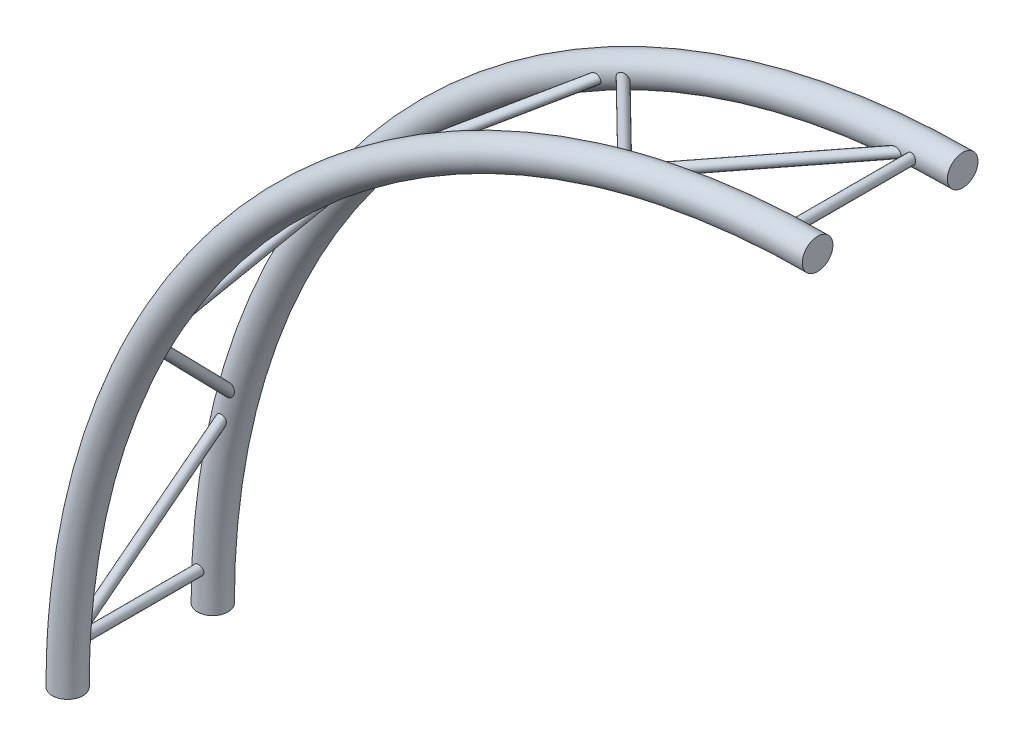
ISO-10303-21;
HEADER;
FILE_DESCRIPTION(('STEP AP214'),'2;1');
FILE_NAME('part.step','',(''),(''),'','','');
FILE_SCHEMA(('AUTOMOTIVE_DESIGN { 1 0 10303 214 1 1 1 1 }'));
ENDSEC;
DATA;
#1=APPLICATION_CONTEXT('core data for automotive mechanical design processes');
#2=APPLICATION_PROTOCOL_DEFINITION('international standard','automotive_design',2000,#1);
#3=PRODUCT_CONTEXT('',#1,'mechanical');
#4=PRODUCT('Part','Part','',(#3));
#5=PRODUCT_RELATED_PRODUCT_CATEGORY('part','',(#4));
#6=PRODUCT_DEFINITION_FORMATION('','',#4);
#7=PRODUCT_DEFINITION_CONTEXT('part definition',#1,'design');
#8=PRODUCT_DEFINITION('design','',#6,#7);
#9=PRODUCT_DEFINITION_SHAPE('','',#8);
#10=(LENGTH_UNIT() NAMED_UNIT(*) SI_UNIT(.MILLI.,.METRE.));
#11=(NAMED_UNIT(*) PLANE_ANGLE_UNIT() SI_UNIT($,.RADIAN.));
#12=(NAMED_UNIT(*) SI_UNIT($,.STERADIAN.) SOLID_ANGLE_UNIT());
#13=UNCERTAINTY_MEASURE_WITH_UNIT(LENGTH_MEASURE(1.E-05),#10,'distance_accuracy_value','');
#14=(GEOMETRIC_REPRESENTATION_CONTEXT(3) GLOBAL_UNCERTAINTY_ASSIGNED_CONTEXT((#13)) GLOBAL_UNIT_ASSIGNED_CONTEXT((#10,
#11,#12)) REPRESENTATION_CONTEXT('',''));
#15=CARTESIAN_POINT('',(0.,0.,0.));
#16=DIRECTION('',(0.,0.,1.));
#17=DIRECTION('',(1.,0.,0.));
#18=AXIS2_PLACEMENT_3D('',#15,#16,#17);
#19=CARTESIAN_POINT('',(0.,0.,-237.));
#20=DIRECTION('',(0.,0.,1.));
#21=DIRECTION('',(1.,0.,0.));
#22=AXIS2_PLACEMENT_3D('',#19,#20,#21);
#23=TOROIDAL_SURFACE('',#22,1225.,25.);
#24=CARTESIAN_POINT('',(4.27706711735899E-12,1225.,-237.));
#25=DIRECTION('',(1.,0.,0.));
#26=DIRECTION('',(0.,0.,1.));
#27=AXIS2_PLACEMENT_3D('',#24,#25,#26);
#28=CIRCLE('',#27,25.);
#29=CARTESIAN_POINT('',(4.36435420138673E-12,1250.,-237.));
#30=VERTEX_POINT('',#29);
#31=EDGE_CURVE('E11',#30,#30,#28,.T.);
#32=CARTESIAN_POINT('',(-1225.,0.,-237.));
#33=DIRECTION('',(0.,1.,0.));
#34=DIRECTION('',(0.,0.,1.));
#35=AXIS2_PLACEMENT_3D('',#32,#33,#34);
#36=CIRCLE('',#35,25.);
#37=CARTESIAN_POINT('',(-1250.,0.,-237.));
#38=VERTEX_POINT('',#37);
#39=EDGE_CURVE('E50',#38,#38,#36,.T.);
#40=CARTESIAN_POINT('',(0.,0.,-237.));
#41=DIRECTION('',(0.,0.,1.));
#42=DIRECTION('',(1.,0.,0.));
#43=AXIS2_PLACEMENT_3D('',#40,#41,#42);
#44=CIRCLE('',#43,1250.);
#45=EDGE_CURVE('',#30,#38,#44,.T.);
#46=ORIENTED_EDGE('',*,*,#31,.F.);
#47=ORIENTED_EDGE('',*,*,#39,.T.);
#48=ORIENTED_EDGE('',*,*,#45,.T.);
#49=ORIENTED_EDGE('',*,*,#45,.F.);
#50=EDGE_LOOP('',(#46,#48,#47,#49));
#51=FACE_BOUND('',#50,.T.);
#52=ADVANCED_FACE('F43',(#51),#23,.T.);
#53=CARTESIAN_POINT('',(4.27706711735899E-12,1225.,-237.));
#54=DIRECTION('',(1.,0.,0.));
#55=DIRECTION('',(0.,0.,1.));
#56=AXIS2_PLACEMENT_3D('',#53,#54,#55);
#57=PLANE('',#56);
#58=ORIENTED_EDGE('',*,*,#31,.T.);
#59=EDGE_LOOP('',(#58));
#60=FACE_BOUND('',#59,.T.);
#61=ADVANCED_FACE('F60',(#60),#57,.T.);
#62=CARTESIAN_POINT('',(-1225.,0.,-237.));
#63=DIRECTION('',(0.,1.,0.));
#64=DIRECTION('',(0.,0.,1.));
#65=AXIS2_PLACEMENT_3D('',#62,#63,#64);
#66=PLANE('',#65);
#67=ORIENTED_EDGE('',*,*,#39,.F.);
#68=EDGE_LOOP('',(#67));
#69=FACE_BOUND('',#68,.T.);
#70=ADVANCED_FACE('F58',(#69),#66,.F.);
#71=CLOSED_SHELL('',(#52,#61,#70));
#72=MANIFOLD_SOLID_BREP('B2',#71);
#73=CARTESIAN_POINT('',(-555.043715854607,1092.04005122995,-237.));
#74=DIRECTION('',(0.616934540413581,0.400145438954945,-0.677698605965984));
#75=DIRECTION('',(0.508459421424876,0.454615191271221,0.731296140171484));
#76=AXIS2_PLACEMENT_3D('',#73,#74,#75);
#77=PLANE('',#76);
#78=CARTESIAN_POINT('',(-555.043715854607,1092.04005122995,-237.));
#79=DIRECTION('',(0.616934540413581,0.400145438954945,-0.677698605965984));
#80=DIRECTION('',(0.508459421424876,0.454615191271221,0.731296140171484));
#81=AXIS2_PLACEMENT_3D('',#78,#79,#80);
#82=CIRCLE('',#81,8.00000000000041);
#83=CARTESIAN_POINT('',(-551.442222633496,1084.95416820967,-237.905267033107));
#84=VERTEX_POINT('',#83);
#85=CARTESIAN_POINT('',(-558.645209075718,1099.12593425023,-236.094732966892));
#86=VERTEX_POINT('',#85);
#87=EDGE_CURVE('E149',#84,#86,#82,.T.);
#88=ORIENTED_EDGE('',*,*,#87,.T.);
#89=DIRECTION('',(0.450186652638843,-0.885735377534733,-0.113158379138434));
#90=VECTOR('',#89,1.);
#91=CARTESIAN_POINT('',(-555.043715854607,1092.04005122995,-237.));
#92=LINE('',#91,#90);
#93=EDGE_CURVE('E41',#86,#84,#92,.T.);
#94=ORIENTED_EDGE('',*,*,#93,.T.);
#95=EDGE_LOOP('',(#88,#94));
#96=FACE_BOUND('',#95,.T.);
#97=ADVANCED_FACE('F89',(#96),#77,.T.);
#98=CARTESIAN_POINT('',(-952.576090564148,770.210225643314,-237.));
#99=DIRECTION('',(0.399767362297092,0.617179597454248,-0.677698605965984));
#100=DIRECTION('',(0.278505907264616,0.62260775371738,0.731296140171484));
#101=AXIS2_PLACEMENT_3D('',#98,#99,#100);
#102=PLANE('',#101);
#103=CARTESIAN_POINT('',(-952.576090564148,770.210225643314,-237.));
#104=DIRECTION('',(0.399767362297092,0.617179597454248,-0.677698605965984));
#105=DIRECTION('',(0.278505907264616,0.62260775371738,0.731296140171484));
#106=AXIS2_PLACEMENT_3D('',#103,#104,#105);
#107=CIRCLE('',#106,8.00000000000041);
#108=CARTESIAN_POINT('',(-946.395142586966,765.212588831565,-237.905267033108));
#109=VERTEX_POINT('',#108);
#110=CARTESIAN_POINT('',(-958.75703854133,775.207862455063,-236.094732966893));
#111=VERTEX_POINT('',#110);
#112=EDGE_CURVE('E154',#109,#111,#107,.T.);
#113=ORIENTED_EDGE('',*,*,#112,.T.);
#114=DIRECTION('',(0.772618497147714,-0.624704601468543,-0.113158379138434));
#115=VECTOR('',#114,1.);
#116=CARTESIAN_POINT('',(-952.576090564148,770.210225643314,-237.));
#117=LINE('',#116,#115);
#118=EDGE_CURVE('E99',#111,#109,#117,.T.);
#119=ORIENTED_EDGE('',*,*,#118,.T.);
#120=EDGE_LOOP('',(#113,#119));
#121=FACE_BOUND('',#120,.T.);
#122=ADVANCED_FACE('F242',(#121),#102,.T.);
#123=CARTESIAN_POINT('',(0.,0.,0.));
#124=DIRECTION('',(0.,0.,1.));
#125=DIRECTION('',(1.,0.,0.));
#126=AXIS2_PLACEMENT_3D('',#123,#124,#125);
#127=TOROIDAL_SURFACE('',#126,1225.,25.);
#128=CARTESIAN_POINT('',(-343.76480950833,1166.44019060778,-23.3397840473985));
#129=CARTESIAN_POINT('',(-343.506834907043,1166.41378429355,-23.3020704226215));
#130=CARTESIAN_POINT('',(-343.248080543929,1166.39309981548,-23.265697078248));
#131=CARTESIAN_POINT('',(-342.729524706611,1166.36262775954,-23.1958994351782));
#132=CARTESIAN_POINT('',(-342.46972310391,1166.35284156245,-23.1624755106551));
#133=CARTESIAN_POINT('',(-341.689180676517,1166.3391971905,-23.0669977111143));
#134=CARTESIAN_POINT('',(-341.167485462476,1166.3510712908,-23.0097648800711));
#135=CARTESIAN_POINT('',(-340.124319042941,1166.41513177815,-22.9102667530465));
#136=CARTESIAN_POINT('',(-339.602849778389,1166.46738771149,-22.8680274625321));
#137=CARTESIAN_POINT('',(-338.56457584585,1166.61240083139,-22.8009257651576));
#138=CARTESIAN_POINT('',(-338.047768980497,1166.70513779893,-22.7760546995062));
#139=CARTESIAN_POINT('',(-337.159242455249,1166.90248258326,-22.749999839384));
#140=CARTESIAN_POINT('',(-336.78547979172,1166.99737906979,-22.7442763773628));
#141=CARTESIAN_POINT('',(-336.044761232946,1167.21104784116,-22.7443482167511));
#142=CARTESIAN_POINT('',(-335.677805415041,1167.3298203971,-22.7501436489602));
#143=CARTESIAN_POINT('',(-334.954274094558,1167.59239564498,-22.7740513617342));
#144=CARTESIAN_POINT('',(-334.59767665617,1167.73614013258,-22.7921352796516));
#145=CARTESIAN_POINT('',(-333.897466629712,1168.05054069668,-22.8412196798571));
#146=CARTESIAN_POINT('',(-333.553849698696,1168.22118767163,-22.8722157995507));
#147=CARTESIAN_POINT('',(-332.974452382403,1168.54116908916,-22.9372117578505));
#148=CARTESIAN_POINT('',(-332.734617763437,1168.68380685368,-22.9681379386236));
#149=CARTESIAN_POINT('',(-332.266212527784,1168.98499538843,-23.0369022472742));
#150=CARTESIAN_POINT('',(-332.037639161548,1169.1435422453,-23.074738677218));
#151=CARTESIAN_POINT('',(-331.59420274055,1169.47695426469,-23.1569913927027));
#152=CARTESIAN_POINT('',(-331.379329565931,1169.65180714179,-23.2014027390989));
#153=CARTESIAN_POINT('',(-330.965723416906,1170.01820183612,-23.2962442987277));
#154=CARTESIAN_POINT('',(-330.766987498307,1170.2097405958,-23.3466734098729));
#155=CARTESIAN_POINT('',(-330.422915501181,1170.57304353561,-23.4429952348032));
#156=CARTESIAN_POINT('',(-330.274442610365,1170.74206471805,-23.4880438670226));
#157=CARTESIAN_POINT('',(-329.991784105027,1171.09093304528,-23.5808853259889));
#158=CARTESIAN_POINT('',(-329.85759547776,1171.27077789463,-23.6286775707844));
#159=CARTESIAN_POINT('',(-329.605088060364,1171.64079231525,-23.7261909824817));
#160=CARTESIAN_POINT('',(-329.4867679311,1171.83096101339,-23.7759119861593));
#161=CARTESIAN_POINT('',(-329.267517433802,1172.22085719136,-23.8763318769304));
#162=CARTESIAN_POINT('',(-329.166587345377,1172.42058482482,-23.9270307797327));
#163=CARTESIAN_POINT('',(-328.98293170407,1172.82986046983,-24.0286750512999));
#164=CARTESIAN_POINT('',(-328.900329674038,1173.03946421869,-24.0796198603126));
#165=CARTESIAN_POINT('',(-328.755424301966,1173.46588791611,-24.1802761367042));
#166=CARTESIAN_POINT('',(-328.69312143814,1173.68270803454,-24.2299875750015));
#167=CARTESIAN_POINT('',(-328.589835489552,1174.12183944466,-24.3270049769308));
#168=CARTESIAN_POINT('',(-328.548846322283,1174.34414915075,-24.3743116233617));
#169=CARTESIAN_POINT('',(-328.488887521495,1174.79241973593,-24.4654267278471));
#170=CARTESIAN_POINT('',(-328.469915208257,1175.01838016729,-24.5092356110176));
#171=CARTESIAN_POINT('',(-328.455280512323,1175.44604151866,-24.5876290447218));
#172=CARTESIAN_POINT('',(-328.457209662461,1175.64757474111,-24.6226959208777));
#173=CARTESIAN_POINT('',(-328.478761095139,1176.05036747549,-24.6887247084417));
#174=CARTESIAN_POINT('',(-328.498382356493,1176.25162700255,-24.7196868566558));
#175=CARTESIAN_POINT('',(-328.555212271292,1176.65223545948,-24.7770344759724));
#176=CARTESIAN_POINT('',(-328.592414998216,1176.8515850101,-24.8034214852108));
#177=CARTESIAN_POINT('',(-328.684130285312,1177.24686002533,-24.85130930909));
#178=CARTESIAN_POINT('',(-328.738642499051,1177.44278555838,-24.872810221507));
#179=CARTESIAN_POINT('',(-328.861168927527,1177.81932376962,-24.9097412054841));
#180=CARTESIAN_POINT('',(-328.928308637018,1178.0001960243,-24.9254337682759));
#181=CARTESIAN_POINT('',(-329.077183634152,1178.35617483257,-24.9522643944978));
#182=CARTESIAN_POINT('',(-329.158918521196,1178.53128154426,-24.9634025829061));
#183=CARTESIAN_POINT('',(-329.336337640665,1178.87448044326,-24.9812207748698));
#184=CARTESIAN_POINT('',(-329.432019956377,1179.04257359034,-24.9879013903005));
#185=CARTESIAN_POINT('',(-329.63659755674,1179.37063639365,-24.9970165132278));
#186=CARTESIAN_POINT('',(-329.74549306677,1179.53060591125,-24.9994509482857));
#187=CARTESIAN_POINT('',(-329.976296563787,1179.84226637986,-25.0003854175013));
#188=CARTESIAN_POINT('',(-330.098274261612,1179.99390573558,-24.9988632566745));
#189=CARTESIAN_POINT('',(-330.353783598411,1180.28701931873,-24.9922381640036));
#190=CARTESIAN_POINT('',(-330.487315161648,1180.42849361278,-24.9871352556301));
#191=CARTESIAN_POINT('',(-330.764916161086,1180.70052804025,-24.9738161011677));
#192=CARTESIAN_POINT('',(-330.908985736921,1180.83108802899,-24.9655998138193));
#193=CARTESIAN_POINT('',(-331.206603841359,1181.08071750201,-24.9465661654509));
#194=CARTESIAN_POINT('',(-331.3601532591,1181.19978590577,-24.9357485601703));
#195=CARTESIAN_POINT('',(-331.684777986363,1181.43257043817,-24.9113613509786));
#196=CARTESIAN_POINT('',(-331.856353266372,1181.54557620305,-24.8976685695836));
#197=CARTESIAN_POINT('',(-332.20757858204,1181.75797486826,-24.8686092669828));
#198=CARTESIAN_POINT('',(-332.387228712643,1181.85736760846,-24.8532427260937));
#199=CARTESIAN_POINT('',(-332.753399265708,1182.04250232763,-24.8214448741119));
#200=CARTESIAN_POINT('',(-332.939921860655,1182.12823994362,-24.8050132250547));
#201=CARTESIAN_POINT('',(-333.318587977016,1182.286150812,-24.7716582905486));
#202=CARTESIAN_POINT('',(-333.510732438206,1182.35832178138,-24.7547349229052));
#203=CARTESIAN_POINT('',(-333.973914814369,1182.51443219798,-24.7144402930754));
#204=CARTESIAN_POINT('',(-334.24701111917,1182.59230992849,-24.6910793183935));
#205=CARTESIAN_POINT('',(-334.799100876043,1182.72370968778,-24.6455513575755));
#206=CARTESIAN_POINT('',(-335.078096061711,1182.77722444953,-24.6233847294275));
#207=CARTESIAN_POINT('',(-335.640035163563,1182.86133739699,-24.5811012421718));
#208=CARTESIAN_POINT('',(-335.922984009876,1182.89190376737,-24.560987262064));
#209=CARTESIAN_POINT('',(-336.490515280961,1182.93154748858,-24.5234793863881));
#210=CARTESIAN_POINT('',(-336.77509777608,1182.94062390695,-24.5060856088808));
#211=CARTESIAN_POINT('',(-337.44946303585,1182.93854390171,-24.4686011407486));
#212=CARTESIAN_POINT('',(-337.839306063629,1182.91868323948,-24.4498845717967));
#213=CARTESIAN_POINT('',(-338.616097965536,1182.84551236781,-24.4188916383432));
#214=CARTESIAN_POINT('',(-339.003045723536,1182.79218986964,-24.4066176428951));
#215=CARTESIAN_POINT('',(-339.772400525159,1182.65541420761,-24.3885657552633));
#216=CARTESIAN_POINT('',(-340.154798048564,1182.57190651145,-24.3827996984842));
#217=CARTESIAN_POINT('',(-340.91258428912,1182.37770716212,-24.3775574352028));
#218=CARTESIAN_POINT('',(-341.287973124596,1182.26701596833,-24.378081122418));
#219=CARTESIAN_POINT('',(-342.148558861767,1181.98164480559,-24.3860656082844));
#220=CARTESIAN_POINT('',(-342.630712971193,1181.79780998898,-24.3956794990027));
#221=CARTESIAN_POINT('',(-343.578057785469,1181.39094232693,-24.4236777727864));
#222=CARTESIAN_POINT('',(-344.043241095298,1181.16789263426,-24.442065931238));
#223=CARTESIAN_POINT('',(-344.953737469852,1180.68509001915,-24.4859503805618));
#224=CARTESIAN_POINT('',(-345.399052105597,1180.4253400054,-24.5114461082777));
#225=CARTESIAN_POINT('',(-346.266388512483,1179.87025548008,-24.5676530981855));
#226=CARTESIAN_POINT('',(-346.688421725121,1179.57493867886,-24.5983617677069));
#227=CARTESIAN_POINT('',(-347.363461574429,1179.05673979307,-24.6516419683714));
#228=CARTESIAN_POINT('',(-347.624456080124,1178.8441185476,-24.673355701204));
#229=CARTESIAN_POINT('',(-348.132745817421,1178.4030328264,-24.7173410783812));
#230=CARTESIAN_POINT('',(-348.380040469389,1178.17456768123,-24.739612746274));
#231=CARTESIAN_POINT('',(-348.857998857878,1177.70166910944,-24.7838084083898));
#232=CARTESIAN_POINT('',(-349.088693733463,1177.45726731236,-24.8057329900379));
#233=CARTESIAN_POINT('',(-349.530616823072,1176.95136305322,-24.8482260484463));
#234=CARTESIAN_POINT('',(-349.741854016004,1176.68986857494,-24.8687951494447));
#235=CARTESIAN_POINT('',(-350.063912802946,1176.25259679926,-24.8998752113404));
#236=CARTESIAN_POINT('',(-350.182200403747,1176.08236123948,-24.9112205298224));
#237=CARTESIAN_POINT('',(-350.408212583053,1175.73485645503,-24.932501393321));
#238=CARTESIAN_POINT('',(-350.515935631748,1175.55758621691,-24.9424367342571));
#239=CARTESIAN_POINT('',(-350.718945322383,1175.19615020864,-24.9604330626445));
#240=CARTESIAN_POINT('',(-350.814244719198,1175.01199176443,-24.9684959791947));
#241=CARTESIAN_POINT('',(-350.990384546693,1174.6368165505,-24.9822289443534));
#242=CARTESIAN_POINT('',(-351.071224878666,1174.44579973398,-24.987898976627));
#243=CARTESIAN_POINT('',(-351.250128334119,1173.9653234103,-24.9982032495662));
#244=CARTESIAN_POINT('',(-351.338321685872,1173.67193920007,-25.0010865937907));
#245=CARTESIAN_POINT('',(-351.435719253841,1173.22459422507,-24.9988961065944));
#246=CARTESIAN_POINT('',(-351.462367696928,1173.07430123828,-24.9970811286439));
#247=CARTESIAN_POINT('',(-351.502834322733,1172.77206806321,-24.9910145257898));
#248=CARTESIAN_POINT('',(-351.516660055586,1172.62012889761,-24.9867643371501));
#249=CARTESIAN_POINT('',(-351.529185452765,1172.34186788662,-24.9765565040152));
#250=CARTESIAN_POINT('',(-351.530074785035,1172.21562714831,-24.9710173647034));
#251=CARTESIAN_POINT('',(-351.521770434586,1171.96361943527,-24.9580149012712));
#252=CARTESIAN_POINT('',(-351.512581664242,1171.83785225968,-24.9505525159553));
#253=CARTESIAN_POINT('',(-351.483789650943,1171.58768982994,-24.9336523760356));
#254=CARTESIAN_POINT('',(-351.46419034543,1171.46329407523,-24.9242153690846));
#255=CARTESIAN_POINT('',(-351.414468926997,1171.21678422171,-24.9033664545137));
#256=CARTESIAN_POINT('',(-351.384346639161,1171.09467016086,-24.8919545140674));
#257=CARTESIAN_POINT('',(-351.313689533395,1170.85354226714,-24.8672040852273));
#258=CARTESIAN_POINT('',(-351.273143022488,1170.73453208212,-24.8538634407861));
#259=CARTESIAN_POINT('',(-351.182064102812,1170.50062810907,-24.8253849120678));
#260=CARTESIAN_POINT('',(-351.131531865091,1170.38573425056,-24.8102470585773));
#261=CARTESIAN_POINT('',(-351.02107966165,1170.16072648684,-24.778330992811));
#262=CARTESIAN_POINT('',(-350.961155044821,1170.05061498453,-24.7615519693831));
#263=CARTESIAN_POINT('',(-350.832713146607,1169.83575449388,-24.726554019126));
#264=CARTESIAN_POINT('',(-350.764193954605,1169.73100670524,-24.7083347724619));
#265=CARTESIAN_POINT('',(-350.600611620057,1169.50075174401,-24.6657712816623));
#266=CARTESIAN_POINT('',(-350.503276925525,1169.37692057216,-24.6410654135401));
#267=CARTESIAN_POINT('',(-350.298127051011,1169.13865792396,-24.5901260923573));
#268=CARTESIAN_POINT('',(-350.190309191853,1169.02422886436,-24.5638922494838));
#269=CARTESIAN_POINT('',(-349.853274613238,1168.69463127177,-24.483399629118));
#270=CARTESIAN_POINT('',(-349.610674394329,1168.49342069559,-24.4274009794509));
#271=CARTESIAN_POINT('',(-349.160596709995,1168.1685158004,-24.3266978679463));
#272=CARTESIAN_POINT('',(-348.958007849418,1168.03766345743,-24.2823833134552));
#273=CARTESIAN_POINT('',(-348.541973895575,1167.79439557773,-24.1933854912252));
#274=CARTESIAN_POINT('',(-348.328522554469,1167.68199081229,-24.1487020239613));
#275=CARTESIAN_POINT('',(-347.893353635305,1167.47381147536,-24.0595971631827));
#276=CARTESIAN_POINT('',(-347.671625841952,1167.37805834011,-24.0151761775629));
#277=CARTESIAN_POINT('',(-347.222154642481,1167.20169971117,-23.9271547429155));
#278=CARTESIAN_POINT('',(-346.994412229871,1167.1210917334,-23.8835541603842));
#279=CARTESIAN_POINT('',(-346.521634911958,1166.96951582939,-23.7951878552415));
#280=CARTESIAN_POINT('',(-346.276339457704,1166.89932578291,-23.7504906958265));
#281=CARTESIAN_POINT('',(-345.781914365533,1166.77282904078,-23.6628243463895));
#282=CARTESIAN_POINT('',(-345.532784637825,1166.71652267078,-23.6198551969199));
#283=CARTESIAN_POINT('',(-345.031720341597,1166.61668712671,-23.5359821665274));
#284=CARTESIAN_POINT('',(-344.779786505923,1166.57315469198,-23.4950777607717));
#285=CARTESIAN_POINT('',(-344.273758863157,1166.49794892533,-23.4156072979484));
#286=CARTESIAN_POINT('',(-344.019664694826,1166.4662776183,-23.3770416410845));
#287=CARTESIAN_POINT('',(-343.76480950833,1166.44019060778,-23.3397840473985));
#288=B_SPLINE_CURVE_WITH_KNOTS('',3,(#128,#129,#130,#131,#132,#133,#134,#135,#136,#137,#138,
#139,#140,#141,#142,#143,#144,#145,#146,#147,#148,#149,#150,#151,#152,#153,#154,#155,#156,#157,
#158,#159,#160,#161,#162,#163,#164,#165,#166,#167,#168,#169,#170,#171,#172,#173,#174,#175,#176,
#177,#178,#179,#180,#181,#182,#183,#184,#185,#186,#187,#188,#189,#190,#191,#192,#193,#194,#195,
#196,#197,#198,#199,#200,#201,#202,#203,#204,#205,#206,#207,#208,#209,#210,#211,#212,#213,#214,
#215,#216,#217,#218,#219,#220,#221,#222,#223,#224,#225,#226,#227,#228,#229,#230,#231,#232,#233,
#234,#235,#236,#237,#238,#239,#240,#241,#242,#243,#244,#245,#246,#247,#248,#249,#250,#251,#252,
#253,#254,#255,#256,#257,#258,#259,#260,#261,#262,#263,#264,#265,#266,#267,#268,#269,#270,#271,
#272,#273,#274,#275,#276,#277,#278,#279,#280,#281,#282,#283,#284,#285,#286,#287),.UNSPECIFIED.,
.T.,.F.,(4,2,2,2,2,2,2,2,2,2,2,2,2,2,2,2,2,2,2,2,2,2,2,2,2,2,2,2,2,2,2,2,2,2,2,2,2,2,2,2,2,2,2,
2,2,2,2,2,2,2,2,2,2,2,2,2,2,2,2,2,2,2,2,2,2,2,2,2,2,2,2,2,2,2,2,2,2,2,2,4),(0.,
0.786080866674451,1.5722613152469,3.14517872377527,4.72081109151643,6.29565737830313,
7.45180075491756,8.60795725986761,9.76145430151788,10.9145619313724,11.7561531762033,
12.5975379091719,13.4382937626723,14.2788958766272,14.9665514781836,15.6540617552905,
16.3415139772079,17.0289772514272,17.7209417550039,18.4129225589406,19.1047057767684,
19.7964047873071,20.4093339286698,21.0222276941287,21.6349150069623,22.2475900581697,
22.8276099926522,23.4076140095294,23.9875383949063,24.5674726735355,25.1506671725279,
25.7338578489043,26.317056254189,26.9003094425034,27.5173726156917,28.1344430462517,
28.751710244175,29.3690812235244,30.2226547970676,31.07648280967,31.9314923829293,
32.7865390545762,33.9571762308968,35.1282435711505,36.30143721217,37.4746110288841,
39.0208626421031,40.5677801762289,42.1145751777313,43.660603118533,44.6720676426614,
45.6835749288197,46.6931324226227,47.702221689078,48.3247148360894,48.9472979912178,
49.5692368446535,50.1911799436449,51.1065643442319,51.5640577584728,52.0212816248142,
52.3999950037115,52.778523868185,53.1569096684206,53.5353017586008,53.9141201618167,
54.2929320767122,54.6719321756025,55.0510166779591,55.5285786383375,56.0062629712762,
56.9626303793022,57.6973755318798,58.4325481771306,59.1686603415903,59.9046516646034,
60.681274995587,61.4579165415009,62.234359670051,63.0109352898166),.UNSPECIFIED.);
#289=CARTESIAN_POINT('',(-343.76480950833,1166.44019060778,-23.3397840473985));
#290=VERTEX_POINT('',#289);
#291=EDGE_CURVE('E151',#290,#290,#288,.T.);
#292=ORIENTED_EDGE('',*,*,#291,.T.);
#293=EDGE_LOOP('',(#292));
#294=FACE_BOUND('',#293,.T.);
#295=CARTESIAN_POINT('',(-796.24926772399,923.886681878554,-24.4238348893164));
#296=CARTESIAN_POINT('',(-795.985876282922,923.819878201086,-24.3752119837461));
#297=CARTESIAN_POINT('',(-795.718700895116,923.769508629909,-24.3255919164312));
#298=CARTESIAN_POINT('',(-795.1805161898,923.696822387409,-24.22560655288));
#299=CARTESIAN_POINT('',(-794.909502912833,923.67453720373,-24.1752404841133));
#300=CARTESIAN_POINT('',(-794.365369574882,923.653985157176,-24.0745684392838));
#301=CARTESIAN_POINT('',(-794.092245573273,923.655830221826,-24.0242638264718));
#302=CARTESIAN_POINT('',(-793.546908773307,923.680397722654,-23.9246995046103));
#303=CARTESIAN_POINT('',(-793.274695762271,923.703114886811,-23.8754395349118));
#304=CARTESIAN_POINT('',(-792.587176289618,923.783667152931,-23.752616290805));
#305=CARTESIAN_POINT('',(-792.173109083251,923.853779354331,-23.680127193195));
#306=CARTESIAN_POINT('',(-791.351603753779,924.02946426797,-23.5404756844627));
#307=CARTESIAN_POINT('',(-790.944170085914,924.135059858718,-23.4733167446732));
#308=CARTESIAN_POINT('',(-790.137511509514,924.376824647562,-23.3456464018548));
#309=CARTESIAN_POINT('',(-789.738285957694,924.512991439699,-23.2851344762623));
#310=CARTESIAN_POINT('',(-788.949211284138,924.812564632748,-23.171935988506));
#311=CARTESIAN_POINT('',(-788.559360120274,924.975965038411,-23.1192477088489));
#312=CARTESIAN_POINT('',(-787.765689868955,925.339012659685,-23.0197664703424));
#313=CARTESIAN_POINT('',(-787.362547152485,925.540298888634,-22.9735572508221));
#314=CARTESIAN_POINT('',(-786.56955215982,925.969742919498,-22.892649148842));
#315=CARTESIAN_POINT('',(-786.179702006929,926.197904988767,-22.8579520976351));
#316=CARTESIAN_POINT('',(-785.415805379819,926.680137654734,-22.8015587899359));
#317=CARTESIAN_POINT('',(-785.041746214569,926.934186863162,-22.7798519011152));
#318=CARTESIAN_POINT('',(-784.312022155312,927.468157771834,-22.7508995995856));
#319=CARTESIAN_POINT('',(-783.956352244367,927.748072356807,-22.743650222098));
#320=CARTESIAN_POINT('',(-783.345321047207,928.267628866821,-22.7449085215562));
#321=CARTESIAN_POINT('',(-783.085488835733,928.502029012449,-22.750218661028));
#322=CARTESIAN_POINT('',(-782.581389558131,928.986672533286,-22.7709758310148));
#323=CARTESIAN_POINT('',(-782.337122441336,929.236915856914,-22.7864228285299));
#324=CARTESIAN_POINT('',(-781.867242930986,929.753085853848,-22.827918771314));
#325=CARTESIAN_POINT('',(-781.641610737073,930.018995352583,-22.8539562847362));
#326=CARTESIAN_POINT('',(-781.212139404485,930.566669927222,-22.9168933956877));
#327=CARTESIAN_POINT('',(-781.008294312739,930.848430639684,-22.9537900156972));
#328=CARTESIAN_POINT('',(-780.670906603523,931.359893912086,-23.0284709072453));
#329=CARTESIAN_POINT('',(-780.53205249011,931.586421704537,-23.0640434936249));
#330=CARTESIAN_POINT('',(-780.27152656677,932.048145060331,-23.1412495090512));
#331=CARTESIAN_POINT('',(-780.149850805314,932.283338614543,-23.1828815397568));
#332=CARTESIAN_POINT('',(-779.925907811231,932.761550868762,-23.2716997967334));
#333=CARTESIAN_POINT('',(-779.823623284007,933.00456236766,-23.3188810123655));
#334=CARTESIAN_POINT('',(-779.640550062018,933.497608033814,-23.4180917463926));
#335=CARTESIAN_POINT('',(-779.559757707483,933.7476409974,-23.4701204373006));
#336=CARTESIAN_POINT('',(-779.433617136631,934.210098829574,-23.5687734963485));
#337=CARTESIAN_POINT('',(-779.384570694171,934.421645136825,-23.6148010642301));
#338=CARTESIAN_POINT('',(-779.303870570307,934.847601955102,-23.7087463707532));
#339=CARTESIAN_POINT('',(-779.272213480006,935.062011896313,-23.7566637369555));
#340=CARTESIAN_POINT('',(-779.227285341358,935.49252500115,-23.853542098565));
#341=CARTESIAN_POINT('',(-779.214013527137,935.708628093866,-23.9025030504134));
#342=CARTESIAN_POINT('',(-779.20665876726,936.14116231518,-24.0005220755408));
#343=CARTESIAN_POINT('',(-779.212576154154,936.357593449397,-24.0495801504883));
#344=CARTESIAN_POINT('',(-779.244250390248,936.790416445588,-24.1470468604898));
#345=CARTESIAN_POINT('',(-779.270115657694,937.006801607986,-24.1954504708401));
#346=CARTESIAN_POINT('',(-779.342105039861,937.436634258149,-24.2902859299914));
#347=CARTESIAN_POINT('',(-779.388229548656,937.650081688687,-24.3367177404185));
#348=CARTESIAN_POINT('',(-779.500707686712,938.072187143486,-24.4265845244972));
#349=CARTESIAN_POINT('',(-779.567057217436,938.280846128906,-24.4700201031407));
#350=CARTESIAN_POINT('',(-779.719661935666,938.691554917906,-24.5529702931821));
#351=CARTESIAN_POINT('',(-779.805915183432,938.893605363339,-24.5924852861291));
#352=CARTESIAN_POINT('',(-779.988283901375,939.26982377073,-24.6631478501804));
#353=CARTESIAN_POINT('',(-780.082602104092,939.444782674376,-24.6947359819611));
#354=CARTESIAN_POINT('',(-780.286269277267,939.786485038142,-24.7536026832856));
#355=CARTESIAN_POINT('',(-780.395617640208,939.953228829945,-24.7808814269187));
#356=CARTESIAN_POINT('',(-780.628497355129,940.277161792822,-24.8307753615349));
#357=CARTESIAN_POINT('',(-780.752024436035,940.43435381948,-24.8533919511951));
#358=CARTESIAN_POINT('',(-781.012331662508,940.738023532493,-24.8937638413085));
#359=CARTESIAN_POINT('',(-781.14911165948,940.884501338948,-24.9115191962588));
#360=CARTESIAN_POINT('',(-781.429059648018,941.15993683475,-24.9414846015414));
#361=CARTESIAN_POINT('',(-781.571746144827,941.289363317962,-24.9538897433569));
#362=CARTESIAN_POINT('',(-781.86727234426,941.536433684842,-24.9742276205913));
#363=CARTESIAN_POINT('',(-782.020111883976,941.654077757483,-24.9821604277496));
#364=CARTESIAN_POINT('',(-782.334808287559,941.876805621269,-24.9937295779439));
#365=CARTESIAN_POINT('',(-782.496664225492,941.981890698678,-24.9973663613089));
#366=CARTESIAN_POINT('',(-782.82823925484,942.178887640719,-25.0006245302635));
#367=CARTESIAN_POINT('',(-782.997958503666,942.270799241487,-25.000245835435));
#368=CARTESIAN_POINT('',(-783.346555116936,942.442197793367,-24.9958086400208));
#369=CARTESIAN_POINT('',(-783.525529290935,942.521486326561,-24.9916971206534));
#370=CARTESIAN_POINT('',(-783.889066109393,942.665684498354,-24.9801780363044));
#371=CARTESIAN_POINT('',(-784.073628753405,942.7305941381,-24.9727704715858));
#372=CARTESIAN_POINT('',(-784.447082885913,942.845880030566,-24.9551712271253));
#373=CARTESIAN_POINT('',(-784.635974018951,942.896257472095,-24.9449797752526));
#374=CARTESIAN_POINT('',(-785.016961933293,942.982527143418,-24.9223499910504));
#375=CARTESIAN_POINT('',(-785.209059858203,943.018414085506,-24.9099108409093));
#376=CARTESIAN_POINT('',(-785.608474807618,943.077833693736,-24.8824284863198));
#377=CARTESIAN_POINT('',(-785.815934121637,943.100353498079,-24.8672653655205));
#378=CARTESIAN_POINT('',(-786.23193344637,943.129473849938,-24.8356531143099));
#379=CARTESIAN_POINT('',(-786.440473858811,943.136067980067,-24.8192034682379));
#380=CARTESIAN_POINT('',(-786.85742893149,943.133907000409,-24.7856362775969));
#381=CARTESIAN_POINT('',(-787.065843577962,943.125150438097,-24.7685186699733));
#382=CARTESIAN_POINT('',(-787.481544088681,943.093003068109,-24.73417012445));
#383=CARTESIAN_POINT('',(-787.688829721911,943.069609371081,-24.7169391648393));
#384=CARTESIAN_POINT('',(-788.187903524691,942.996268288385,-24.6757092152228));
#385=CARTESIAN_POINT('',(-788.478692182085,942.939300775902,-24.6519007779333));
#386=CARTESIAN_POINT('',(-789.05427147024,942.799949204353,-24.6061811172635));
#387=CARTESIAN_POINT('',(-789.339060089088,942.717556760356,-24.5842705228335));
#388=CARTESIAN_POINT('',(-789.901630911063,942.529711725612,-24.5431422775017));
#389=CARTESIAN_POINT('',(-790.179400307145,942.424219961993,-24.5239292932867));
#390=CARTESIAN_POINT('',(-790.726393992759,942.192688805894,-24.4887971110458));
#391=CARTESIAN_POINT('',(-790.99561802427,942.066648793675,-24.4728780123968));
#392=CARTESIAN_POINT('',(-791.626308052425,941.744418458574,-24.4392622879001));
#393=CARTESIAN_POINT('',(-791.983596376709,941.539852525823,-24.4232213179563));
#394=CARTESIAN_POINT('',(-792.679576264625,941.100803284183,-24.3983981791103));
#395=CARTESIAN_POINT('',(-793.018260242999,940.866307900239,-24.3896189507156));
#396=CARTESIAN_POINT('',(-793.676755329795,940.371432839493,-24.3791574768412));
#397=CARTESIAN_POINT('',(-793.996546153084,940.111026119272,-24.3774827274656));
#398=CARTESIAN_POINT('',(-794.616489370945,939.567992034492,-24.3807927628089));
#399=CARTESIAN_POINT('',(-794.9166439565,939.285367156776,-24.3857768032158));
#400=CARTESIAN_POINT('',(-795.506749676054,938.690733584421,-24.4020205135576));
#401=CARTESIAN_POINT('',(-795.796021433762,938.378057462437,-24.4134849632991));
#402=CARTESIAN_POINT('',(-796.352698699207,937.734022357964,-24.4419732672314));
#403=CARTESIAN_POINT('',(-796.620102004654,937.402661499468,-24.4589976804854));
#404=CARTESIAN_POINT('',(-797.131976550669,936.7230268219,-24.4976305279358));
#405=CARTESIAN_POINT('',(-797.376451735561,936.374755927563,-24.5192381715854));
#406=CARTESIAN_POINT('',(-797.840925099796,935.662528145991,-24.5659558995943));
#407=CARTESIAN_POINT('',(-798.060927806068,935.298574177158,-24.5910653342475));
#408=CARTESIAN_POINT('',(-798.435316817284,934.625549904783,-24.6386320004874));
#409=CARTESIAN_POINT('',(-798.594270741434,934.318988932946,-24.660703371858));
#410=CARTESIAN_POINT('',(-798.892628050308,933.696452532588,-24.705586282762));
#411=CARTESIAN_POINT('',(-799.032029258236,933.380476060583,-24.7283979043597));
#412=CARTESIAN_POINT('',(-799.288545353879,932.740043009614,-24.7738265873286));
#413=CARTESIAN_POINT('',(-799.405690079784,932.415598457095,-24.7964438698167));
#414=CARTESIAN_POINT('',(-799.614441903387,931.75853621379,-24.8404129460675));
#415=CARTESIAN_POINT('',(-799.706061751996,931.425922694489,-24.8617653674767));
#416=CARTESIAN_POINT('',(-799.828923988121,930.885949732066,-24.8939245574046));
#417=CARTESIAN_POINT('',(-799.86973850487,930.680802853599,-24.90557490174));
#418=CARTESIAN_POINT('',(-799.938857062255,930.268360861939,-24.9275047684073));
#419=CARTESIAN_POINT('',(-799.967164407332,930.061066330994,-24.9377846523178));
#420=CARTESIAN_POINT('',(-800.00964495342,929.645057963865,-24.9565170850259));
#421=CARTESIAN_POINT('',(-800.0238289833,929.436345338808,-24.9649710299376));
#422=CARTESIAN_POINT('',(-800.03620870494,929.018445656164,-24.9795255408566));
#423=CARTESIAN_POINT('',(-800.034409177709,928.809258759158,-24.9856268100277));
#424=CARTESIAN_POINT('',(-800.00740554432,928.291513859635,-24.997076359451));
#425=CARTESIAN_POINT('',(-799.971420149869,927.983275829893,-25.0006691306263));
#426=CARTESIAN_POINT('',(-799.882138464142,927.528148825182,-24.999510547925));
#427=CARTESIAN_POINT('',(-799.846504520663,927.377673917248,-24.9980340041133));
#428=CARTESIAN_POINT('',(-799.762637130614,927.080354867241,-24.9926195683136));
#429=CARTESIAN_POINT('',(-799.714411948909,926.933508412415,-24.9886832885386));
#430=CARTESIAN_POINT('',(-799.614578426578,926.670840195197,-24.979053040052));
#431=CARTESIAN_POINT('',(-799.56512940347,926.5541790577,-24.973801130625));
#432=CARTESIAN_POINT('',(-799.457166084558,926.325282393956,-24.9613722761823));
#433=CARTESIAN_POINT('',(-799.398656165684,926.213044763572,-24.9541962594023));
#434=CARTESIAN_POINT('',(-799.272602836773,925.993966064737,-24.9378597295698));
#435=CARTESIAN_POINT('',(-799.205063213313,925.887122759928,-24.928700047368));
#436=CARTESIAN_POINT('',(-799.061187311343,925.679723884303,-24.908387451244));
#437=CARTESIAN_POINT('',(-798.984850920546,925.579168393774,-24.8972345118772));
#438=CARTESIAN_POINT('',(-798.823755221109,925.385036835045,-24.8729704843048));
#439=CARTESIAN_POINT('',(-798.738983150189,925.29147172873,-24.8598564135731));
#440=CARTESIAN_POINT('',(-798.561825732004,925.112158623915,-24.8317956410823));
#441=CARTESIAN_POINT('',(-798.469440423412,925.026410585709,-24.8168489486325));
#442=CARTESIAN_POINT('',(-798.277883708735,924.863144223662,-24.7852785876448));
#443=CARTESIAN_POINT('',(-798.178709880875,924.785628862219,-24.7686543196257));
#444=CARTESIAN_POINT('',(-797.97450644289,924.63903823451,-24.733921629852));
#445=CARTESIAN_POINT('',(-797.869474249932,924.569966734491,-24.7158125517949));
#446=CARTESIAN_POINT('',(-797.644710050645,924.434362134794,-24.6766138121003));
#447=CARTESIAN_POINT('',(-797.524511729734,924.368637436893,-24.6554029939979));
#448=CARTESIAN_POINT('',(-797.27944217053,924.246995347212,-24.6117447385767));
#449=CARTESIAN_POINT('',(-797.154568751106,924.191082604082,-24.5892967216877));
#450=CARTESIAN_POINT('',(-796.774491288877,924.037436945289,-24.5204916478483));
#451=CARTESIAN_POINT('',(-796.513787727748,923.953771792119,-24.4726661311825));
#452=CARTESIAN_POINT('',(-796.24926772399,923.886681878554,-24.4238348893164));
#453=B_SPLINE_CURVE_WITH_KNOTS('',3,(#295,#296,#297,#298,#299,#300,#301,#302,#303,#304,#305,
#306,#307,#308,#309,#310,#311,#312,#313,#314,#315,#316,#317,#318,#319,#320,#321,#322,#323,#324,
#325,#326,#327,#328,#329,#330,#331,#332,#333,#334,#335,#336,#337,#338,#339,#340,#341,#342,#343,
#344,#345,#346,#347,#348,#349,#350,#351,#352,#353,#354,#355,#356,#357,#358,#359,#360,#361,#362,
#363,#364,#365,#366,#367,#368,#369,#370,#371,#372,#373,#374,#375,#376,#377,#378,#379,#380,#381,
#382,#383,#384,#385,#386,#387,#388,#389,#390,#391,#392,#393,#394,#395,#396,#397,#398,#399,#400,
#401,#402,#403,#404,#405,#406,#407,#408,#409,#410,#411,#412,#413,#414,#415,#416,#417,#418,#419,
#420,#421,#422,#423,#424,#425,#426,#427,#428,#429,#430,#431,#432,#433,#434,#435,#436,#437,#438,
#439,#440,#441,#442,#443,#444,#445,#446,#447,#448,#449,#450,#451,#452),.UNSPECIFIED.,.T.,.F.,(4,
2,2,2,2,2,2,2,2,2,2,2,2,2,2,2,2,2,2,2,2,2,2,2,2,2,2,2,2,2,2,2,2,2,2,2,2,2,2,2,2,2,2,2,2,2,2,2,2,
2,2,2,2,2,2,2,2,2,2,2,2,2,2,2,2,2,2,2,2,2,2,2,2,2,2,2,2,2,4),(0.,0.827490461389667,
1.655907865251,2.48816921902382,3.32022041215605,4.59674460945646,5.87409345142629,
7.15134180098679,8.4283093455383,9.78605296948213,11.1440124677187,12.5008589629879,
13.8573333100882,14.9065146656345,15.9556926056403,17.0037410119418,18.0515023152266,
18.8550320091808,19.6583765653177,20.461001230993,21.2634891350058,21.9287795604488,
22.5939395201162,23.2590717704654,23.9242155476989,24.5930001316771,25.2617977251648,
25.9304598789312,26.5990568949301,27.2020716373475,27.8050620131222,28.4078712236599,
29.0106736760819,29.5891169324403,30.1675509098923,30.7459255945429,31.3243118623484,
31.9110439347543,32.497775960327,33.0844599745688,33.6713578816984,34.2983972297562,
34.9256892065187,35.5530405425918,36.1805157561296,37.0710071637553,37.9617925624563,
38.8541004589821,39.7464352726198,40.9806449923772,42.2153542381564,43.4513659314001,
44.6872394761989,45.9645438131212,47.2419766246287,48.519189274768,49.7961652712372,
50.833633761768,51.8712176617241,52.907400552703,53.943064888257,54.5712148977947,
55.1991988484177,55.8267009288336,56.4540153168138,57.3813324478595,57.8448074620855,
58.30797901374,58.6880512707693,59.0679405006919,59.4476709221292,59.8274061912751,
60.2077249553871,60.5880417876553,60.9684950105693,61.349117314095,61.7645127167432,
62.1801043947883,63.0111404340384),.UNSPECIFIED.);
#454=CARTESIAN_POINT('',(-796.24926772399,923.886681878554,-24.4238348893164));
#455=VERTEX_POINT('',#454);
#456=EDGE_CURVE('E514',#455,#455,#453,.T.);
#457=ORIENTED_EDGE('',*,*,#456,.T.);
#458=EDGE_LOOP('',(#457));
#459=FACE_BOUND('',#458,.T.);
#460=CARTESIAN_POINT('',(-757.165272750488,959.250100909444,-24.8279463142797));
#461=CARTESIAN_POINT('',(-757.29289387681,959.398042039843,-24.850967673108));
#462=CARTESIAN_POINT('',(-757.414473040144,959.551501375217,-24.8717160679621));
#463=CARTESIAN_POINT('',(-757.644744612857,959.868405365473,-24.9085340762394));
#464=CARTESIAN_POINT('',(-757.753434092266,960.031852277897,-24.9246026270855));
#465=CARTESIAN_POINT('',(-757.957180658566,960.367591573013,-24.9520351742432));
#466=CARTESIAN_POINT('',(-758.052226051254,960.539891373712,-24.9633951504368));
#467=CARTESIAN_POINT('',(-758.227929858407,960.891913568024,-24.981495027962));
#468=CARTESIAN_POINT('',(-758.308587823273,961.07163619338,-24.9882347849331));
#469=CARTESIAN_POINT('',(-758.454865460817,961.436796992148,-24.9973072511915));
#470=CARTESIAN_POINT('',(-758.520513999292,961.622223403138,-24.9996484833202));
#471=CARTESIAN_POINT('',(-758.636632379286,961.997771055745,-25.000277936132));
#472=CARTESIAN_POINT('',(-758.687102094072,962.187892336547,-24.9985661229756));
#473=CARTESIAN_POINT('',(-758.772674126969,962.571412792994,-24.9915080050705));
#474=CARTESIAN_POINT('',(-758.807782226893,962.764810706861,-24.9861630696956));
#475=CARTESIAN_POINT('',(-758.862670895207,963.153717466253,-24.9723232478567));
#476=CARTESIAN_POINT('',(-758.882446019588,963.349227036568,-24.96382724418));
#477=CARTESIAN_POINT('',(-758.907156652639,963.74644048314,-24.9439474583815));
#478=CARTESIAN_POINT('',(-758.911669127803,963.948166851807,-24.9324906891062));
#479=CARTESIAN_POINT('',(-758.905037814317,964.351285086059,-24.9074105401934));
#480=CARTESIAN_POINT('',(-758.893888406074,964.552676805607,-24.893786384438));
#481=CARTESIAN_POINT('',(-758.856454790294,964.953887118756,-24.8649789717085));
#482=CARTESIAN_POINT('',(-758.830173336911,965.153705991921,-24.8497959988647));
#483=CARTESIAN_POINT('',(-758.763132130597,965.55087604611,-24.8184417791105));
#484=CARTESIAN_POINT('',(-758.722367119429,965.748226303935,-24.8022701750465));
#485=CARTESIAN_POINT('',(-758.621868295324,966.161123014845,-24.7676738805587));
#486=CARTESIAN_POINT('',(-758.560539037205,966.376277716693,-24.7491973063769));
#487=CARTESIAN_POINT('',(-758.422125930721,966.801495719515,-24.7123435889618));
#488=CARTESIAN_POINT('',(-758.345035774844,967.011556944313,-24.6939664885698));
#489=CARTESIAN_POINT('',(-758.091860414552,967.633014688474,-24.6398520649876));
#490=CARTESIAN_POINT('',(-757.893851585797,968.035759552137,-24.6051250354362));
#491=CARTESIAN_POINT('',(-757.499940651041,968.725087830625,-24.5489398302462));
#492=CARTESIAN_POINT('',(-757.313763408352,969.01728693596,-24.5262590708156));
#493=CARTESIAN_POINT('',(-756.916428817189,969.584695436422,-24.4853723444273));
#494=CARTESIAN_POINT('',(-756.705260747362,969.859897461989,-24.4671683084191));
#495=CARTESIAN_POINT('',(-756.261311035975,970.393271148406,-24.4357244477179));
#496=CARTESIAN_POINT('',(-756.028493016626,970.651412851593,-24.4224931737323));
#497=CARTESIAN_POINT('',(-755.544700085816,971.150211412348,-24.4011977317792));
#498=CARTESIAN_POINT('',(-755.293725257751,971.390868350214,-24.3931335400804));
#499=CARTESIAN_POINT('',(-754.67675241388,971.944147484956,-24.3799912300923));
#500=CARTESIAN_POINT('',(-754.303615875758,972.2488851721,-24.377251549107));
#501=CARTESIAN_POINT('',(-753.533077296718,972.825986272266,-24.3808780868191));
#502=CARTESIAN_POINT('',(-753.13566511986,973.098336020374,-24.3872481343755));
#503=CARTESIAN_POINT('',(-752.319632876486,973.61166410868,-24.4080713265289));
#504=CARTESIAN_POINT('',(-751.900951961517,973.852544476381,-24.4225490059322));
#505=CARTESIAN_POINT('',(-751.046816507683,974.301602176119,-24.4583119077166));
#506=CARTESIAN_POINT('',(-750.611365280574,974.509785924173,-24.4795957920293));
#507=CARTESIAN_POINT('',(-749.715033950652,974.897098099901,-24.5281021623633));
#508=CARTESIAN_POINT('',(-749.25379007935,975.075367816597,-24.555460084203));
#509=CARTESIAN_POINT('',(-748.318150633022,975.393836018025,-24.614012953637));
#510=CARTESIAN_POINT('',(-747.843748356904,975.534014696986,-24.6452098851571));
#511=CARTESIAN_POINT('',(-747.125621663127,975.711820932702,-24.6931605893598));
#512=CARTESIAN_POINT('',(-746.885777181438,975.765583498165,-24.7092942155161));
#513=CARTESIAN_POINT('',(-746.403829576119,975.86168079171,-24.7416539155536));
#514=CARTESIAN_POINT('',(-746.161726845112,975.904017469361,-24.7578799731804));
#515=CARTESIAN_POINT('',(-745.675901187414,975.976235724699,-24.790053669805));
#516=CARTESIAN_POINT('',(-745.432180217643,976.00613026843,-24.8060015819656));
#517=CARTESIAN_POINT('',(-744.943445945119,976.052274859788,-24.8372181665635));
#518=CARTESIAN_POINT('',(-744.698433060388,976.06852907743,-24.8524870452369));
#519=CARTESIAN_POINT('',(-744.263045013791,976.083903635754,-24.8785483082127));
#520=CARTESIAN_POINT('',(-744.072790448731,976.086058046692,-24.8895744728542));
#521=CARTESIAN_POINT('',(-743.692378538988,976.080383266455,-24.9106537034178));
#522=CARTESIAN_POINT('',(-743.502221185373,976.072555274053,-24.9207068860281));
#523=CARTESIAN_POINT('',(-743.122344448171,976.045893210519,-24.9395409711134));
#524=CARTESIAN_POINT('',(-742.932625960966,976.027044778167,-24.9483201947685));
#525=CARTESIAN_POINT('',(-742.554690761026,975.977167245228,-24.9642254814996));
#526=CARTESIAN_POINT('',(-742.366474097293,975.946137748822,-24.971351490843));
#527=CARTESIAN_POINT('',(-741.990118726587,975.870082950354,-24.983610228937));
#528=CARTESIAN_POINT('',(-741.802015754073,975.824873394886,-24.9887145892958));
#529=CARTESIAN_POINT('',(-741.430023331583,975.719135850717,-24.9962903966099));
#530=CARTESIAN_POINT('',(-741.24613447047,975.658605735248,-24.9987614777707));
#531=CARTESIAN_POINT('',(-740.885201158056,975.520994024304,-25.0005182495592));
#532=CARTESIAN_POINT('',(-740.708138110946,975.443961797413,-24.9998133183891));
#533=CARTESIAN_POINT('',(-740.362973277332,975.272045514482,-24.9946802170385));
#534=CARTESIAN_POINT('',(-740.194865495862,975.177173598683,-24.9902545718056));
#535=CARTESIAN_POINT('',(-739.926498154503,975.004788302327,-24.9794412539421));
#536=CARTESIAN_POINT('',(-739.82279202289,974.932530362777,-24.9742522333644));
#537=CARTESIAN_POINT('',(-739.621514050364,974.780088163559,-24.961959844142));
#538=CARTESIAN_POINT('',(-739.523940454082,974.699906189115,-24.9548570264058));
#539=CARTESIAN_POINT('',(-739.335914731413,974.531874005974,-24.9386786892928));
#540=CARTESIAN_POINT('',(-739.245458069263,974.444028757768,-24.9296044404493));
#541=CARTESIAN_POINT('',(-739.072458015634,974.261059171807,-24.9094716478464));
#542=CARTESIAN_POINT('',(-738.989914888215,974.165934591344,-24.8984130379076));
#543=CARTESIAN_POINT('',(-738.83333722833,973.968898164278,-24.8743433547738));
#544=CARTESIAN_POINT('',(-738.759316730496,973.866975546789,-24.8613291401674));
#545=CARTESIAN_POINT('',(-738.620449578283,973.657307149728,-24.8334718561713));
#546=CARTESIAN_POINT('',(-738.555602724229,973.549561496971,-24.8186288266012));
#547=CARTESIAN_POINT('',(-738.435308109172,973.329107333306,-24.7872631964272));
#548=CARTESIAN_POINT('',(-738.379865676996,973.216396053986,-24.7707396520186));
#549=CARTESIAN_POINT('',(-738.278430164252,972.987010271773,-24.7362108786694));
#550=CARTESIAN_POINT('',(-738.23243911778,972.87033492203,-24.7182053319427));
#551=CARTESIAN_POINT('',(-738.13975507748,972.605465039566,-24.676430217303));
#552=CARTESIAN_POINT('',(-738.095560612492,972.456446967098,-24.6523168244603));
#553=CARTESIAN_POINT('',(-738.020715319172,972.15533984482,-24.6025414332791));
#554=CARTESIAN_POINT('',(-737.990067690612,972.003250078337,-24.5768790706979));
#555=CARTESIAN_POINT('',(-737.916954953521,971.543932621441,-24.4980691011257));
#556=CARTESIAN_POINT('',(-737.893397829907,971.233891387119,-24.4431361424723));
#557=CARTESIAN_POINT('',(-737.888871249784,970.688206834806,-24.3445159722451));
#558=CARTESIAN_POINT('',(-737.899108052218,970.452400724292,-24.3012602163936));
#559=CARTESIAN_POINT('',(-737.940455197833,969.982588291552,-24.2142885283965));
#560=CARTESIAN_POINT('',(-737.971576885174,969.748583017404,-24.1705723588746));
#561=CARTESIAN_POINT('',(-738.051828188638,969.283299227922,-24.0832737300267));
#562=CARTESIAN_POINT('',(-738.100989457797,969.052026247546,-24.0396916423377));
#563=CARTESIAN_POINT('',(-738.214891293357,968.593187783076,-23.9532108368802));
#564=CARTESIAN_POINT('',(-738.279637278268,968.365623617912,-23.9103123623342));
#565=CARTESIAN_POINT('',(-738.473544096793,967.754365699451,-23.7955011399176));
#566=CARTESIAN_POINT('',(-738.615789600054,967.374604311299,-23.7246266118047));
#567=CARTESIAN_POINT('',(-738.932664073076,966.627905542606,-23.58755516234));
#568=CARTESIAN_POINT('',(-739.107315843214,966.260977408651,-23.5213615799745));
#569=CARTESIAN_POINT('',(-739.484237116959,965.539954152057,-23.3947985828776));
#570=CARTESIAN_POINT('',(-739.686544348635,965.185877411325,-23.3344373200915));
#571=CARTESIAN_POINT('',(-740.115062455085,964.491505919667,-23.2207360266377));
#572=CARTESIAN_POINT('',(-740.341267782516,964.151207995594,-23.1673943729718));
#573=CARTESIAN_POINT('',(-740.831772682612,963.461544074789,-23.0653064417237));
#574=CARTESIAN_POINT('',(-741.097628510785,963.113199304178,-23.0171396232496));
#575=CARTESIAN_POINT('',(-741.652096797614,962.433680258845,-22.9312741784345));
#576=CARTESIAN_POINT('',(-741.940712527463,962.102508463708,-22.8935770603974));
#577=CARTESIAN_POINT('',(-742.539149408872,961.45922226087,-22.8300129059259));
#578=CARTESIAN_POINT('',(-742.84895191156,961.147091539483,-22.8041356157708));
#579=CARTESIAN_POINT('',(-743.489143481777,960.543867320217,-22.7655387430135));
#580=CARTESIAN_POINT('',(-743.819528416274,960.252769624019,-22.7528165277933));
#581=CARTESIAN_POINT('',(-744.44217221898,959.742394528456,-22.7428299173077));
#582=CARTESIAN_POINT('',(-744.731302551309,959.519343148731,-22.743296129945));
#583=CARTESIAN_POINT('',(-745.323082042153,959.092139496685,-22.7549558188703));
#584=CARTESIAN_POINT('',(-745.625731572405,958.887987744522,-22.7661495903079));
#585=CARTESIAN_POINT('',(-746.243792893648,958.50169270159,-22.7998799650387));
#586=CARTESIAN_POINT('',(-746.559191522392,958.319527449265,-22.8224051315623));
#587=CARTESIAN_POINT('',(-747.202301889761,957.980512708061,-22.8792122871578));
#588=CARTESIAN_POINT('',(-747.530009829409,957.823655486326,-22.9134906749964));
#589=CARTESIAN_POINT('',(-748.113680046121,957.574725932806,-22.983850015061));
#590=CARTESIAN_POINT('',(-748.367224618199,957.476242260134,-23.017364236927));
#591=CARTESIAN_POINT('',(-748.879837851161,957.297856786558,-23.0908673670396));
#592=CARTESIAN_POINT('',(-749.138905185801,957.21795057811,-23.1308547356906));
#593=CARTESIAN_POINT('',(-749.661304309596,957.078844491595,-23.216867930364));
#594=CARTESIAN_POINT('',(-749.924631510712,957.019623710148,-23.2628875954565));
#595=CARTESIAN_POINT('',(-750.45441254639,956.923891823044,-23.3603276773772));
#596=CARTESIAN_POINT('',(-750.720865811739,956.88737664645,-23.4117471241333));
#597=CARTESIAN_POINT('',(-751.207837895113,956.843340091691,-23.5095133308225));
#598=CARTESIAN_POINT('',(-751.428142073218,956.83183168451,-23.5551477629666));
#599=CARTESIAN_POINT('',(-751.868462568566,956.826568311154,-23.6487020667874));
#600=CARTESIAN_POINT('',(-752.088478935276,956.832809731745,-23.6966214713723));
#601=CARTESIAN_POINT('',(-752.526941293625,956.863895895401,-23.7939257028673));
#602=CARTESIAN_POINT('',(-752.745386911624,956.88874492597,-23.8433108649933));
#603=CARTESIAN_POINT('',(-753.179128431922,956.95767934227,-23.9425807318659));
#604=CARTESIAN_POINT('',(-753.394424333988,957.001764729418,-23.9924654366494));
#605=CARTESIAN_POINT('',(-753.821574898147,957.109875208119,-24.0920159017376));
#606=CARTESIAN_POINT('',(-754.033398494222,957.174026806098,-24.1416781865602));
#607=CARTESIAN_POINT('',(-754.450398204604,957.322227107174,-24.2393643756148));
#608=CARTESIAN_POINT('',(-754.655573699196,957.406277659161,-24.2873881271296));
#609=CARTESIAN_POINT('',(-755.057135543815,957.593851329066,-24.3806438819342));
#610=CARTESIAN_POINT('',(-755.253533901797,957.69734676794,-24.4258797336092));
#611=CARTESIAN_POINT('',(-755.635926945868,957.92320524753,-24.5126051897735));
#612=CARTESIAN_POINT('',(-755.821925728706,958.04556078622,-24.5540962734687));
#613=CARTESIAN_POINT('',(-756.214513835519,958.332102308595,-24.6395815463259));
#614=CARTESIAN_POINT('',(-756.418716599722,958.499850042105,-24.6826641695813));
#615=CARTESIAN_POINT('',(-756.807418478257,958.858373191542,-24.7612107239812));
#616=CARTESIAN_POINT('',(-756.991919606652,959.049146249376,-24.7966754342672));
#617=CARTESIAN_POINT('',(-757.165272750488,959.250100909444,-24.8279463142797));
#618=B_SPLINE_CURVE_WITH_KNOTS('',3,(#460,#461,#462,#463,#464,#465,#466,#467,#468,#469,#470,
#471,#472,#473,#474,#475,#476,#477,#478,#479,#480,#481,#482,#483,#484,#485,#486,#487,#488,#489,
#490,#491,#492,#493,#494,#495,#496,#497,#498,#499,#500,#501,#502,#503,#504,#505,#506,#507,#508,
#509,#510,#511,#512,#513,#514,#515,#516,#517,#518,#519,#520,#521,#522,#523,#524,#525,#526,#527,
#528,#529,#530,#531,#532,#533,#534,#535,#536,#537,#538,#539,#540,#541,#542,#543,#544,#545,#546,
#547,#548,#549,#550,#551,#552,#553,#554,#555,#556,#557,#558,#559,#560,#561,#562,#563,#564,#565,
#566,#567,#568,#569,#570,#571,#572,#573,#574,#575,#576,#577,#578,#579,#580,#581,#582,#583,#584,
#585,#586,#587,#588,#589,#590,#591,#592,#593,#594,#595,#596,#597,#598,#599,#600,#601,#602,#603,
#604,#605,#606,#607,#608,#609,#610,#611,#612,#613,#614,#615,#616,#617),.UNSPECIFIED.,.T.,.F.,(4,
2,2,2,2,2,2,2,2,2,2,2,2,2,2,2,2,2,2,2,2,2,2,2,2,2,2,2,2,2,2,2,2,2,2,2,2,2,2,2,2,2,2,2,2,2,2,2,2,
2,2,2,2,2,2,2,2,2,2,2,2,2,2,2,2,2,2,2,2,2,2,2,2,2,2,2,2,2,4),(0.,0.589953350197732,
1.18004054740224,1.77063052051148,2.36123894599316,2.95070178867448,3.54016955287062,
4.12941526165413,4.71887008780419,5.32453451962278,5.93041632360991,6.53618788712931,
7.14217960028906,7.81495980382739,8.48800978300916,9.83388117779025,10.8742414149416,
11.9150496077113,12.9576393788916,14.0002243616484,15.4434653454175,16.8873131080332,
18.3355539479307,19.7835102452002,21.2677466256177,22.7527532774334,23.4915077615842,
24.2301361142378,24.9679927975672,25.7056238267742,26.2771512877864,26.848610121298,
27.4208153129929,27.9930390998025,28.5730298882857,29.1531012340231,29.7314608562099,
30.309428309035,30.6885747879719,31.0676122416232,31.4464061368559,31.8252126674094,
32.2046343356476,32.584047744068,32.9636754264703,33.3433847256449,33.8145418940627,
34.2858102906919,35.2290877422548,35.9480982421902,36.66749960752,37.3881693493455,
38.1090900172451,39.3421632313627,40.5761073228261,41.8117519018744,43.0471102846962,
44.3685754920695,45.6902309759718,47.0107377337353,48.3309801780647,49.4256851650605,
50.5204202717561,51.6140526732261,52.7073502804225,53.5288459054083,54.3501464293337,
55.1706145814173,55.9909355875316,56.6661051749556,57.341137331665,58.0163250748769,
58.6915128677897,59.3710461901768,60.0506426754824,60.7292790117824,61.407646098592,
62.2090865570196,63.0104450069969),.UNSPECIFIED.);
#619=CARTESIAN_POINT('',(-757.165272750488,959.250100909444,-24.8279463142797));
#620=VERTEX_POINT('',#619);
#621=EDGE_CURVE('E232',#620,#620,#618,.T.);
#622=ORIENTED_EDGE('',*,*,#621,.F.);
#623=EDGE_LOOP('',(#622));
#624=FACE_BOUND('',#623,.T.);
#625=CARTESIAN_POINT('',(-1223.14556156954,75.8404206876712,-24.9951084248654));
#626=CARTESIAN_POINT('',(-1223.33986540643,75.9489746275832,-24.9911380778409));
#627=CARTESIAN_POINT('',(-1223.52924074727,76.0663212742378,-24.9848329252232));
#628=CARTESIAN_POINT('',(-1223.89675773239,76.3173583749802,-24.9682585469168));
#629=CARTESIAN_POINT('',(-1224.07489306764,76.4510578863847,-24.9579871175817));
#630=CARTESIAN_POINT('',(-1224.41905214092,76.7336288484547,-24.934240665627));
#631=CARTESIAN_POINT('',(-1224.58505068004,76.8825304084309,-24.9207592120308));
#632=CARTESIAN_POINT('',(-1224.90370406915,77.1937806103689,-24.8914180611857));
#633=CARTESIAN_POINT('',(-1225.05635723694,77.3561309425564,-24.8755580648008));
#634=CARTESIAN_POINT('',(-1225.34674615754,77.6915514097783,-24.8423779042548));
#635=CARTESIAN_POINT('',(-1225.48457665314,77.8645407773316,-24.8250684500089));
#636=CARTESIAN_POINT('',(-1225.74623092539,78.2207021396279,-24.7896365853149));
#637=CARTESIAN_POINT('',(-1225.87005469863,78.4038741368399,-24.7715141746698));
#638=CARTESIAN_POINT('',(-1226.10361342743,78.7788479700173,-24.7351318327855));
#639=CARTESIAN_POINT('',(-1226.21335438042,78.9706460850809,-24.7168719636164));
#640=CARTESIAN_POINT('',(-1226.4189955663,79.3615785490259,-24.68078184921));
#641=CARTESIAN_POINT('',(-1226.51489284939,79.5607144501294,-24.6629516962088));
#642=CARTESIAN_POINT('',(-1226.73124780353,80.0514292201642,-24.6207886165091));
#643=CARTESIAN_POINT('',(-1226.84469640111,80.3461574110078,-24.596931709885));
#644=CARTESIAN_POINT('',(-1227.04536899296,80.9446314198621,-24.5521743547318));
#645=CARTESIAN_POINT('',(-1227.1325838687,81.2483803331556,-24.5312749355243));
#646=CARTESIAN_POINT('',(-1227.28251709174,81.8626424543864,-24.4931151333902));
#647=CARTESIAN_POINT('',(-1227.3451898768,82.1731671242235,-24.4758615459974));
#648=CARTESIAN_POINT('',(-1227.44750269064,82.7981247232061,-24.4454566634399));
#649=CARTESIAN_POINT('',(-1227.4871421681,83.1125577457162,-24.4323054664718));
#650=CARTESIAN_POINT('',(-1227.55646144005,83.8679326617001,-24.405949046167));
#651=CARTESIAN_POINT('',(-1227.57605561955,84.3098840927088,-24.3947660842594));
#652=CARTESIAN_POINT('',(-1227.57769393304,85.19401250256,-24.3806625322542));
#653=CARTESIAN_POINT('',(-1227.5597224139,85.6361894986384,-24.3777453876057));
#654=CARTESIAN_POINT('',(-1227.48942958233,86.5184413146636,-24.3796547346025));
#655=CARTESIAN_POINT('',(-1227.43705342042,86.9585116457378,-24.3844936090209));
#656=CARTESIAN_POINT('',(-1227.30039144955,87.8334212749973,-24.4011454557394));
#657=CARTESIAN_POINT('',(-1227.21610997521,88.2682612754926,-24.4129574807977));
#658=CARTESIAN_POINT('',(-1227.01415161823,89.1444210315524,-24.4430602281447));
#659=CARTESIAN_POINT('',(-1226.89550076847,89.5855092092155,-24.4615444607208));
#660=CARTESIAN_POINT('',(-1226.62690577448,90.4578977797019,-24.5037109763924));
#661=CARTESIAN_POINT('',(-1226.476955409,90.8891962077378,-24.5273942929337));
#662=CARTESIAN_POINT('',(-1226.14606383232,91.7386300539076,-24.5785555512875));
#663=CARTESIAN_POINT('',(-1225.96517846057,92.1567876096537,-24.6060266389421));
#664=CARTESIAN_POINT('',(-1225.57129317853,92.9774440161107,-24.6632437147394));
#665=CARTESIAN_POINT('',(-1225.35830880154,93.3799503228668,-24.6929885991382));
#666=CARTESIAN_POINT('',(-1224.99310614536,94.002856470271,-24.7405150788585));
#667=CARTESIAN_POINT('',(-1224.85207730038,94.2298669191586,-24.7581686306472));
#668=CARTESIAN_POINT('',(-1224.55759140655,94.67568168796,-24.793147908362));
#669=CARTESIAN_POINT('',(-1224.40413710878,94.8944878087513,-24.8104737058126));
#670=CARTESIAN_POINT('',(-1224.08405851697,95.3222886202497,-24.8442571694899));
#671=CARTESIAN_POINT('',(-1223.91743671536,95.531285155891,-24.8607149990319));
#672=CARTESIAN_POINT('',(-1223.5701354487,95.937377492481,-24.8921109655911));
#673=CARTESIAN_POINT('',(-1223.38945922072,96.134476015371,-24.9070494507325));
#674=CARTESIAN_POINT('',(-1223.05840553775,96.4682765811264,-24.9312859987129));
#675=CARTESIAN_POINT('',(-1222.91121390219,96.6080901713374,-24.9410759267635));
#676=CARTESIAN_POINT('',(-1222.60781626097,96.8776310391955,-24.9588898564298));
#677=CARTESIAN_POINT('',(-1222.4516097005,97.0073576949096,-24.9669137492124));
#678=CARTESIAN_POINT('',(-1221.96937972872,97.3781999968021,-24.9875915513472));
#679=CARTESIAN_POINT('',(-1221.6289827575,97.6017714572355,-24.996912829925));
#680=CARTESIAN_POINT('',(-1221.02125062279,97.9223329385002,-25.0010546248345));
#681=CARTESIAN_POINT('',(-1220.76343705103,98.0371221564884,-24.9994398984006));
#682=CARTESIAN_POINT('',(-1220.36586364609,98.1779949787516,-24.9907704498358));
#683=CARTESIAN_POINT('',(-1220.23152654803,98.2197347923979,-24.9868392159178));
#684=CARTESIAN_POINT('',(-1219.95992175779,98.2917437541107,-24.976716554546));
#685=CARTESIAN_POINT('',(-1219.8226554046,98.3220180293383,-24.9705261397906));
#686=CARTESIAN_POINT('',(-1219.54472382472,98.3704126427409,-24.9556766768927));
#687=CARTESIAN_POINT('',(-1219.40403849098,98.3884113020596,-24.9469940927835));
#688=CARTESIAN_POINT('',(-1219.12176011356,98.4110663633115,-24.9271197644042));
#689=CARTESIAN_POINT('',(-1218.98016708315,98.4157229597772,-24.9159280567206));
#690=CARTESIAN_POINT('',(-1218.69746220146,98.4113430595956,-24.8910654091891));
#691=CARTESIAN_POINT('',(-1218.55635018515,98.4023118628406,-24.8773954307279));
#692=CARTESIAN_POINT('',(-1218.27592380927,98.3706383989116,-24.8476942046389));
#693=CARTESIAN_POINT('',(-1218.1366093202,98.3479971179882,-24.831663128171));
#694=CARTESIAN_POINT('',(-1217.87861556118,98.2933239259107,-24.799627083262));
#695=CARTESIAN_POINT('',(-1217.75956901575,98.2628563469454,-24.7838791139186));
#696=CARTESIAN_POINT('',(-1217.52448861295,98.1924832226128,-24.7509136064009));
#697=CARTESIAN_POINT('',(-1217.40845569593,98.1525747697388,-24.7336956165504));
#698=CARTESIAN_POINT('',(-1217.06580856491,98.0196956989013,-24.6801292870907));
#699=CARTESIAN_POINT('',(-1216.84454018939,97.913548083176,-24.641855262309));
#700=CARTESIAN_POINT('',(-1216.32308035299,97.6178521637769,-24.5436867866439));
#701=CARTESIAN_POINT('',(-1216.03238254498,97.4122890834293,-24.4818352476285));
#702=CARTESIAN_POINT('',(-1215.62438556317,97.0717910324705,-24.3865914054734));
#703=CARTESIAN_POINT('',(-1215.49286804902,96.952709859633,-24.3543772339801));
#704=CARTESIAN_POINT('',(-1215.2387792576,96.7054643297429,-24.2894822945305));
#705=CARTESIAN_POINT('',(-1215.11620645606,96.5773015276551,-24.256801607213));
#706=CARTESIAN_POINT('',(-1214.80613752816,96.2314641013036,-24.170963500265));
#707=CARTESIAN_POINT('',(-1214.625570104,96.0076091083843,-24.1176877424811));
#708=CARTESIAN_POINT('',(-1214.28471940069,95.5447820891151,-24.0117944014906));
#709=CARTESIAN_POINT('',(-1214.12444907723,95.3058005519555,-23.959177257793));
#710=CARTESIAN_POINT('',(-1213.82205217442,94.8158017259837,-23.8552947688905));
#711=CARTESIAN_POINT('',(-1213.67995876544,94.5647635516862,-23.8040320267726));
#712=CARTESIAN_POINT('',(-1213.41258377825,94.0535802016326,-23.703560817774));
#713=CARTESIAN_POINT('',(-1213.28730049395,93.7934359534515,-23.6543521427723));
#714=CARTESIAN_POINT('',(-1213.07251966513,93.311530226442,-23.566775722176));
#715=CARTESIAN_POINT('',(-1212.98058174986,93.0909209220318,-23.5280060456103));
#716=CARTESIAN_POINT('',(-1212.8066298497,92.6454802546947,-23.4524417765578));
#717=CARTESIAN_POINT('',(-1212.72461708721,92.4206483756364,-23.4156474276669));
#718=CARTESIAN_POINT('',(-1212.49263008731,91.7406175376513,-23.3085401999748));
#719=CARTESIAN_POINT('',(-1212.3567662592,91.2800183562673,-23.2415278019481));
#720=CARTESIAN_POINT('',(-1212.1198261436,90.3476919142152,-23.1179276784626));
#721=CARTESIAN_POINT('',(-1212.01882241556,89.8759436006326,-23.0613618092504));
#722=CARTESIAN_POINT('',(-1211.85085041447,88.9252376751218,-22.9605183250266));
#723=CARTESIAN_POINT('',(-1211.78387427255,88.4462817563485,-22.9162378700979));
#724=CARTESIAN_POINT('',(-1211.68224254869,87.4658727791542,-22.8403246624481));
#725=CARTESIAN_POINT('',(-1211.64887640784,86.9642436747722,-22.8092213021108));
#726=CARTESIAN_POINT('',(-1211.62047424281,85.9588972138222,-22.7641400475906));
#727=CARTESIAN_POINT('',(-1211.62544988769,85.4551792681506,-22.7501673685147));
#728=CARTESIAN_POINT('',(-1211.67664460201,84.4512952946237,-22.7414372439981));
#729=CARTESIAN_POINT('',(-1211.72272362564,83.9511230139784,-22.7466147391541));
#730=CARTESIAN_POINT('',(-1211.86020234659,82.9578110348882,-22.7779215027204));
#731=CARTESIAN_POINT('',(-1211.95156385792,82.4646657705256,-22.8040331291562));
#732=CARTESIAN_POINT('',(-1212.13539076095,81.6987273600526,-22.8626265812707));
#733=CARTESIAN_POINT('',(-1212.21093246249,81.4212387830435,-22.8877019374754));
#734=CARTESIAN_POINT('',(-1212.37994106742,80.8725835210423,-22.9452525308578));
#735=CARTESIAN_POINT('',(-1212.47340256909,80.6014149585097,-22.9777255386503));
#736=CARTESIAN_POINT('',(-1212.67929582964,80.0676474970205,-23.0499275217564));
#737=CARTESIAN_POINT('',(-1212.79170889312,79.8050404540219,-23.089649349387));
#738=CARTESIAN_POINT('',(-1213.03662427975,79.2905190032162,-23.176004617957));
#739=CARTESIAN_POINT('',(-1213.16912365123,79.03860303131,-23.2226370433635));
#740=CARTESIAN_POINT('',(-1213.43079278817,78.5898053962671,-23.3136868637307));
#741=CARTESIAN_POINT('',(-1213.55671795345,78.3908346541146,-23.3571392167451));
#742=CARTESIAN_POINT('',(-1213.82328245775,78.003916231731,-23.4477462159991));
#743=CARTESIAN_POINT('',(-1213.96391859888,77.8159661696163,-23.4949000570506));
#744=CARTESIAN_POINT('',(-1214.26000619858,77.4528877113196,-23.5921557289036));
#745=CARTESIAN_POINT('',(-1214.41545833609,77.2777599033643,-23.6422576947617));
#746=CARTESIAN_POINT('',(-1214.74096256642,76.9422326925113,-23.744463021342));
#747=CARTESIAN_POINT('',(-1214.91101483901,76.7818334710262,-23.7965664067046));
#748=CARTESIAN_POINT('',(-1215.26655904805,76.4764626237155,-23.902081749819));
#749=CARTESIAN_POINT('',(-1215.45216170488,76.3316219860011,-23.9555007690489));
#750=CARTESIAN_POINT('',(-1215.8367009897,76.0606702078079,-24.0619955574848));
#751=CARTESIAN_POINT('',(-1216.03563801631,75.9345596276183,-24.115071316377));
#752=CARTESIAN_POINT('',(-1216.44540179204,75.7028162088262,-24.2195316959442));
#753=CARTESIAN_POINT('',(-1216.65622242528,75.59717295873,-24.2709171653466));
#754=CARTESIAN_POINT('',(-1217.08813125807,75.4077450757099,-24.3707101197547));
#755=CARTESIAN_POINT('',(-1217.30921781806,75.3239569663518,-24.4191180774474));
#756=CARTESIAN_POINT('',(-1217.72925820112,75.1891350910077,-24.5054893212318));
#757=CARTESIAN_POINT('',(-1217.92717998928,75.13520905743,-24.5439810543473));
#758=CARTESIAN_POINT('',(-1218.32772219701,75.0451360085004,-24.617122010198));
#759=CARTESIAN_POINT('',(-1218.53034224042,75.008987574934,-24.6517715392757));
#760=CARTESIAN_POINT('',(-1218.93868400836,74.9548506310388,-24.7166407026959));
#761=CARTESIAN_POINT('',(-1219.14440558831,74.9368612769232,-24.7468605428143));
#762=CARTESIAN_POINT('',(-1219.55728410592,74.9192333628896,-24.8024243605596));
#763=CARTESIAN_POINT('',(-1219.76444096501,74.9195938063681,-24.8277686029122));
#764=CARTESIAN_POINT('',(-1220.16449427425,74.9380237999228,-24.8717542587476));
#765=CARTESIAN_POINT('',(-1220.35740993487,74.9548969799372,-24.8907325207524));
#766=CARTESIAN_POINT('',(-1220.7415944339,75.0044620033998,-24.9240890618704));
#767=CARTESIAN_POINT('',(-1220.93286334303,75.0371531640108,-24.9384675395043));
#768=CARTESIAN_POINT('',(-1221.31208682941,75.1180159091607,-24.9626217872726));
#769=CARTESIAN_POINT('',(-1221.5000459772,75.1661640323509,-24.9724044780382));
#770=CARTESIAN_POINT('',(-1221.87155616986,75.2775295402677,-24.9875311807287));
#771=CARTESIAN_POINT('',(-1222.05510879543,75.3407414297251,-24.9928768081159));
#772=CARTESIAN_POINT('',(-1222.39217111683,75.4721725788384,-24.9989411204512));
#773=CARTESIAN_POINT('',(-1222.54638894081,75.5385610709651,-25.0001874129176));
#774=CARTESIAN_POINT('',(-1222.84985783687,75.6817759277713,-24.9997671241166));
#775=CARTESIAN_POINT('',(-1222.99910965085,75.7586007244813,-24.9981009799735));
#776=CARTESIAN_POINT('',(-1223.14556156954,75.8404206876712,-24.9951084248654));
#777=B_SPLINE_CURVE_WITH_KNOTS('',3,(#625,#626,#627,#628,#629,#630,#631,#632,#633,#634,#635,
#636,#637,#638,#639,#640,#641,#642,#643,#644,#645,#646,#647,#648,#649,#650,#651,#652,#653,#654,
#655,#656,#657,#658,#659,#660,#661,#662,#663,#664,#665,#666,#667,#668,#669,#670,#671,#672,#673,
#674,#675,#676,#677,#678,#679,#680,#681,#682,#683,#684,#685,#686,#687,#688,#689,#690,#691,#692,
#693,#694,#695,#696,#697,#698,#699,#700,#701,#702,#703,#704,#705,#706,#707,#708,#709,#710,#711,
#712,#713,#714,#715,#716,#717,#718,#719,#720,#721,#722,#723,#724,#725,#726,#727,#728,#729,#730,
#731,#732,#733,#734,#735,#736,#737,#738,#739,#740,#741,#742,#743,#744,#745,#746,#747,#748,#749,
#750,#751,#752,#753,#754,#755,#756,#757,#758,#759,#760,#761,#762,#763,#764,#765,#766,#767,#768,
#769,#770,#771,#772,#773,#774,#775,#776),.UNSPECIFIED.,.T.,.F.,(4,2,2,2,2,2,2,2,2,2,2,2,2,2,2,2,
2,2,2,2,2,2,2,2,2,2,2,2,2,2,2,2,2,2,2,2,2,2,2,2,2,2,2,2,2,2,2,2,2,2,2,2,2,2,2,2,2,2,2,2,2,2,2,2,
2,2,2,2,2,2,2,2,2,2,2,4),(0.,0.667639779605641,1.33565103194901,2.00501201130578,
2.67445724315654,3.33933131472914,4.0042055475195,4.66879568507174,5.33352722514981,
6.28223245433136,7.23126706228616,8.18205528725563,9.13286626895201,10.4584819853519,
11.7846501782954,13.112937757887,14.4410449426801,15.8112543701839,17.1817364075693,
18.5497702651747,19.917144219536,20.7203000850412,21.5232786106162,22.3261055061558,
23.1287480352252,23.7380390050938,24.347367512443,25.5627436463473,26.4061689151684,
26.8279044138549,27.2494510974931,27.6751177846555,28.1007782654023,28.5262739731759,
28.9517388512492,29.3229860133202,29.6943476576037,30.4367473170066,31.5144716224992,
32.0551187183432,32.595673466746,33.4717701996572,34.3484233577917,35.2266541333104,
36.104795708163,36.8309076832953,37.5571089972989,39.0099583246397,40.4658136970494,
41.921332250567,43.4307787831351,44.9406847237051,46.4454657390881,47.94897995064,
48.8144105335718,49.6795806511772,50.5439022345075,51.4080969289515,52.1257643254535,
52.8432760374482,53.5608206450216,54.2783740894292,55.001560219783,55.7247679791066,
56.4476068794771,57.1703307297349,57.7956669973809,58.4209533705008,59.0462106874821,
59.6714340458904,60.2544772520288,60.8374952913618,61.4196325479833,62.001557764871,
62.5048509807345,63.0080686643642),.UNSPECIFIED.);
#778=CARTESIAN_POINT('',(-1223.14556156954,75.8404206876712,-24.9951084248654));
#779=VERTEX_POINT('',#778);
#780=EDGE_CURVE('E211',#779,#779,#777,.T.);
#781=ORIENTED_EDGE('',*,*,#780,.F.);
#782=EDGE_LOOP('',(#781));
#783=FACE_BOUND('',#782,.T.);
#784=CARTESIAN_POINT('',(-1229.51783836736,54.6950440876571,-24.3335909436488));
#785=CARTESIAN_POINT('',(-1229.665723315,54.8619733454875,-24.2970308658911));
#786=CARTESIAN_POINT('',(-1229.80662869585,55.0350917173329,-24.2604742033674));
#787=CARTESIAN_POINT('',(-1230.07353148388,55.3925709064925,-24.1883763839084));
#788=CARTESIAN_POINT('',(-1230.19953374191,55.5769280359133,-24.1528348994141));
#789=CARTESIAN_POINT('',(-1230.4358854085,55.9558806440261,-24.0837285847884));
#790=CARTESIAN_POINT('',(-1230.54622845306,56.1504802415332,-24.0501645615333));
#791=CARTESIAN_POINT('',(-1230.75036088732,56.5485510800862,-23.9860026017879));
#792=CARTESIAN_POINT('',(-1230.84415682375,56.7520187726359,-23.9554034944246));
#793=CARTESIAN_POINT('',(-1231.01470678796,57.1670562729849,-23.8979957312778));
#794=CARTESIAN_POINT('',(-1231.09142113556,57.3786436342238,-23.8711959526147));
#795=CARTESIAN_POINT('',(-1231.22684186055,57.8079452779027,-23.8223066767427));
#796=CARTESIAN_POINT('',(-1231.2855556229,58.0256570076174,-23.8002152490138));
#797=CARTESIAN_POINT('',(-1231.38446103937,58.4657085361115,-23.7614347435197));
#798=CARTESIAN_POINT('',(-1231.42465411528,58.6880479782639,-23.7447452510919));
#799=CARTESIAN_POINT('',(-1231.48611119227,59.1356903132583,-23.7173157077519));
#800=CARTESIAN_POINT('',(-1231.50737586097,59.360993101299,-23.7065754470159));
#801=CARTESIAN_POINT('',(-1231.53033680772,59.805042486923,-23.691664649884));
#802=CARTESIAN_POINT('',(-1231.53267967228,60.0237486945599,-23.6872812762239));
#803=CARTESIAN_POINT('',(-1231.51944580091,60.4606540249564,-23.6845364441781));
#804=CARTESIAN_POINT('',(-1231.50386947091,60.6788531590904,-23.6861748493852));
#805=CARTESIAN_POINT('',(-1231.45492673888,61.1131019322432,-23.6954210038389));
#806=CARTESIAN_POINT('',(-1231.42156150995,61.3291517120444,-23.7030283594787));
#807=CARTESIAN_POINT('',(-1231.33733799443,61.7575284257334,-23.7239715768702));
#808=CARTESIAN_POINT('',(-1231.28647976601,61.9698553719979,-23.7373074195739));
#809=CARTESIAN_POINT('',(-1231.16900645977,62.3847276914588,-23.7689466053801));
#810=CARTESIAN_POINT('',(-1231.10275632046,62.5873853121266,-23.7871361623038));
#811=CARTESIAN_POINT('',(-1230.95445389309,62.9864359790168,-23.8280820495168));
#812=CARTESIAN_POINT('',(-1230.87239597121,63.1828267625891,-23.8508400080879));
#813=CARTESIAN_POINT('',(-1230.69314238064,63.5680017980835,-23.9002741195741));
#814=CARTESIAN_POINT('',(-1230.59595003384,63.756787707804,-23.9269494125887));
#815=CARTESIAN_POINT('',(-1230.38707310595,64.1257490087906,-23.9835083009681));
#816=CARTESIAN_POINT('',(-1230.27538303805,64.3059211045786,-24.0133931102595));
#817=CARTESIAN_POINT('',(-1230.0339985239,64.6628933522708,-24.0767025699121));
#818=CARTESIAN_POINT('',(-1229.90379946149,64.8393366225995,-24.1102160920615));
#819=CARTESIAN_POINT('',(-1229.62950005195,65.180809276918,-24.1789330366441));
#820=CARTESIAN_POINT('',(-1229.48539487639,65.3458346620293,-24.2141370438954));
#821=CARTESIAN_POINT('',(-1229.18422142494,65.6634462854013,-24.2852898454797));
#822=CARTESIAN_POINT('',(-1229.0271522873,65.816031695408,-24.3212386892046));
#823=CARTESIAN_POINT('',(-1228.70101362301,66.1078397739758,-24.3929398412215));
#824=CARTESIAN_POINT('',(-1228.53194395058,66.2470622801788,-24.4286921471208));
#825=CARTESIAN_POINT('',(-1228.17603623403,66.5164061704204,-24.5004411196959));
#826=CARTESIAN_POINT('',(-1227.98876348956,66.6459656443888,-24.5363935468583));
#827=CARTESIAN_POINT('',(-1227.60362490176,66.8887722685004,-24.6060752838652));
#828=CARTESIAN_POINT('',(-1227.40576277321,67.0020250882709,-24.6398053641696));
#829=CARTESIAN_POINT('',(-1227.00061812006,67.2114456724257,-24.7041220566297));
#830=CARTESIAN_POINT('',(-1226.793332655,67.3076080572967,-24.7347076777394));
#831=CARTESIAN_POINT('',(-1226.37090148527,67.4819737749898,-24.7918422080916));
#832=CARTESIAN_POINT('',(-1226.15575918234,67.5601847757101,-24.8183928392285));
#833=CARTESIAN_POINT('',(-1225.72242532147,67.696941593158,-24.8663342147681));
#834=CARTESIAN_POINT('',(-1225.50433145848,67.7557711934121,-24.8877979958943));
#835=CARTESIAN_POINT('',(-1225.06359775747,67.8548227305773,-24.9254624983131));
#836=CARTESIAN_POINT('',(-1224.84095977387,67.8950521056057,-24.9416653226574));
#837=CARTESIAN_POINT('',(-1224.39275095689,67.9565293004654,-24.9683463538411));
#838=CARTESIAN_POINT('',(-1224.16718032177,67.9777783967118,-24.978824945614));
#839=CARTESIAN_POINT('',(-1223.7148528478,68.0010630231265,-24.9937472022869));
#840=CARTESIAN_POINT('',(-1223.4880960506,68.0030992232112,-24.9981910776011));
#841=CARTESIAN_POINT('',(-1223.0449440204,67.9882414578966,-25.000850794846));
#842=CARTESIAN_POINT('',(-1222.82852271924,67.9721581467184,-24.9993263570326));
#843=CARTESIAN_POINT('',(-1222.39781310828,67.9224842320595,-24.9906652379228));
#844=CARTESIAN_POINT('',(-1222.18352477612,67.8888938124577,-24.9835286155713));
#845=CARTESIAN_POINT('',(-1221.75863443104,67.8044945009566,-24.9638315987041));
#846=CARTESIAN_POINT('',(-1221.54803224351,67.7536864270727,-24.9512714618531));
#847=CARTESIAN_POINT('',(-1221.13197693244,67.6352840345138,-24.9210589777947));
#848=CARTESIAN_POINT('',(-1220.92652385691,67.5676895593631,-24.9034065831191));
#849=CARTESIAN_POINT('',(-1220.52338888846,67.4167351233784,-24.8635932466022));
#850=CARTESIAN_POINT('',(-1220.32566730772,67.3334736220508,-24.8414603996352));
#851=CARTESIAN_POINT('',(-1219.93788056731,67.1515386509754,-24.7931771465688));
#852=CARTESIAN_POINT('',(-1219.74781800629,67.05286000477,-24.7670253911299));
#853=CARTESIAN_POINT('',(-1219.37658367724,66.8408382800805,-24.7113683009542));
#854=CARTESIAN_POINT('',(-1219.19541166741,66.7274956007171,-24.681863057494));
#855=CARTESIAN_POINT('',(-1218.84300213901,66.4869180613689,-24.6202297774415));
#856=CARTESIAN_POINT('',(-1218.67176523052,66.3596823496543,-24.5881015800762));
#857=CARTESIAN_POINT('',(-1218.33368901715,66.0868851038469,-24.520715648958));
#858=CARTESIAN_POINT('',(-1218.16728650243,65.9408001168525,-24.4853845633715));
#859=CARTESIAN_POINT('',(-1217.84726867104,65.6354722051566,-24.4136812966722));
#860=CARTESIAN_POINT('',(-1217.69365362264,65.476229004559,-24.3773090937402));
#861=CARTESIAN_POINT('',(-1217.40010369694,65.1455393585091,-24.3044841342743));
#862=CARTESIAN_POINT('',(-1217.26017225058,64.974089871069,-24.2680313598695));
#863=CARTESIAN_POINT('',(-1216.99490992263,64.6200704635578,-24.196041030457));
#864=CARTESIAN_POINT('',(-1216.8695787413,64.4375007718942,-24.1605034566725));
#865=CARTESIAN_POINT('',(-1216.63081833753,64.0567243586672,-24.090290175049));
#866=CARTESIAN_POINT('',(-1216.51785683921,63.8582133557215,-24.0556719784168));
#867=CARTESIAN_POINT('',(-1216.30918138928,63.451928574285,-23.9895067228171));
#868=CARTESIAN_POINT('',(-1216.21346076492,63.2441584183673,-23.9579584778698));
#869=CARTESIAN_POINT('',(-1216.03999558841,62.8206796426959,-23.8989046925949));
#870=CARTESIAN_POINT('',(-1215.96225121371,62.6049709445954,-23.8713991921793));
#871=CARTESIAN_POINT('',(-1215.82544186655,62.1671501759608,-23.8213268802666));
#872=CARTESIAN_POINT('',(-1215.76637616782,61.9450383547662,-23.7987598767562));
#873=CARTESIAN_POINT('',(-1215.66887901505,61.5023185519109,-23.7598734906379));
#874=CARTESIAN_POINT('',(-1215.62991916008,61.2818406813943,-23.7433977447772));
#875=CARTESIAN_POINT('',(-1215.57059587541,60.8380342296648,-23.7163739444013));
#876=CARTESIAN_POINT('',(-1215.55023213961,60.6147056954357,-23.7058257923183));
#877=CARTESIAN_POINT('',(-1215.52833378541,60.1669781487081,-23.6910145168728));
#878=CARTESIAN_POINT('',(-1215.52679410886,59.9425794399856,-23.68674970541));
#879=CARTESIAN_POINT('',(-1215.54257413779,59.494418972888,-23.6846456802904));
#880=CARTESIAN_POINT('',(-1215.55989328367,59.2706571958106,-23.686806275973));
#881=CARTESIAN_POINT('',(-1215.61204343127,58.8354820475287,-23.6972389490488));
#882=CARTESIAN_POINT('',(-1215.64605767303,58.6239635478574,-23.705233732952));
#883=CARTESIAN_POINT('',(-1215.73087833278,58.204531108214,-23.726774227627));
#884=CARTESIAN_POINT('',(-1215.78169070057,57.9966184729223,-23.7403219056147));
#885=CARTESIAN_POINT('',(-1215.8996538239,57.5859649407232,-23.7725521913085));
#886=CARTESIAN_POINT('',(-1215.96679953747,57.3832224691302,-23.7912332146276));
#887=CARTESIAN_POINT('',(-1216.11691782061,56.9840928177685,-23.83318797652));
#888=CARTESIAN_POINT('',(-1216.19989638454,56.7877080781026,-23.8564634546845));
#889=CARTESIAN_POINT('',(-1216.3819867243,56.4005537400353,-23.9072045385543));
#890=CARTESIAN_POINT('',(-1216.48126013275,56.2098656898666,-23.9347119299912));
#891=CARTESIAN_POINT('',(-1216.69461240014,55.8373987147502,-23.9929669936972));
#892=CARTESIAN_POINT('',(-1216.80869631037,55.6556228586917,-24.0237157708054));
#893=CARTESIAN_POINT('',(-1217.05087344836,55.3020930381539,-24.0876100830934));
#894=CARTESIAN_POINT('',(-1217.17896735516,55.1303395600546,-24.1207557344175));
#895=CARTESIAN_POINT('',(-1217.44834831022,54.7978288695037,-24.1885690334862));
#896=CARTESIAN_POINT('',(-1217.58963582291,54.6370720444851,-24.223236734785));
#897=CARTESIAN_POINT('',(-1217.89176939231,54.319886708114,-24.2949150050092));
#898=CARTESIAN_POINT('',(-1218.05323390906,54.1640538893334,-24.3319572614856));
#899=CARTESIAN_POINT('',(-1218.38866518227,53.8665098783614,-24.4056989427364));
#900=CARTESIAN_POINT('',(-1218.56262799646,53.7247942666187,-24.4423984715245));
#901=CARTESIAN_POINT('',(-1218.92210813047,53.4562874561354,-24.5144810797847));
#902=CARTESIAN_POINT('',(-1219.10763095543,53.3295034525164,-24.5498635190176));
#903=CARTESIAN_POINT('',(-1219.48892021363,53.0918671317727,-24.6183142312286));
#904=CARTESIAN_POINT('',(-1219.68468262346,52.9810086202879,-24.6513834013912));
#905=CARTESIAN_POINT('',(-1220.08784641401,52.7746715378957,-24.7147219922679));
#906=CARTESIAN_POINT('',(-1220.29536517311,52.6794092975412,-24.7449498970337));
#907=CARTESIAN_POINT('',(-1220.71819702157,52.5068429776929,-24.8012471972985));
#908=CARTESIAN_POINT('',(-1220.93350710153,52.4295320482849,-24.8273181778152));
#909=CARTESIAN_POINT('',(-1221.37044416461,52.293520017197,-24.8745630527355));
#910=CARTESIAN_POINT('',(-1221.592070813,52.2348179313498,-24.8957372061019));
#911=CARTESIAN_POINT('',(-1222.03998265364,52.1365901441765,-24.9325697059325));
#912=CARTESIAN_POINT('',(-1222.26626764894,52.0970636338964,-24.9482282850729));
#913=CARTESIAN_POINT('',(-1222.71282602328,52.0387579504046,-24.9730723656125));
#914=CARTESIAN_POINT('',(-1222.93298894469,52.0192286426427,-24.9824868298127));
#915=CARTESIAN_POINT('',(-1223.37434451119,51.9984590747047,-24.9955381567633));
#916=CARTESIAN_POINT('',(-1223.59553712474,51.9972182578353,-24.9991751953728));
#917=CARTESIAN_POINT('',(-1224.03725029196,52.0130570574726,-25.0005742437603));
#918=CARTESIAN_POINT('',(-1224.25777094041,52.0301339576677,-24.9983371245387));
#919=CARTESIAN_POINT('',(-1224.69650632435,52.0824601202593,-24.9880572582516));
#920=CARTESIAN_POINT('',(-1224.91472108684,52.1177091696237,-24.9800145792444));
#921=CARTESIAN_POINT('',(-1225.34093641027,52.2047795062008,-24.9586683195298));
#922=CARTESIAN_POINT('',(-1225.54904960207,52.2560900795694,-24.9455242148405));
#923=CARTESIAN_POINT('',(-1225.9602193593,52.3751364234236,-24.914321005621));
#924=CARTESIAN_POINT('',(-1226.16327420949,52.4428776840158,-24.8962602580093));
#925=CARTESIAN_POINT('',(-1226.56285972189,52.5942080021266,-24.8556987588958));
#926=CARTESIAN_POINT('',(-1226.75939222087,52.6777925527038,-24.8331992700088));
#927=CARTESIAN_POINT('',(-1227.14482868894,52.8602142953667,-24.7843189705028));
#928=CARTESIAN_POINT('',(-1227.33372977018,52.9590571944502,-24.7579367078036));
#929=CARTESIAN_POINT('',(-1227.70589998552,53.1731058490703,-24.7014673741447));
#930=CARTESIAN_POINT('',(-1227.88901404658,53.288566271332,-24.6713238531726));
#931=CARTESIAN_POINT('',(-1228.24505381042,53.5337446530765,-24.6084613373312));
#932=CARTESIAN_POINT('',(-1228.41797600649,53.6634674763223,-24.575741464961));
#933=CARTESIAN_POINT('',(-1228.75256741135,53.9362910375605,-24.5085566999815));
#934=CARTESIAN_POINT('',(-1228.91423625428,54.0793922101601,-24.4740917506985));
#935=CARTESIAN_POINT('',(-1229.22539059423,54.3780821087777,-24.4042804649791));
#936=CARTESIAN_POINT('',(-1229.37487581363,54.5336711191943,-24.3689341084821));
#937=CARTESIAN_POINT('',(-1229.51783836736,54.6950440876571,-24.3335909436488));
#938=B_SPLINE_CURVE_WITH_KNOTS('',3,(#784,#785,#786,#787,#788,#789,#790,#791,#792,#793,#794,
#795,#796,#797,#798,#799,#800,#801,#802,#803,#804,#805,#806,#807,#808,#809,#810,#811,#812,#813,
#814,#815,#816,#817,#818,#819,#820,#821,#822,#823,#824,#825,#826,#827,#828,#829,#830,#831,#832,
#833,#834,#835,#836,#837,#838,#839,#840,#841,#842,#843,#844,#845,#846,#847,#848,#849,#850,#851,
#852,#853,#854,#855,#856,#857,#858,#859,#860,#861,#862,#863,#864,#865,#866,#867,#868,#869,#870,
#871,#872,#873,#874,#875,#876,#877,#878,#879,#880,#881,#882,#883,#884,#885,#886,#887,#888,#889,
#890,#891,#892,#893,#894,#895,#896,#897,#898,#899,#900,#901,#902,#903,#904,#905,#906,#907,#908,
#909,#910,#911,#912,#913,#914,#915,#916,#917,#918,#919,#920,#921,#922,#923,#924,#925,#926,#927,
#928,#929,#930,#931,#932,#933,#934,#935,#936,#937),.UNSPECIFIED.,.T.,.F.,(4,2,2,2,2,2,2,2,2,2,2,
2,2,2,2,2,2,2,2,2,2,2,2,2,2,2,2,2,2,2,2,2,2,2,2,2,2,2,2,2,2,2,2,2,2,2,2,2,2,2,2,2,2,2,2,2,2,2,2,
2,2,2,2,2,2,2,2,2,2,2,2,2,2,2,2,2,4),(0.,0.677787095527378,1.35535296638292,2.03319342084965,
2.71076508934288,3.38989469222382,4.0687453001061,4.74754378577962,5.4263183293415,
6.08179559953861,6.73725802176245,7.39267722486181,8.04809424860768,8.68932279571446,
9.33078029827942,9.97209720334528,10.6136575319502,11.278391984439,11.9433580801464,
12.6083684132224,13.2733868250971,13.9641810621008,14.654734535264,15.3455049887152,
16.0359798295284,16.7158418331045,17.395431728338,18.0749759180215,18.7544964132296,
19.404782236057,20.0550612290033,20.7053093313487,21.3555634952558,22.0018599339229,
22.6483738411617,23.2948701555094,23.9414061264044,24.6133325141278,25.2852729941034,
25.9573815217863,26.6294762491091,27.3216599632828,28.0135752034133,28.7054972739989,
29.397392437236,30.0700362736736,30.7426690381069,31.4151210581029,32.0875531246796,
32.7299495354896,33.372573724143,34.0149997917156,34.6576695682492,35.3071491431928,
35.956850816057,36.6065839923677,37.2563400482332,37.9378573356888,38.6191605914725,
39.3007908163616,39.9821551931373,40.6722897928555,41.3621606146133,42.0519949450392,
42.7418001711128,43.4046597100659,44.0674990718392,44.7302401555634,45.3929734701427,
46.0364706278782,46.6801830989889,47.323712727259,47.9674836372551,48.6224501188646,
49.2776406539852,49.9328524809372,50.5880792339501),.UNSPECIFIED.);
#939=CARTESIAN_POINT('',(-1229.51783836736,54.6950440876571,-24.3335909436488));
#940=VERTEX_POINT('',#939);
#941=EDGE_CURVE('E277',#940,#940,#938,.T.);
#942=ORIENTED_EDGE('',*,*,#941,.F.);
#943=EDGE_LOOP('',(#942));
#944=FACE_BOUND('',#943,.T.);
#945=CARTESIAN_POINT('',(4.27706711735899E-12,1225.,0.));
#946=DIRECTION('',(1.,0.,0.));
#947=DIRECTION('',(0.,0.,1.));
#948=AXIS2_PLACEMENT_3D('',#945,#946,#947);
#949=CIRCLE('',#948,25.);
#950=CARTESIAN_POINT('',(4.27706711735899E-12,1225.,25.));
#951=VERTEX_POINT('',#950);
#952=EDGE_CURVE('E283',#951,#951,#949,.T.);
#953=ORIENTED_EDGE('',*,*,#952,.F.);
#954=EDGE_LOOP('',(#953));
#955=FACE_BOUND('',#954,.T.);
#956=CARTESIAN_POINT('',(-1225.,0.,0.));
#957=DIRECTION('',(0.,1.,0.));
#958=DIRECTION('',(0.,0.,1.));
#959=AXIS2_PLACEMENT_3D('',#956,#957,#958);
#960=CIRCLE('',#959,25.);
#961=CARTESIAN_POINT('',(-1225.,0.,25.));
#962=VERTEX_POINT('',#961);
#963=EDGE_CURVE('E287',#962,#962,#960,.T.);
#964=ORIENTED_EDGE('',*,*,#963,.T.);
#965=EDGE_LOOP('',(#964));
#966=FACE_BOUND('',#965,.T.);
#967=CARTESIAN_POINT('',(-66.4278656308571,1218.76711053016,-24.6054628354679));
#968=CARTESIAN_POINT('',(-66.5576466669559,1218.94226916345,-24.6381786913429));
#969=CARTESIAN_POINT('',(-66.6803683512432,1219.12287414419,-24.6697196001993));
#970=CARTESIAN_POINT('',(-66.9107985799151,1219.49382658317,-24.7296264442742));
#971=CARTESIAN_POINT('',(-67.0185131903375,1219.68417006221,-24.7579936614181));
#972=CARTESIAN_POINT('',(-67.2181937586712,1220.0734971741,-24.8108290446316));
#973=CARTESIAN_POINT('',(-67.3101579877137,1220.27248175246,-24.8352967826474));
#974=CARTESIAN_POINT('',(-67.4775610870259,1220.67769297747,-24.8796726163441));
#975=CARTESIAN_POINT('',(-67.5530062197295,1220.88391684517,-24.8995824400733));
#976=CARTESIAN_POINT('',(-67.6869117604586,1221.30266908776,-24.9343528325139));
#977=CARTESIAN_POINT('',(-67.7453391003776,1221.51520886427,-24.9492035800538));
#978=CARTESIAN_POINT('',(-67.8445020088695,1221.9446879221,-24.9733973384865));
#979=CARTESIAN_POINT('',(-67.885237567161,1222.16162720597,-24.9827403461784));
#980=CARTESIAN_POINT('',(-67.9486527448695,1222.59828537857,-24.9956622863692));
#981=CARTESIAN_POINT('',(-67.9713335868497,1222.81800407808,-24.9992416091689));
#982=CARTESIAN_POINT('',(-67.9984489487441,1223.25857949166,-25.0005415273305));
#983=CARTESIAN_POINT('',(-68.0028838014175,1223.47943618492,-24.9982622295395));
#984=CARTESIAN_POINT('',(-67.9936093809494,1223.91504125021,-24.9880452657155));
#985=CARTESIAN_POINT('',(-67.9803558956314,1224.12980291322,-24.9802520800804));
#986=CARTESIAN_POINT('',(-67.9366320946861,1224.55738335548,-24.9593727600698));
#987=CARTESIAN_POINT('',(-67.9061555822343,1224.7702014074,-24.9462847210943));
#988=CARTESIAN_POINT('',(-67.8282814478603,1225.1922726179,-24.9151677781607));
#989=CARTESIAN_POINT('',(-67.7808894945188,1225.40152694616,-24.8971405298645));
#990=CARTESIAN_POINT('',(-67.6695765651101,1225.81522751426,-24.8566045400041));
#991=CARTESIAN_POINT('',(-67.6056493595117,1226.01967191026,-24.834094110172));
#992=CARTESIAN_POINT('',(-67.4611012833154,1226.4243054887,-24.7849347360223));
#993=CARTESIAN_POINT('',(-67.3803255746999,1226.62443473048,-24.7582480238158));
#994=CARTESIAN_POINT('',(-67.2030557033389,1227.0171972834,-24.7015683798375));
#995=CARTESIAN_POINT('',(-67.1065561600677,1227.20982800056,-24.6715743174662));
#996=CARTESIAN_POINT('',(-66.898542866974,1227.58637542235,-24.6090411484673));
#997=CARTESIAN_POINT('',(-66.7870286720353,1227.77029186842,-24.5765019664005));
#998=CARTESIAN_POINT('',(-66.5497250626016,1228.12834213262,-24.5096887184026));
#999=CARTESIAN_POINT('',(-66.4239351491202,1228.30247560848,-24.4754145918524));
#1000=CARTESIAN_POINT('',(-66.1530974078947,1228.64729963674,-24.4044716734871));
#1001=CARTESIAN_POINT('',(-66.0074502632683,1228.81751175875,-24.3677635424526));
#1002=CARTESIAN_POINT('',(-65.7024480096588,1229.14507985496,-24.2943901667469));
#1003=CARTESIAN_POINT('',(-65.5430972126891,1229.30243984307,-24.2577249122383));
#1004=CARTESIAN_POINT('',(-65.2115489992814,1229.60343653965,-24.185411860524));
#1005=CARTESIAN_POINT('',(-65.0393449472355,1229.74706607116,-24.1497646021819));
#1006=CARTESIAN_POINT('',(-64.6832942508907,1230.0194897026,-24.0805209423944));
#1007=CARTESIAN_POINT('',(-64.4994521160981,1230.14828949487,-24.0469237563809));
#1008=CARTESIAN_POINT('',(-64.1182168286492,1230.39211224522,-23.9822261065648));
#1009=CARTESIAN_POINT('',(-63.9206552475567,1230.50688487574,-23.9511735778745));
#1010=CARTESIAN_POINT('',(-63.5160440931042,1230.71927899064,-23.893138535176));
#1011=CARTESIAN_POINT('',(-63.3089984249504,1230.81690745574,-23.8661543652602));
#1012=CARTESIAN_POINT('',(-62.8868133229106,1230.99422743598,-23.8171044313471));
#1013=CARTESIAN_POINT('',(-62.6716745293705,1231.07392036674,-23.7950382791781));
#1014=CARTESIAN_POINT('',(-62.2348870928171,1231.21464493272,-23.7565527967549));
#1015=CARTESIAN_POINT('',(-62.0132387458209,1231.27567741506,-23.7401332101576));
#1016=CARTESIAN_POINT('',(-61.5739942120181,1231.37646794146,-23.7140242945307));
#1017=CARTESIAN_POINT('',(-61.356582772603,1231.4169698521,-23.7040951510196));
#1018=CARTESIAN_POINT('',(-60.9189648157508,1231.47984719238,-23.6902806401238));
#1019=CARTESIAN_POINT('',(-60.6987583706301,1231.50222309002,-23.68639511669));
#1020=CARTESIAN_POINT('',(-60.2572647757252,1231.52864932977,-23.68479442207));
#1021=CARTESIAN_POINT('',(-60.0359778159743,1231.53270278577,-23.6870782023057));
#1022=CARTESIAN_POINT('',(-59.5939780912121,1231.5224773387,-23.6977395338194));
#1023=CARTESIAN_POINT('',(-59.3732653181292,1231.50819869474,-23.7061169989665));
#1024=CARTESIAN_POINT('',(-58.9414885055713,1231.46226364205,-23.7283131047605));
#1025=CARTESIAN_POINT('',(-58.7303500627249,1231.43120942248,-23.7419387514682));
#1026=CARTESIAN_POINT('',(-58.3115255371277,1231.35241971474,-23.7742279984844));
#1027=CARTESIAN_POINT('',(-58.103840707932,1231.30467830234,-23.7928933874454));
#1028=CARTESIAN_POINT('',(-57.6934159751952,1231.19294686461,-23.834716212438));
#1029=CARTESIAN_POINT('',(-57.4906748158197,1231.12896101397,-23.8578724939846));
#1030=CARTESIAN_POINT('',(-57.0912721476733,1230.98522238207,-23.9080423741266));
#1031=CARTESIAN_POINT('',(-56.8946129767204,1230.90546362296,-23.9350574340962));
#1032=CARTESIAN_POINT('',(-56.5036933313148,1230.72855177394,-23.992938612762));
#1033=CARTESIAN_POINT('',(-56.3096222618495,1230.6310066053,-24.0238854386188));
#1034=CARTESIAN_POINT('',(-55.9302911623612,1230.42063163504,-24.0882222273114));
#1035=CARTESIAN_POINT('',(-55.7450341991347,1230.30779656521,-24.121613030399));
#1036=CARTESIAN_POINT('',(-55.3844712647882,1230.06760585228,-24.1899410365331));
#1037=CARTESIAN_POINT('',(-55.2091659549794,1229.94024924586,-24.2248783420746));
#1038=CARTESIAN_POINT('',(-54.8695332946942,1229.67181157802,-24.2953898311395));
#1039=CARTESIAN_POINT('',(-54.7052062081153,1229.53073018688,-24.3309640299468));
#1040=CARTESIAN_POINT('',(-54.3813466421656,1229.22901880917,-24.403440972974));
#1041=CARTESIAN_POINT('',(-54.2223648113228,1229.06779408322,-24.4403312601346));
#1042=CARTESIAN_POINT('',(-53.9185531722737,1228.7323442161,-24.5127845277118));
#1043=CARTESIAN_POINT('',(-53.773718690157,1228.55812340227,-24.5483479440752));
#1044=CARTESIAN_POINT('',(-53.4990942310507,1228.19766095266,-24.6171945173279));
#1045=CARTESIAN_POINT('',(-53.3693102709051,1228.01141455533,-24.6504767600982));
#1046=CARTESIAN_POINT('',(-53.1258700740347,1227.62824610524,-24.7138073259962));
#1047=CARTESIAN_POINT('',(-53.0122072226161,1227.43132847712,-24.7438569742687));
#1048=CARTESIAN_POINT('',(-52.8020927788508,1227.02853107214,-24.7998275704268));
#1049=CARTESIAN_POINT('',(-52.7056023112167,1226.82267288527,-24.8257578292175));
#1050=CARTESIAN_POINT('',(-52.5303665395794,1226.40309737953,-24.8728229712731));
#1051=CARTESIAN_POINT('',(-52.451614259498,1226.18938318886,-24.8939597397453));
#1052=CARTESIAN_POINT('',(-52.3125196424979,1225.75560469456,-24.9308342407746));
#1053=CARTESIAN_POINT('',(-52.2521759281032,1225.53554086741,-24.9465723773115));
#1054=CARTESIAN_POINT('',(-52.1504590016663,1225.09073868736,-24.9721836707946));
#1055=CARTESIAN_POINT('',(-52.1090850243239,1224.86600052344,-24.9820570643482));
#1056=CARTESIAN_POINT('',(-52.0470623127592,1224.42335364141,-24.9953493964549));
#1057=CARTESIAN_POINT('',(-52.0255994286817,1224.20556640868,-24.9990274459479));
#1058=CARTESIAN_POINT('',(-52.0005882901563,1223.76894600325,-25.0006347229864));
#1059=CARTESIAN_POINT('',(-51.9970396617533,1223.55011285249,-24.9985640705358));
#1060=CARTESIAN_POINT('',(-52.0078691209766,1223.11304287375,-24.9887268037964));
#1061=CARTESIAN_POINT('',(-52.0222454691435,1222.89480598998,-24.9809607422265));
#1062=CARTESIAN_POINT('',(-52.0687673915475,1222.46050356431,-24.9599416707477));
#1063=CARTESIAN_POINT('',(-52.1009129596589,1222.24443802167,-24.9466886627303));
#1064=CARTESIAN_POINT('',(-52.1819284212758,1221.81986904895,-24.9153357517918));
#1065=CARTESIAN_POINT('',(-52.2304879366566,1221.61129949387,-24.8973270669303));
#1066=CARTESIAN_POINT('',(-52.3440417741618,1221.19905851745,-24.8568161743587));
#1067=CARTESIAN_POINT('',(-52.4090416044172,1220.99538876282,-24.8343124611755));
#1068=CARTESIAN_POINT('',(-52.5549248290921,1220.59436408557,-24.7853902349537));
#1069=CARTESIAN_POINT('',(-52.6358045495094,1220.39700771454,-24.7589726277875));
#1070=CARTESIAN_POINT('',(-52.8128813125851,1220.0096890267,-24.7028670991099));
#1071=CARTESIAN_POINT('',(-52.9090841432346,1219.81972953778,-24.6731779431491));
#1072=CARTESIAN_POINT('',(-53.1194378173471,1219.44243283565,-24.6102750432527));
#1073=CARTESIAN_POINT('',(-53.2340652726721,1219.25537504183,-24.5769788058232));
#1074=CARTESIAN_POINT('',(-53.4781501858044,1218.89146554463,-24.5085449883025));
#1075=CARTESIAN_POINT('',(-53.607612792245,1218.71461741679,-24.4734067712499));
#1076=CARTESIAN_POINT('',(-53.8805144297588,1218.37222794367,-24.4022093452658));
#1077=CARTESIAN_POINT('',(-54.0239547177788,1218.20668761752,-24.366150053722));
#1078=CARTESIAN_POINT('',(-54.3239236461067,1217.88791648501,-24.294056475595));
#1079=CARTESIAN_POINT('',(-54.4804524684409,1217.73468584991,-24.2580221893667));
#1080=CARTESIAN_POINT('',(-54.8118552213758,1217.43589707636,-24.1855833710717));
#1081=CARTESIAN_POINT('',(-54.9872001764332,1217.29085157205,-24.1492167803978));
#1082=CARTESIAN_POINT('',(-55.3498195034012,1217.0160865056,-24.0786177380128));
#1083=CARTESIAN_POINT('',(-55.537089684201,1216.88636160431,-24.0443845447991));
#1084=CARTESIAN_POINT('',(-55.9224735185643,1216.6430967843,-23.979060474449));
#1085=CARTESIAN_POINT('',(-56.1205905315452,1216.52956191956,-23.9479705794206));
#1086=CARTESIAN_POINT('',(-56.5262061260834,1216.31967622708,-23.8899310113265));
#1087=CARTESIAN_POINT('',(-56.7337006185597,1216.22331799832,-23.8629795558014));
#1088=CARTESIAN_POINT('',(-57.1536380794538,1216.04981766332,-23.814429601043));
#1089=CARTESIAN_POINT('',(-57.3659663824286,1215.97241825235,-23.7927594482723));
#1090=CARTESIAN_POINT('',(-57.796781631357,1215.83577956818,-23.7549922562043));
#1091=CARTESIAN_POINT('',(-58.0152660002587,1215.77653281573,-23.7388929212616));
#1092=CARTESIAN_POINT('',(-58.4567954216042,1215.67672154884,-23.7127996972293));
#1093=CARTESIAN_POINT('',(-58.6798399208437,1215.63615478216,-23.7028050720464));
#1094=CARTESIAN_POINT('',(-59.1287568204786,1215.57408578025,-23.6892636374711));
#1095=CARTESIAN_POINT('',(-59.354629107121,1215.55258278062,-23.6857165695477));
#1096=CARTESIAN_POINT('',(-59.7963938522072,1215.52941298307,-23.685204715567));
#1097=CARTESIAN_POINT('',(-60.0122387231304,1215.526834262,-23.6879288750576));
#1098=CARTESIAN_POINT('',(-60.4433520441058,1215.53911323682,-23.6992390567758));
#1099=CARTESIAN_POINT('',(-60.6586202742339,1215.55397683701,-23.7078270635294));
#1100=CARTESIAN_POINT('',(-61.0868739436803,1215.60097892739,-23.7305938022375));
#1101=CARTESIAN_POINT('',(-61.2998602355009,1215.63311071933,-23.7447703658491));
#1102=CARTESIAN_POINT('',(-61.7222365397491,1215.71434953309,-23.7782855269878));
#1103=CARTESIAN_POINT('',(-61.931625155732,1215.76346299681,-23.7976260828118));
#1104=CARTESIAN_POINT('',(-62.3444388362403,1215.87797889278,-23.8407959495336));
#1105=CARTESIAN_POINT('',(-62.5478856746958,1215.94331036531,-23.864605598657));
#1106=CARTESIAN_POINT('',(-62.9485458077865,1216.08986447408,-23.9160946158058));
#1107=CARTESIAN_POINT('',(-63.1457568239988,1216.17109284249,-23.943775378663));
#1108=CARTESIAN_POINT('',(-63.5327151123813,1216.34883424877,-24.0022383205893));
#1109=CARTESIAN_POINT('',(-63.7224614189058,1216.44534925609,-24.0330208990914));
#1110=CARTESIAN_POINT('',(-64.0933805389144,1216.65299979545,-24.0968628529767));
#1111=CARTESIAN_POINT('',(-64.2745529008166,1216.76413609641,-24.1299223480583));
#1112=CARTESIAN_POINT('',(-64.6410936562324,1217.00955990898,-24.200101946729));
#1113=CARTESIAN_POINT('',(-64.8256843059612,1217.14497773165,-24.2373375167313));
#1114=CARTESIAN_POINT('',(-65.1824460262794,1217.4309999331,-24.3123534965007));
#1115=CARTESIAN_POINT('',(-65.3546220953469,1217.58159814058,-24.3501336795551));
#1116=CARTESIAN_POINT('',(-65.6855884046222,1217.89711249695,-24.425187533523));
#1117=CARTESIAN_POINT('',(-65.8443725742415,1218.0620350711,-24.4624609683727));
#1118=CARTESIAN_POINT('',(-66.1473204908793,1218.40500779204,-24.5354092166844));
#1119=CARTESIAN_POINT('',(-66.2914905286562,1218.58305223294,-24.5710847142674));
#1120=CARTESIAN_POINT('',(-66.4278656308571,1218.76711053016,-24.6054628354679));
#1121=B_SPLINE_CURVE_WITH_KNOTS('',3,(#967,#968,#969,#970,#971,#972,#973,#974,#975,#976,#977,
#978,#979,#980,#981,#982,#983,#984,#985,#986,#987,#988,#989,#990,#991,#992,#993,#994,#995,#996,
#997,#998,#999,#1000,#1001,#1002,#1003,#1004,#1005,#1006,#1007,#1008,#1009,#1010,#1011,#1012,
#1013,#1014,#1015,#1016,#1017,#1018,#1019,#1020,#1021,#1022,#1023,#1024,#1025,#1026,#1027,#1028,
#1029,#1030,#1031,#1032,#1033,#1034,#1035,#1036,#1037,#1038,#1039,#1040,#1041,#1042,#1043,#1044,
#1045,#1046,#1047,#1048,#1049,#1050,#1051,#1052,#1053,#1054,#1055,#1056,#1057,#1058,#1059,#1060,
#1061,#1062,#1063,#1064,#1065,#1066,#1067,#1068,#1069,#1070,#1071,#1072,#1073,#1074,#1075,#1076,
#1077,#1078,#1079,#1080,#1081,#1082,#1083,#1084,#1085,#1086,#1087,#1088,#1089,#1090,#1091,#1092,
#1093,#1094,#1095,#1096,#1097,#1098,#1099,#1100,#1101,#1102,#1103,#1104,#1105,#1106,#1107,#1108,
#1109,#1110,#1111,#1112,#1113,#1114,#1115,#1116,#1117,#1118,#1119,#1120),.UNSPECIFIED.,.T.,.F.,
(4,2,2,2,2,2,2,2,2,2,2,2,2,2,2,2,2,2,2,2,2,2,2,2,2,2,2,2,2,2,2,2,2,2,2,2,2,2,2,2,2,2,2,2,2,2,2,
2,2,2,2,2,2,2,2,2,2,2,2,2,2,2,2,2,2,2,2,2,2,2,2,2,2,2,2,2,4),(0.,0.661128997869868,
1.32198997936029,1.98292345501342,2.64360593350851,3.30556378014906,3.96752201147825,
4.62943541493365,5.29133674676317,5.93650748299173,6.58191049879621,7.2270974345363,
7.87252779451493,8.52417391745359,9.17604349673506,9.82793240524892,10.4798441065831,
11.1600844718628,11.8401115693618,12.5204921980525,13.2006107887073,13.8914943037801,
14.5820958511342,15.2726428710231,15.9631585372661,16.6264511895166,17.289726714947,
17.9528895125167,18.6160429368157,19.2568357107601,19.8978562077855,20.5387121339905,
21.1798114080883,21.8372773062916,22.4949703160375,23.1527069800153,23.8104594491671,
24.4978822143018,25.1850770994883,25.8725457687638,26.5597315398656,27.2453412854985,
27.9306809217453,28.6159692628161,29.3012299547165,29.9570457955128,30.6128479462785,
31.2685864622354,31.9243247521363,32.5682991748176,33.2124896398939,33.8565312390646,
34.5008166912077,35.1657623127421,35.8309394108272,36.4961763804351,37.1614226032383,
37.8519417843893,38.5422196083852,39.2327124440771,39.922907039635,40.603138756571,
41.2830898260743,41.9629588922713,42.6428006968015,43.2896530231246,43.9367243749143,
44.5835449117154,45.2306110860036,45.8748945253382,46.5194107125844,47.1640100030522,
47.8086432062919,48.5036322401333,49.1983398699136,49.8933607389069,50.5880811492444),.UNSPECIFIED.);
#1122=CARTESIAN_POINT('',(-66.4278656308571,1218.76711053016,-24.6054628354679));
#1123=VERTEX_POINT('',#1122);
#1124=EDGE_CURVE('E219',#1123,#1123,#1121,.T.);
#1125=ORIENTED_EDGE('',*,*,#1124,.F.);
#1126=EDGE_LOOP('',(#1125));
#1127=FACE_BOUND('',#1126,.T.);
#1128=CARTESIAN_POINT('',(-1110.50176809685,525.519673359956,-24.7437386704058));
#1129=CARTESIAN_POINT('',(-1110.49085940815,525.180883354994,-24.7660734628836));
#1130=CARTESIAN_POINT('',(-1110.46858111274,524.842380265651,-24.7883829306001));
#1131=CARTESIAN_POINT('',(-1110.3986104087,524.167636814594,-24.8319436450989));
#1132=CARTESIAN_POINT('',(-1110.35089976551,523.831398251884,-24.8531941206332));
#1133=CARTESIAN_POINT('',(-1110.22661817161,523.164737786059,-24.8932951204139));
#1134=CARTESIAN_POINT('',(-1110.15010682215,522.83430533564,-24.9121504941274));
#1135=CARTESIAN_POINT('',(-1109.96371644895,522.182995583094,-24.9458361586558));
#1136=CARTESIAN_POINT('',(-1109.85388349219,521.86210575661,-24.9606719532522));
#1137=CARTESIAN_POINT('',(-1109.60722222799,521.26485427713,-24.9831053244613));
#1138=CARTESIAN_POINT('',(-1109.47382148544,520.987116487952,-24.9912446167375));
#1139=CARTESIAN_POINT('',(-1109.17033453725,520.451834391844,-25.0004098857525));
#1140=CARTESIAN_POINT('',(-1109.00026788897,520.194279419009,-25.0014396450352));
#1141=CARTESIAN_POINT('',(-1108.71426792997,519.829731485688,-24.9959433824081));
#1142=CARTESIAN_POINT('',(-1108.61296559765,519.711095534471,-24.992891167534));
#1143=CARTESIAN_POINT('',(-1108.40015933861,519.483510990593,-24.9841131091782));
#1144=CARTESIAN_POINT('',(-1108.28866155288,519.374556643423,-24.9783888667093));
#1145=CARTESIAN_POINT('',(-1108.05587725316,519.168162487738,-24.9640597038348));
#1146=CARTESIAN_POINT('',(-1107.93460381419,519.070707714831,-24.9554585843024));
#1147=CARTESIAN_POINT('',(-1107.6828914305,518.888806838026,-24.9352513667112));
#1148=CARTESIAN_POINT('',(-1107.55245424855,518.804358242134,-24.9236458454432));
#1149=CARTESIAN_POINT('',(-1107.30108998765,518.659859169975,-24.8991386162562));
#1150=CARTESIAN_POINT('',(-1107.18112677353,518.598064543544,-24.8866008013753));
#1151=CARTESIAN_POINT('',(-1106.93620540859,518.485943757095,-24.8593434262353));
#1152=CARTESIAN_POINT('',(-1106.81124782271,518.435616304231,-24.8446241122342));
#1153=CARTESIAN_POINT('',(-1106.55744608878,518.346685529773,-24.813158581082));
#1154=CARTESIAN_POINT('',(-1106.42860087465,518.308085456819,-24.79641180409));
#1155=CARTESIAN_POINT('',(-1106.16817179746,518.242538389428,-24.7611033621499));
#1156=CARTESIAN_POINT('',(-1106.03658655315,518.215597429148,-24.7425407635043));
#1157=CARTESIAN_POINT('',(-1105.75549796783,518.170405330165,-24.7014684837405));
#1158=CARTESIAN_POINT('',(-1105.60578611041,518.153635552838,-24.6787543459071));
#1159=CARTESIAN_POINT('',(-1105.3056828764,518.133513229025,-24.6317215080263));
#1160=CARTESIAN_POINT('',(-1105.15529112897,518.130169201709,-24.6074017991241));
#1161=CARTESIAN_POINT('',(-1104.70458308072,518.138733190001,-24.5325406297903));
#1162=CARTESIAN_POINT('',(-1104.40482041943,518.169249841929,-24.4801099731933));
#1163=CARTESIAN_POINT('',(-1103.88793772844,518.257965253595,-24.3863425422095));
#1164=CARTESIAN_POINT('',(-1103.66902527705,518.307251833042,-24.3455390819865));
#1165=CARTESIAN_POINT('',(-1103.23645453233,518.425077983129,-24.2632700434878));
#1166=CARTESIAN_POINT('',(-1103.02279897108,518.493627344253,-24.2218041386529));
#1167=CARTESIAN_POINT('',(-1102.60118653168,518.647185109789,-24.1387806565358));
#1168=CARTESIAN_POINT('',(-1102.39323935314,518.732219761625,-24.097223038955));
#1169=CARTESIAN_POINT('',(-1101.98353224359,518.916324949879,-24.0145344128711));
#1170=CARTESIAN_POINT('',(-1101.7817745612,519.015400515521,-23.973403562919));
#1171=CARTESIAN_POINT('',(-1101.24394779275,519.300009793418,-23.8631357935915));
#1172=CARTESIAN_POINT('',(-1100.91382687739,519.497125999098,-23.7947693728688));
#1173=CARTESIAN_POINT('',(-1100.27121914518,519.919448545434,-23.6618152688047));
#1174=CARTESIAN_POINT('',(-1099.95874465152,520.144674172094,-23.5972302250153));
#1175=CARTESIAN_POINT('',(-1099.35021087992,520.618829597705,-23.4728235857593));
#1176=CARTESIAN_POINT('',(-1099.05419100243,520.867812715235,-23.4130132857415));
#1177=CARTESIAN_POINT('',(-1098.47894089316,521.385528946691,-23.2992942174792));
#1178=CARTESIAN_POINT('',(-1098.19970813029,521.654259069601,-23.2453845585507));
#1179=CARTESIAN_POINT('',(-1097.56398407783,522.305043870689,-23.1268637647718));
#1180=CARTESIAN_POINT('',(-1097.21417140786,522.694149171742,-23.0649995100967));
#1181=CARTESIAN_POINT('',(-1096.54489436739,523.499763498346,-22.9557000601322));
#1182=CARTESIAN_POINT('',(-1096.22544345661,523.91628454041,-22.9082712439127));
#1183=CARTESIAN_POINT('',(-1095.61937751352,524.773251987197,-22.8301708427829));
#1184=CARTESIAN_POINT('',(-1095.3327190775,525.213665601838,-22.7994769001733));
#1185=CARTESIAN_POINT('',(-1094.79534416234,526.116633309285,-22.7571065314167));
#1186=CARTESIAN_POINT('',(-1094.54460783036,526.57917498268,-22.7454195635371));
#1187=CARTESIAN_POINT('',(-1094.1598806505,527.369298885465,-22.7436929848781));
#1188=CARTESIAN_POINT('',(-1094.01457135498,527.691389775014,-22.747810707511));
#1189=CARTESIAN_POINT('',(-1093.74474582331,528.343939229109,-22.766310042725));
#1190=CARTESIAN_POINT('',(-1093.62022873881,528.674397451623,-22.7806912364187));
#1191=CARTESIAN_POINT('',(-1093.39480827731,529.342146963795,-22.8202102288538));
#1192=CARTESIAN_POINT('',(-1093.2938703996,529.679427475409,-22.8453321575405));
#1193=CARTESIAN_POINT('',(-1093.11851289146,530.35984282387,-22.9066290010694));
#1194=CARTESIAN_POINT('',(-1093.04408618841,530.702976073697,-22.9428009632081));
#1195=CARTESIAN_POINT('',(-1092.93927692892,531.31180378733,-23.0163044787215));
#1196=CARTESIAN_POINT('',(-1092.90264958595,531.576703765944,-23.0513566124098));
#1197=CARTESIAN_POINT('',(-1092.84865811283,532.107563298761,-23.1276359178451));
#1198=CARTESIAN_POINT('',(-1092.83128951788,532.373522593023,-23.1688616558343));
#1199=CARTESIAN_POINT('',(-1092.8175379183,532.904855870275,-23.2570049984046));
#1200=CARTESIAN_POINT('',(-1092.82113819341,533.170230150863,-23.3039180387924));
#1201=CARTESIAN_POINT('',(-1092.85094884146,533.698784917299,-23.4027423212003));
#1202=CARTESIAN_POINT('',(-1092.87715531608,533.961965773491,-23.4546527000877));
#1203=CARTESIAN_POINT('',(-1092.94701458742,534.438825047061,-23.5531288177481));
#1204=CARTESIAN_POINT('',(-1092.98686629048,534.653192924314,-23.5990662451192));
#1205=CARTESIAN_POINT('',(-1093.08368404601,535.077568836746,-23.6929346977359));
#1206=CARTESIAN_POINT('',(-1093.14064670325,535.287577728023,-23.7408653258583));
#1207=CARTESIAN_POINT('',(-1093.27214352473,535.701750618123,-23.8378751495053));
#1208=CARTESIAN_POINT('',(-1093.34667643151,535.905915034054,-23.8869542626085));
#1209=CARTESIAN_POINT('',(-1093.51352137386,536.306821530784,-23.9853141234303));
#1210=CARTESIAN_POINT('',(-1093.60583371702,536.503563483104,-24.0345948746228));
#1211=CARTESIAN_POINT('',(-1093.80871746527,536.889043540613,-24.1326124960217));
#1212=CARTESIAN_POINT('',(-1093.91938836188,537.077730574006,-24.1813447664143));
#1213=CARTESIAN_POINT('',(-1094.15821576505,537.444226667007,-24.2769231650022));
#1214=CARTESIAN_POINT('',(-1094.28637261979,537.622035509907,-24.3237692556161));
#1215=CARTESIAN_POINT('',(-1094.55940954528,537.965071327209,-24.4145326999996));
#1216=CARTESIAN_POINT('',(-1094.70428618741,538.130300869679,-24.4584506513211));
#1217=CARTESIAN_POINT('',(-1095.00973837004,538.44662221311,-24.5424131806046));
#1218=CARTESIAN_POINT('',(-1095.17031233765,538.597715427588,-24.5824581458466));
#1219=CARTESIAN_POINT('',(-1095.48905551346,538.869969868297,-24.6540831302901));
#1220=CARTESIAN_POINT('',(-1095.6458614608,538.992613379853,-24.6861091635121));
#1221=CARTESIAN_POINT('',(-1095.96998868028,539.224296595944,-24.745874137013));
#1222=CARTESIAN_POINT('',(-1096.13730950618,539.333336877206,-24.773613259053));
#1223=CARTESIAN_POINT('',(-1096.48114888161,539.536920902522,-24.8244360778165));
#1224=CARTESIAN_POINT('',(-1096.65766459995,539.631469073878,-24.8475211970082));
#1225=CARTESIAN_POINT('',(-1097.01857249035,539.805375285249,-24.8888248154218));
#1226=CARTESIAN_POINT('',(-1097.20296456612,539.88473351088,-24.9070433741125));
#1227=CARTESIAN_POINT('',(-1097.57029696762,540.024664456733,-24.9378744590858));
#1228=CARTESIAN_POINT('',(-1097.75297378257,540.085885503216,-24.9506900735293));
#1229=CARTESIAN_POINT('',(-1098.12290614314,540.193447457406,-24.9718362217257));
#1230=CARTESIAN_POINT('',(-1098.31016160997,540.239788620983,-24.9801668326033));
#1231=CARTESIAN_POINT('',(-1098.68789595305,540.317331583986,-24.992509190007));
#1232=CARTESIAN_POINT('',(-1098.87837448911,540.348534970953,-24.9965213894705));
#1233=CARTESIAN_POINT('',(-1099.26124873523,540.395701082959,-25.00049961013));
#1234=CARTESIAN_POINT('',(-1099.45364448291,540.411663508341,-25.0004655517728));
#1235=CARTESIAN_POINT('',(-1099.84162332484,540.428499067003,-24.9966866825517));
#1236=CARTESIAN_POINT('',(-1100.03721472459,540.429168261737,-24.9928924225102));
#1237=CARTESIAN_POINT('',(-1100.42773949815,540.415099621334,-24.9819703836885));
#1238=CARTESIAN_POINT('',(-1100.62267287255,540.400361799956,-24.9748426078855));
#1239=CARTESIAN_POINT('',(-1101.01068533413,540.355835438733,-24.9577593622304));
#1240=CARTESIAN_POINT('',(-1101.20376435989,540.326046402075,-24.9478037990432));
#1241=CARTESIAN_POINT('',(-1101.58698097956,540.251916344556,-24.9256026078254));
#1242=CARTESIAN_POINT('',(-1101.77711827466,540.207573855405,-24.9133567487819));
#1243=CARTESIAN_POINT('',(-1102.16613996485,540.101507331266,-24.8862402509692));
#1244=CARTESIAN_POINT('',(-1102.36475153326,540.03881414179,-24.8712484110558));
#1245=CARTESIAN_POINT('',(-1102.75648730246,539.898458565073,-24.83993423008));
#1246=CARTESIAN_POINT('',(-1102.9496114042,539.820795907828,-24.8236118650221));
#1247=CARTESIAN_POINT('',(-1103.32962352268,539.651461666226,-24.7902451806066));
#1248=CARTESIAN_POINT('',(-1103.51650925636,539.559785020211,-24.7732006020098));
#1249=CARTESIAN_POINT('',(-1103.88335057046,539.363491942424,-24.7389508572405));
#1250=CARTESIAN_POINT('',(-1104.06330492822,539.258873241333,-24.7217456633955));
#1251=CARTESIAN_POINT('',(-1104.48892428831,538.991900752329,-24.6806007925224));
#1252=CARTESIAN_POINT('',(-1104.73089146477,538.823596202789,-24.6568272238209));
#1253=CARTESIAN_POINT('',(-1105.19917663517,538.466242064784,-24.6110873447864));
#1254=CARTESIAN_POINT('',(-1105.42548951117,538.277185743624,-24.5891216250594));
#1255=CARTESIAN_POINT('',(-1105.8624025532,537.880937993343,-24.5478087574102));
#1256=CARTESIAN_POINT('',(-1106.07298118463,537.673722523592,-24.528465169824));
#1257=CARTESIAN_POINT('',(-1106.47811572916,537.243992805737,-24.4929982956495));
#1258=CARTESIAN_POINT('',(-1106.67267109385,537.021478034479,-24.4768751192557));
#1259=CARTESIAN_POINT('',(-1107.11717080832,536.476188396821,-24.4427338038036));
#1260=CARTESIAN_POINT('',(-1107.3600000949,536.147497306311,-24.4263315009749));
#1261=CARTESIAN_POINT('',(-1107.81680299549,535.47036966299,-24.4006748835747));
#1262=CARTESIAN_POINT('',(-1108.03076538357,535.121925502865,-24.3914233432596));
#1263=CARTESIAN_POINT('',(-1108.43153883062,534.40848083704,-24.3799277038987));
#1264=CARTESIAN_POINT('',(-1108.61827564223,534.043438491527,-24.3777024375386));
#1265=CARTESIAN_POINT('',(-1108.96497901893,533.300981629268,-24.3798801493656));
#1266=CARTESIAN_POINT('',(-1109.12494708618,532.923567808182,-24.3842827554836));
#1267=CARTESIAN_POINT('',(-1109.45845892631,532.0561498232,-24.401085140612));
#1268=CARTESIAN_POINT('',(-1109.62410759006,531.563133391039,-24.4153153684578));
#1269=CARTESIAN_POINT('',(-1109.91439018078,530.56529610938,-24.4518859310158));
#1270=CARTESIAN_POINT('',(-1110.03900346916,530.060469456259,-24.4742303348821));
#1271=CARTESIAN_POINT('',(-1110.24606183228,529.044459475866,-24.525124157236));
#1272=CARTESIAN_POINT('',(-1110.32866660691,528.533307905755,-24.5536494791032));
#1273=CARTESIAN_POINT('',(-1110.41962033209,527.763209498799,-24.5995514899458));
#1274=CARTESIAN_POINT('',(-1110.44444347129,527.506026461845,-24.6153659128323));
#1275=CARTESIAN_POINT('',(-1110.48261482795,526.990869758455,-24.6477407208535));
#1276=CARTESIAN_POINT('',(-1110.4959650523,526.73289623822,-24.6643009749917));
#1277=CARTESIAN_POINT('',(-1110.50774277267,526.315737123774,-24.6914053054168));
#1278=CARTESIAN_POINT('',(-1110.50993131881,526.156641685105,-24.7018186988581));
#1279=CARTESIAN_POINT('',(-1110.5095112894,525.838234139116,-24.7227360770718));
#1280=CARTESIAN_POINT('',(-1110.5068957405,525.678922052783,-24.7332401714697));
#1281=CARTESIAN_POINT('',(-1110.50176809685,525.519673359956,-24.7437386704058));
#1282=B_SPLINE_CURVE_WITH_KNOTS('',3,(#1128,#1129,#1130,#1131,#1132,#1133,#1134,#1135,#1136,
#1137,#1138,#1139,#1140,#1141,#1142,#1143,#1144,#1145,#1146,#1147,#1148,#1149,#1150,#1151,#1152,
#1153,#1154,#1155,#1156,#1157,#1158,#1159,#1160,#1161,#1162,#1163,#1164,#1165,#1166,#1167,#1168,
#1169,#1170,#1171,#1172,#1173,#1174,#1175,#1176,#1177,#1178,#1179,#1180,#1181,#1182,#1183,#1184,
#1185,#1186,#1187,#1188,#1189,#1190,#1191,#1192,#1193,#1194,#1195,#1196,#1197,#1198,#1199,#1200,
#1201,#1202,#1203,#1204,#1205,#1206,#1207,#1208,#1209,#1210,#1211,#1212,#1213,#1214,#1215,#1216,
#1217,#1218,#1219,#1220,#1221,#1222,#1223,#1224,#1225,#1226,#1227,#1228,#1229,#1230,#1231,#1232,
#1233,#1234,#1235,#1236,#1237,#1238,#1239,#1240,#1241,#1242,#1243,#1244,#1245,#1246,#1247,#1248,
#1249,#1250,#1251,#1252,#1253,#1254,#1255,#1256,#1257,#1258,#1259,#1260,#1261,#1262,#1263,#1264,
#1265,#1266,#1267,#1268,#1269,#1270,#1271,#1272,#1273,#1274,#1275,#1276,#1277,#1278,#1279,#1280,
#1281),.UNSPECIFIED.,.T.,.F.,(4,2,2,2,2,2,2,2,2,2,2,2,2,2,2,2,2,2,2,2,2,2,2,2,2,2,2,2,2,2,2,2,2,
2,2,2,2,2,2,2,2,2,2,2,2,2,2,2,2,2,2,2,2,2,2,2,2,2,2,2,2,2,2,2,2,2,2,2,2,2,2,2,2,2,2,2,4),(0.,
1.01899753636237,2.03872666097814,3.05635701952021,4.0725868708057,4.99501451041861,
5.91695134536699,6.38450175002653,6.8517723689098,7.31842806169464,7.78499423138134,
8.19098736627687,8.59693470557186,9.00299439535,9.40926399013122,9.86563526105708,
10.3222960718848,11.2358792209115,11.9192742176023,12.6030171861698,13.2878578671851,
13.9729444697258,15.1426501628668,16.3131628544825,17.4863672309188,18.6593942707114,
20.2381008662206,21.8175040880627,23.3947920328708,24.9712048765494,26.0305921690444,
27.0899362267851,28.1477204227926,29.2052222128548,30.013668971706,30.8219282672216,
31.6295431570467,32.4370188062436,33.1048454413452,33.7725396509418,34.4401860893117,
35.1078440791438,35.7792462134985,36.4506617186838,37.1219397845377,37.7931506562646,
38.3972857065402,39.0013951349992,39.6053196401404,40.2092367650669,40.7878230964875,
41.3663994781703,41.9449151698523,42.5234422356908,43.1096796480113,43.6959165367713,
44.2821727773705,44.8684881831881,45.4942737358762,46.120070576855,46.7460939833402,
47.3722273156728,48.2580195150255,49.1440999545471,50.0313717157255,50.918673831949,
52.1438125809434,53.3694264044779,54.5983224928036,55.8271495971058,57.3860480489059,
58.9457293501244,60.4994361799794,61.2758202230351,62.0520684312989,62.5303547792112,
63.0093359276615),.UNSPECIFIED.);
#1283=CARTESIAN_POINT('',(-1110.50176809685,525.519673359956,-24.7437386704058));
#1284=VERTEX_POINT('',#1283);
#1285=EDGE_CURVE('E180',#1284,#1284,#1282,.T.);
#1286=ORIENTED_EDGE('',*,*,#1285,.T.);
#1287=EDGE_LOOP('',(#1286));
#1288=FACE_BOUND('',#1287,.T.);
#1289=CARTESIAN_POINT('',(-1084.68026460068,567.694908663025,-24.989000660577));
#1290=CARTESIAN_POINT('',(-1084.83353740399,567.837395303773,-24.9949911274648));
#1291=CARTESIAN_POINT('',(-1084.98066085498,567.986599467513,-24.9984579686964));
#1292=CARTESIAN_POINT('',(-1085.26158242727,568.297198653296,-25.0007165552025));
#1293=CARTESIAN_POINT('',(-1085.39537502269,568.458598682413,-24.9995063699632));
#1294=CARTESIAN_POINT('',(-1085.64887344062,568.792397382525,-24.9928913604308));
#1295=CARTESIAN_POINT('',(-1085.76855773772,568.964812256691,-24.987480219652));
#1296=CARTESIAN_POINT('',(-1085.99295088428,569.318988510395,-24.973040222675));
#1297=CARTESIAN_POINT('',(-1086.0976585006,569.500750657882,-24.9640110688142));
#1298=CARTESIAN_POINT('',(-1086.29120007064,569.871263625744,-24.9430311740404));
#1299=CARTESIAN_POINT('',(-1086.38010677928,570.059977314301,-24.9310944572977));
#1300=CARTESIAN_POINT('',(-1086.54246587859,570.44377430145,-24.9049430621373));
#1301=CARTESIAN_POINT('',(-1086.61591803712,570.638857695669,-24.8907283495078));
#1302=CARTESIAN_POINT('',(-1086.74736849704,571.03391551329,-24.8606924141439));
#1303=CARTESIAN_POINT('',(-1086.8053747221,571.233887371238,-24.8448720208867));
#1304=CARTESIAN_POINT('',(-1086.90623866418,571.637589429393,-24.8122471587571));
#1305=CARTESIAN_POINT('',(-1086.9490911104,571.841320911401,-24.7954423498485));
#1306=CARTESIAN_POINT('',(-1087.02278939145,572.267264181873,-24.7601155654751));
#1307=CARTESIAN_POINT('',(-1087.05244113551,572.489680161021,-24.7415617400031));
#1308=CARTESIAN_POINT('',(-1087.09529051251,572.936133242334,-24.7046383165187));
#1309=CARTESIAN_POINT('',(-1087.10848172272,573.160170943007,-24.6862687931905));
#1310=CARTESIAN_POINT('',(-1087.12454113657,573.833041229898,-24.6322905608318));
#1311=CARTESIAN_POINT('',(-1087.10390640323,574.282699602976,-24.5978061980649));
#1312=CARTESIAN_POINT('',(-1087.01807837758,575.076678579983,-24.5420871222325));
#1313=CARTESIAN_POINT('',(-1086.9637931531,575.422224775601,-24.5196104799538));
#1314=CARTESIAN_POINT('',(-1086.82527137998,576.107688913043,-24.4792890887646));
#1315=CARTESIAN_POINT('',(-1086.74102179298,576.447604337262,-24.4614463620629));
#1316=CARTESIAN_POINT('',(-1086.54568248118,577.120412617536,-24.4308554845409));
#1317=CARTESIAN_POINT('',(-1086.43454710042,577.453292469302,-24.4181160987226));
#1318=CARTESIAN_POINT('',(-1086.18844804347,578.110213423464,-24.3979057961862));
#1319=CARTESIAN_POINT('',(-1086.05348453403,578.434254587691,-24.3904348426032));
#1320=CARTESIAN_POINT('',(-1085.70668010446,579.194423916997,-24.3788097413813));
#1321=CARTESIAN_POINT('',(-1085.48514756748,579.626181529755,-24.3770062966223));
#1322=CARTESIAN_POINT('',(-1085.00667602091,580.469608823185,-24.382541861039));
#1323=CARTESIAN_POINT('',(-1084.74972219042,580.881269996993,-24.3898847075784));
#1324=CARTESIAN_POINT('',(-1084.20348171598,581.684230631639,-24.4126432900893));
#1325=CARTESIAN_POINT('',(-1083.91409286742,582.075459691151,-24.4280851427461));
#1326=CARTESIAN_POINT('',(-1083.30650562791,582.834329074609,-24.4657096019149));
#1327=CARTESIAN_POINT('',(-1082.98831318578,583.201974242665,-24.487890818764));
#1328=CARTESIAN_POINT('',(-1082.3166910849,583.920174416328,-24.5380808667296));
#1329=CARTESIAN_POINT('',(-1081.96259529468,584.270100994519,-24.5662176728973));
#1330=CARTESIAN_POINT('',(-1081.41072501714,584.772057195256,-24.6111226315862));
#1331=CARTESIAN_POINT('',(-1081.22322747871,584.935620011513,-24.6265482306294));
#1332=CARTESIAN_POINT('',(-1080.84136021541,585.254437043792,-24.6580277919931));
#1333=CARTESIAN_POINT('',(-1080.64699138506,585.409692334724,-24.6740816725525));
#1334=CARTESIAN_POINT('',(-1080.25251295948,585.710275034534,-24.7064296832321));
#1335=CARTESIAN_POINT('',(-1080.05244295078,585.855654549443,-24.7227218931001));
#1336=CARTESIAN_POINT('',(-1079.64544133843,586.136540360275,-24.7553088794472));
#1337=CARTESIAN_POINT('',(-1079.43850908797,586.27204572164,-24.7716036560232));
#1338=CARTESIAN_POINT('',(-1079.01803461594,586.531823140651,-24.8037939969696));
#1339=CARTESIAN_POINT('',(-1078.80450139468,586.656109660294,-24.8196900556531));
#1340=CARTESIAN_POINT('',(-1078.37060597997,586.892144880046,-24.8506581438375));
#1341=CARTESIAN_POINT('',(-1078.15024597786,587.003897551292,-24.8657304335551));
#1342=CARTESIAN_POINT('',(-1077.75905858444,587.186698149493,-24.8908995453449));
#1343=CARTESIAN_POINT('',(-1077.58973276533,587.260909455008,-24.9012934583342));
#1344=CARTESIAN_POINT('',(-1077.24740654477,587.400301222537,-24.9210584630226));
#1345=CARTESIAN_POINT('',(-1077.07440658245,587.465482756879,-24.9304296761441));
#1346=CARTESIAN_POINT('',(-1076.54951284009,587.646023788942,-24.9565993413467));
#1347=CARTESIAN_POINT('',(-1076.19195514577,587.746269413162,-24.9714382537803));
#1348=CARTESIAN_POINT('',(-1075.64512757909,587.8579380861,-24.9875579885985));
#1349=CARTESIAN_POINT('',(-1075.45980873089,587.888785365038,-24.9919162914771));
#1350=CARTESIAN_POINT('',(-1075.0871177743,587.935198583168,-24.9980290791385));
#1351=CARTESIAN_POINT('',(-1074.89974542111,587.950762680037,-24.9997832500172));
#1352=CARTESIAN_POINT('',(-1074.52483449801,587.96458111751,-25.0001785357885));
#1353=CARTESIAN_POINT('',(-1074.33729782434,587.962883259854,-24.9988282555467));
#1354=CARTESIAN_POINT('',(-1073.96345109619,587.940311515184,-24.9925241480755));
#1355=CARTESIAN_POINT('',(-1073.77714035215,587.919449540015,-24.9875725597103));
#1356=CARTESIAN_POINT('',(-1073.46864529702,587.867183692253,-24.9759198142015));
#1357=CARTESIAN_POINT('',(-1073.34543870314,587.84146825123,-24.9703223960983));
#1358=CARTESIAN_POINT('',(-1073.10157541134,587.780315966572,-24.9572105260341));
#1359=CARTESIAN_POINT('',(-1072.98091806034,587.744881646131,-24.9496965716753));
#1360=CARTESIAN_POINT('',(-1072.74315814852,587.664175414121,-24.9327052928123));
#1361=CARTESIAN_POINT('',(-1072.62605343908,587.618909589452,-24.92322918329));
#1362=CARTESIAN_POINT('',(-1072.39626781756,587.518625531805,-24.9023147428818));
#1363=CARTESIAN_POINT('',(-1072.28358705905,587.463606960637,-24.8908763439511));
#1364=CARTESIAN_POINT('',(-1072.06344761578,587.344116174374,-24.8660902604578));
#1365=CARTESIAN_POINT('',(-1071.95599354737,587.279635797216,-24.8527409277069));
#1366=CARTESIAN_POINT('',(-1071.74713038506,587.141814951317,-24.8242551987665));
#1367=CARTESIAN_POINT('',(-1071.64572340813,587.068471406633,-24.809118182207));
#1368=CARTESIAN_POINT('',(-1071.44952162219,586.913671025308,-24.7772190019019));
#1369=CARTESIAN_POINT('',(-1071.35472945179,586.832210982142,-24.760456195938));
#1370=CARTESIAN_POINT('',(-1071.17214228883,586.662064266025,-24.7255033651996));
#1371=CARTESIAN_POINT('',(-1071.08434886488,586.573375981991,-24.7073130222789));
#1372=CARTESIAN_POINT('',(-1070.89357264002,586.365302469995,-24.6647231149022));
#1373=CARTESIAN_POINT('',(-1070.79273973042,586.244015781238,-24.6399565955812));
#1374=CARTESIAN_POINT('',(-1070.602470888,585.993141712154,-24.5888959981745));
#1375=CARTESIAN_POINT('',(-1070.51303873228,585.863551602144,-24.5626014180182));
#1376=CARTESIAN_POINT('',(-1070.26103352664,585.464415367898,-24.4819428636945));
#1377=CARTESIAN_POINT('',(-1070.11492500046,585.184698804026,-24.4258442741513));
#1378=CARTESIAN_POINT('',(-1069.8911614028,584.675810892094,-24.3249576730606));
#1379=CARTESIAN_POINT('',(-1069.8054897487,584.449918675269,-24.2805558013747));
#1380=CARTESIAN_POINT('',(-1069.65447741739,583.991375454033,-24.1913940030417));
#1381=CARTESIAN_POINT('',(-1069.58914807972,583.758720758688,-24.1466338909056));
#1382=CARTESIAN_POINT('',(-1069.47647465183,583.28868967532,-24.0573644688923));
#1383=CARTESIAN_POINT('',(-1069.42916213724,583.051305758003,-24.0128557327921));
#1384=CARTESIAN_POINT('',(-1069.35062909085,582.573708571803,-23.9246494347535));
#1385=CARTESIAN_POINT('',(-1069.31941428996,582.333494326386,-23.8809521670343));
#1386=CARTESIAN_POINT('',(-1069.25432823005,581.680413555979,-23.764209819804));
#1387=CARTESIAN_POINT('',(-1069.23427699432,581.26593763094,-23.6923326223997));
#1388=CARTESIAN_POINT('',(-1069.22971580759,580.435877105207,-23.5536942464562));
#1389=CARTESIAN_POINT('',(-1069.24523080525,580.020291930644,-23.4869366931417));
#1390=CARTESIAN_POINT('',(-1069.30744864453,579.189935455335,-23.3597310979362));
#1391=CARTESIAN_POINT('',(-1069.35419620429,578.775166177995,-23.2992922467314));
#1392=CARTESIAN_POINT('',(-1069.47590383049,577.948899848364,-23.1859885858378));
#1393=CARTESIAN_POINT('',(-1069.55085734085,577.537402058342,-23.1331220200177));
#1394=CARTESIAN_POINT('',(-1069.73294774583,576.691793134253,-23.0328141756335));
#1395=CARTESIAN_POINT('',(-1069.841895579,576.258001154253,-22.9859687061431));
#1396=CARTESIAN_POINT('',(-1070.08850330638,575.397495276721,-22.9034906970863));
#1397=CARTESIAN_POINT('',(-1070.22616773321,574.970782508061,-22.8678599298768));
#1398=CARTESIAN_POINT('',(-1070.52968446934,574.12711182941,-22.8092737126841));
#1399=CARTESIAN_POINT('',(-1070.69550599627,573.710143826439,-22.7863045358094));
#1400=CARTESIAN_POINT('',(-1071.0557898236,572.888246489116,-22.7544511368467));
#1401=CARTESIAN_POINT('',(-1071.25024486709,572.483314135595,-22.7455633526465));
#1402=CARTESIAN_POINT('',(-1071.62454972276,571.772899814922,-22.7435448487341));
#1403=CARTESIAN_POINT('',(-1071.79880996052,571.464476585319,-22.7474826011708));
#1404=CARTESIAN_POINT('',(-1072.16644508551,570.859480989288,-22.7656639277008));
#1405=CARTESIAN_POINT('',(-1072.35982007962,570.56290868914,-22.7799075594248));
#1406=CARTESIAN_POINT('',(-1072.76621185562,569.984682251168,-22.8192092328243));
#1407=CARTESIAN_POINT('',(-1072.97920861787,569.703013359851,-22.844256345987));
#1408=CARTESIAN_POINT('',(-1073.42569549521,569.157689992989,-22.9054684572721));
#1409=CARTESIAN_POINT('',(-1073.65917979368,568.894030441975,-22.9416303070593));
#1410=CARTESIAN_POINT('',(-1074.08915325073,568.448806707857,-23.015092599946));
#1411=CARTESIAN_POINT('',(-1074.28125667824,568.262618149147,-23.0500823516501));
#1412=CARTESIAN_POINT('',(-1074.6777008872,567.905148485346,-23.1262451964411));
#1413=CARTESIAN_POINT('',(-1074.88203881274,567.733863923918,-23.1674168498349));
#1414=CARTESIAN_POINT('',(-1075.30261730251,567.408584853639,-23.2554570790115));
#1415=CARTESIAN_POINT('',(-1075.5188466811,567.254574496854,-23.302320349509));
#1416=CARTESIAN_POINT('',(-1075.96289615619,566.966079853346,-23.4010568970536));
#1417=CARTESIAN_POINT('',(-1076.19071424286,566.831592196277,-23.4529293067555));
#1418=CARTESIAN_POINT('',(-1076.6167706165,566.605929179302,-23.5513599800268));
#1419=CARTESIAN_POINT('',(-1076.81332035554,566.511285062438,-23.5972883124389));
#1420=CARTESIAN_POINT('',(-1077.21302187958,566.338382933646,-23.6911504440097));
#1421=CARTESIAN_POINT('',(-1077.41617234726,566.260121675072,-23.739083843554));
#1422=CARTESIAN_POINT('',(-1077.8281471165,566.121234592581,-23.8361110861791));
#1423=CARTESIAN_POINT('',(-1078.03697098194,566.060607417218,-23.8852048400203));
#1424=CARTESIAN_POINT('',(-1078.45914372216,565.958090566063,-23.9836057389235));
#1425=CARTESIAN_POINT('',(-1078.67249266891,565.916201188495,-24.0329128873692));
#1426=CARTESIAN_POINT('',(-1079.10350441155,565.851896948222,-24.1309884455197));
#1427=CARTESIAN_POINT('',(-1079.32118445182,565.829590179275,-24.1797524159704));
#1428=CARTESIAN_POINT('',(-1079.75810880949,565.805520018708,-24.2754046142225));
#1429=CARTESIAN_POINT('',(-1079.97735316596,565.803757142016,-24.3222927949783));
#1430=CARTESIAN_POINT('',(-1080.41564092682,565.821171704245,-24.4131616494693));
#1431=CARTESIAN_POINT('',(-1080.63468431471,565.840350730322,-24.4571421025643));
#1432=CARTESIAN_POINT('',(-1081.0706407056,565.899752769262,-24.5412327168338));
#1433=CARTESIAN_POINT('',(-1081.28755396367,565.939973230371,-24.581343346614));
#1434=CARTESIAN_POINT('',(-1081.69586013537,566.036204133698,-24.6531050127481));
#1435=CARTESIAN_POINT('',(-1081.88764221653,566.090241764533,-24.6852007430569));
#1436=CARTESIAN_POINT('',(-1082.26643547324,566.214868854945,-24.7451005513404));
#1437=CARTESIAN_POINT('',(-1082.45344694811,566.2854572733,-24.7729048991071));
#1438=CARTESIAN_POINT('',(-1082.82097484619,566.442554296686,-24.823820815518));
#1439=CARTESIAN_POINT('',(-1083.0015008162,566.529038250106,-24.8469395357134));
#1440=CARTESIAN_POINT('',(-1083.35489742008,566.717293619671,-24.8883080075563));
#1441=CARTESIAN_POINT('',(-1083.52777067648,566.819059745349,-24.9065594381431));
#1442=CARTESIAN_POINT('',(-1083.87069130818,567.04103514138,-24.9386941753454));
#1443=CARTESIAN_POINT('',(-1084.04041039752,567.161778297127,-24.9523956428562));
#1444=CARTESIAN_POINT('',(-1084.36887369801,567.417763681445,-24.9745657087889));
#1445=CARTESIAN_POINT('',(-1084.52761872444,567.553004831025,-24.9830346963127));
#1446=CARTESIAN_POINT('',(-1084.68026460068,567.694908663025,-24.989000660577));
#1447=B_SPLINE_CURVE_WITH_KNOTS('',3,(#1289,#1290,#1291,#1292,#1293,#1294,#1295,#1296,#1297,
#1298,#1299,#1300,#1301,#1302,#1303,#1304,#1305,#1306,#1307,#1308,#1309,#1310,#1311,#1312,#1313,
#1314,#1315,#1316,#1317,#1318,#1319,#1320,#1321,#1322,#1323,#1324,#1325,#1326,#1327,#1328,#1329,
#1330,#1331,#1332,#1333,#1334,#1335,#1336,#1337,#1338,#1339,#1340,#1341,#1342,#1343,#1344,#1345,
#1346,#1347,#1348,#1349,#1350,#1351,#1352,#1353,#1354,#1355,#1356,#1357,#1358,#1359,#1360,#1361,
#1362,#1363,#1364,#1365,#1366,#1367,#1368,#1369,#1370,#1371,#1372,#1373,#1374,#1375,#1376,#1377,
#1378,#1379,#1380,#1381,#1382,#1383,#1384,#1385,#1386,#1387,#1388,#1389,#1390,#1391,#1392,#1393,
#1394,#1395,#1396,#1397,#1398,#1399,#1400,#1401,#1402,#1403,#1404,#1405,#1406,#1407,#1408,#1409,
#1410,#1411,#1412,#1413,#1414,#1415,#1416,#1417,#1418,#1419,#1420,#1421,#1422,#1423,#1424,#1425,
#1426,#1427,#1428,#1429,#1430,#1431,#1432,#1433,#1434,#1435,#1436,#1437,#1438,#1439,#1440,#1441,
#1442,#1443,#1444,#1445,#1446),.UNSPECIFIED.,.T.,.F.,(4,2,2,2,2,2,2,2,2,2,2,2,2,2,2,2,2,2,2,2,2,
2,2,2,2,2,2,2,2,2,2,2,2,2,2,2,2,2,2,2,2,2,2,2,2,2,2,2,2,2,2,2,2,2,2,2,2,2,2,2,2,2,2,2,2,2,2,2,2,
2,2,2,2,2,2,2,2,2,4),(0.,0.627864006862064,1.25598720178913,1.88505666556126,2.51417789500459,
3.14032274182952,3.76647699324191,4.39230941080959,5.01835929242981,5.69313588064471,
6.36817567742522,7.7180478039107,8.76827079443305,9.81895132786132,10.8714287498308,
11.9238988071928,13.3776529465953,14.8320172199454,16.2911004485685,17.7498830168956,
19.2439487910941,19.9916344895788,20.7392232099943,21.4824991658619,22.2258453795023,
22.9682192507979,23.7103572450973,24.2655965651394,24.8207698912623,25.9318793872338,
26.495134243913,27.0584569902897,27.6202202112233,28.1816344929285,28.5592231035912,
28.9367137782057,29.3139714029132,29.691242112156,30.0688402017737,30.4465697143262,
30.8244490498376,31.2024128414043,31.6806549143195,32.1590550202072,33.1166381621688,
33.8526656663,34.5891027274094,35.3268245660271,36.0648088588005,37.3262432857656,
38.5885628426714,39.8526936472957,41.1165308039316,42.464538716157,43.8127595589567,
45.1595158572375,46.5059314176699,47.5679751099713,48.6300247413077,49.6910025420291,
50.7516800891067,51.56041654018,52.368964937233,53.1767653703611,53.9844261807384,
54.6525671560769,55.320575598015,55.988532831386,56.6565006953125,57.3281328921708,
57.9997819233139,58.6714818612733,59.3431003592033,59.9477936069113,60.5524488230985,
61.1561741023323,61.7596908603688,62.3850332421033,63.0103291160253),.UNSPECIFIED.);
#1448=CARTESIAN_POINT('',(-1084.68026460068,567.694908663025,-24.989000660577));
#1449=VERTEX_POINT('',#1448);
#1450=EDGE_CURVE('E226',#1449,#1449,#1447,.T.);
#1451=ORIENTED_EDGE('',*,*,#1450,.F.);
#1452=EDGE_LOOP('',(#1451));
#1453=FACE_BOUND('',#1452,.T.);
#1454=CARTESIAN_POINT('',(-298.757719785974,1183.19623062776,-24.5602752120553));
#1455=CARTESIAN_POINT('',(-298.856748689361,1183.35902617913,-24.5948851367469));
#1456=CARTESIAN_POINT('',(-298.949160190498,1183.52618504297,-24.6278894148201));
#1457=CARTESIAN_POINT('',(-299.120047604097,1183.86813525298,-24.6901959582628));
#1458=CARTESIAN_POINT('',(-299.198524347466,1184.04292614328,-24.719498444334));
#1459=CARTESIAN_POINT('',(-299.340951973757,1184.39893888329,-24.7740094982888));
#1460=CARTESIAN_POINT('',(-299.404903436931,1184.58016047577,-24.7992182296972));
#1461=CARTESIAN_POINT('',(-299.517813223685,1184.94775937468,-24.84526349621));
#1462=CARTESIAN_POINT('',(-299.566771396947,1185.13413673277,-24.8660999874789));
#1463=CARTESIAN_POINT('',(-299.649347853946,1185.51070419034,-24.9032403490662));
#1464=CARTESIAN_POINT('',(-299.682965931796,1185.70089434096,-24.9195441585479));
#1465=CARTESIAN_POINT('',(-299.73464702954,1186.08370663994,-24.9475811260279));
#1466=CARTESIAN_POINT('',(-299.752710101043,1186.27632878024,-24.9593142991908));
#1467=CARTESIAN_POINT('',(-299.773204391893,1186.66261548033,-24.9782928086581));
#1468=CARTESIAN_POINT('',(-299.775635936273,1186.85628001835,-24.9855382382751));
#1469=CARTESIAN_POINT('',(-299.764932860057,1187.24328767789,-24.9957383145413));
#1470=CARTESIAN_POINT('',(-299.751798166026,1187.43663079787,-24.998692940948));
#1471=CARTESIAN_POINT('',(-299.710102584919,1187.82230073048,-25.0006134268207));
#1472=CARTESIAN_POINT('',(-299.681491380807,1188.01462215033,-24.9995662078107));
#1473=CARTESIAN_POINT('',(-299.609164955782,1188.39633962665,-24.993843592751));
#1474=CARTESIAN_POINT('',(-299.565449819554,1188.58573569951,-24.9891682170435));
#1475=CARTESIAN_POINT('',(-299.463409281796,1188.96042955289,-24.9766485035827));
#1476=CARTESIAN_POINT('',(-299.405084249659,1189.14572743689,-24.9688042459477));
#1477=CARTESIAN_POINT('',(-299.274439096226,1189.51119295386,-24.9504531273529));
#1478=CARTESIAN_POINT('',(-299.202117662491,1189.69136010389,-24.9399460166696));
#1479=CARTESIAN_POINT('',(-299.039775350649,1190.0555870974,-24.9161521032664));
#1480=CARTESIAN_POINT('',(-298.948988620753,1190.23929740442,-24.9027423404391));
#1481=CARTESIAN_POINT('',(-298.753592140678,1190.59905360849,-24.8741807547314));
#1482=CARTESIAN_POINT('',(-298.648982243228,1190.77509942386,-24.8590289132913));
#1483=CARTESIAN_POINT('',(-298.426950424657,1191.11887773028,-24.8275913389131));
#1484=CARTESIAN_POINT('',(-298.309524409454,1191.28660753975,-24.8113052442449));
#1485=CARTESIAN_POINT('',(-298.062975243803,1191.61318847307,-24.7781741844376));
#1486=CARTESIAN_POINT('',(-297.933850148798,1191.77203811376,-24.7613291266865));
#1487=CARTESIAN_POINT('',(-297.614411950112,1192.13854628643,-24.7212534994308));
#1488=CARTESIAN_POINT('',(-297.419354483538,1192.34208539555,-24.6980047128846));
#1489=CARTESIAN_POINT('',(-297.011990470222,1192.73123460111,-24.6525805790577));
#1490=CARTESIAN_POINT('',(-296.799678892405,1192.91683943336,-24.6304055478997));
#1491=CARTESIAN_POINT('',(-296.360184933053,1193.2703583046,-24.5879925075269));
#1492=CARTESIAN_POINT('',(-296.132982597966,1193.43824778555,-24.5677571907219));
#1493=CARTESIAN_POINT('',(-295.666395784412,1193.75639026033,-24.5299056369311));
#1494=CARTESIAN_POINT('',(-295.427010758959,1193.90664246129,-24.512289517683));
#1495=CARTESIAN_POINT('',(-294.848586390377,1194.24202730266,-24.4742204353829));
#1496=CARTESIAN_POINT('',(-294.505165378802,1194.41977441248,-24.4550922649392));
#1497=CARTESIAN_POINT('',(-293.804072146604,1194.74517915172,-24.4231273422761));
#1498=CARTESIAN_POINT('',(-293.446394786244,1194.89282580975,-24.4102928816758));
#1499=CARTESIAN_POINT('',(-292.719877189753,1195.16004612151,-24.3910082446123));
#1500=CARTESIAN_POINT('',(-292.351018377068,1195.27956980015,-24.384569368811));
#1501=CARTESIAN_POINT('',(-291.6057098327,1195.49186453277,-24.3779048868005));
#1502=CARTESIAN_POINT('',(-291.229260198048,1195.58463592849,-24.3776792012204));
#1503=CARTESIAN_POINT('',(-290.347227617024,1195.77100104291,-24.3838990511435));
#1504=CARTESIAN_POINT('',(-289.839614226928,1195.85497299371,-24.3925468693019));
#1505=CARTESIAN_POINT('',(-288.819287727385,1195.98056848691,-24.4187119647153));
#1506=CARTESIAN_POINT('',(-288.306572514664,1196.02217376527,-24.4362330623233));
#1507=CARTESIAN_POINT('',(-287.279706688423,1196.06389572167,-24.4785250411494));
#1508=CARTESIAN_POINT('',(-286.765555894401,1196.06400692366,-24.5032968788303));
#1509=CARTESIAN_POINT('',(-285.739409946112,1196.02216187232,-24.5582375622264));
#1510=CARTESIAN_POINT('',(-285.227413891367,1195.98022541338,-24.5884038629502));
#1511=CARTESIAN_POINT('',(-284.375807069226,1195.87293158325,-24.6415809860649));
#1512=CARTESIAN_POINT('',(-284.034580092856,1195.81971912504,-24.6637054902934));
#1513=CARTESIAN_POINT('',(-283.356126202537,1195.69187696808,-24.7086563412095));
#1514=CARTESIAN_POINT('',(-283.018899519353,1195.61724603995,-24.7314827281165));
#1515=CARTESIAN_POINT('',(-282.351080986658,1195.44495127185,-24.7768791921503));
#1516=CARTESIAN_POINT('',(-282.02047671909,1195.34733600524,-24.7994497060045));
#1517=CARTESIAN_POINT('',(-281.367838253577,1195.1265668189,-24.8432722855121));
#1518=CARTESIAN_POINT('',(-281.045799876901,1195.00342561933,-24.8645250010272));
#1519=CARTESIAN_POINT('',(-280.53995190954,1194.78321978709,-24.896371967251));
#1520=CARTESIAN_POINT('',(-280.352192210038,1194.69531487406,-24.9078389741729));
#1521=CARTESIAN_POINT('',(-279.98229343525,1194.50827718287,-24.9294000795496));
#1522=CARTESIAN_POINT('',(-279.800152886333,1194.40914738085,-24.9394945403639));
#1523=CARTESIAN_POINT('',(-279.442989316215,1194.19877989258,-24.9578633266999));
#1524=CARTESIAN_POINT('',(-279.267962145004,1194.0875494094,-24.966138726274));
#1525=CARTESIAN_POINT('',(-278.926889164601,1193.85207803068,-24.9803508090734));
#1526=CARTESIAN_POINT('',(-278.760840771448,1193.72784090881,-24.9862881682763));
#1527=CARTESIAN_POINT('',(-278.361472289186,1193.40111333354,-24.9974084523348));
#1528=CARTESIAN_POINT('',(-278.134870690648,1193.19002323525,-25.0008090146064));
#1529=CARTESIAN_POINT('',(-277.821714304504,1192.84923114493,-24.9993496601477));
#1530=CARTESIAN_POINT('',(-277.721804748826,1192.73163494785,-24.9977708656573));
#1531=CARTESIAN_POINT('',(-277.532370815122,1192.48844856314,-24.992150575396));
#1532=CARTESIAN_POINT('',(-277.442839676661,1192.36286366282,-24.988110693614));
#1533=CARTESIAN_POINT('',(-277.290665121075,1192.1272134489,-24.9782897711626));
#1534=CARTESIAN_POINT('',(-277.226075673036,1192.01838370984,-24.9729487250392));
#1535=CARTESIAN_POINT('',(-277.105835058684,1191.79604606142,-24.9603420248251));
#1536=CARTESIAN_POINT('',(-277.050179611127,1191.68254042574,-24.9530772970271));
#1537=CARTESIAN_POINT('',(-276.948563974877,1191.45145685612,-24.9365665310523));
#1538=CARTESIAN_POINT('',(-276.902599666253,1191.33388067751,-24.9273213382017));
#1539=CARTESIAN_POINT('',(-276.820934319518,1191.09537604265,-24.9068436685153));
#1540=CARTESIAN_POINT('',(-276.785233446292,1190.97444753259,-24.8956111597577));
#1541=CARTESIAN_POINT('',(-276.724425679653,1190.72996755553,-24.871198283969));
#1542=CARTESIAN_POINT('',(-276.699333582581,1190.60641267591,-24.8580152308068));
#1543=CARTESIAN_POINT('',(-276.659921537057,1190.35780990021,-24.8298279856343));
#1544=CARTESIAN_POINT('',(-276.645601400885,1190.23276203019,-24.8148238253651));
#1545=CARTESIAN_POINT('',(-276.627566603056,1189.98205253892,-24.7831478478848));
#1546=CARTESIAN_POINT('',(-276.623857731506,1189.85639062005,-24.7664751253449));
#1547=CARTESIAN_POINT('',(-276.626663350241,1189.60537730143,-24.7316623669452));
#1548=CARTESIAN_POINT('',(-276.633180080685,1189.48002597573,-24.7135220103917));
#1549=CARTESIAN_POINT('',(-276.658687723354,1189.19946619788,-24.6713345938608));
#1550=CARTESIAN_POINT('',(-276.680368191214,1189.04455148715,-24.6469372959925));
#1551=CARTESIAN_POINT('',(-276.737417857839,1188.73755695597,-24.59660400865));
#1552=CARTESIAN_POINT('',(-276.772790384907,1188.58547783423,-24.5706676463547));
#1553=CARTESIAN_POINT('',(-276.89740762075,1188.1342853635,-24.4910558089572));
#1554=CARTESIAN_POINT('',(-277.005124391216,1187.84047338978,-24.4356169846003));
#1555=CARTESIAN_POINT('',(-277.228809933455,1187.33788865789,-24.336012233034));
#1556=CARTESIAN_POINT('',(-277.336894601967,1187.12535404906,-24.2922578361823));
#1557=CARTESIAN_POINT('',(-277.571500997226,1186.71066147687,-24.2043326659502));
#1558=CARTESIAN_POINT('',(-277.69803281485,1186.50850927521,-24.1601616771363));
#1559=CARTESIAN_POINT('',(-277.96650102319,1186.11422817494,-24.072003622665));
#1560=CARTESIAN_POINT('',(-278.108464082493,1185.92211750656,-24.0280170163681));
#1561=CARTESIAN_POINT('',(-278.405152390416,1185.5478007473,-23.9407822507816));
#1562=CARTESIAN_POINT('',(-278.55988205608,1185.36559812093,-23.8975343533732));
#1563=CARTESIAN_POINT('',(-278.993822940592,1184.88457481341,-23.7818691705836));
#1564=CARTESIAN_POINT('',(-279.283407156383,1184.59481810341,-23.7105461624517));
#1565=CARTESIAN_POINT('',(-279.886986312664,1184.04059559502,-23.5727669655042));
#1566=CARTESIAN_POINT('',(-280.200998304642,1183.7761477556,-23.5063142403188));
#1567=CARTESIAN_POINT('',(-280.84908630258,1183.27059190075,-23.3794422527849));
#1568=CARTESIAN_POINT('',(-281.183189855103,1183.02951717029,-23.3190315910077));
#1569=CARTESIAN_POINT('',(-281.867665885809,1182.57008658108,-23.2054698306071));
#1570=CARTESIAN_POINT('',(-282.2180345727,1182.35172546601,-23.1523170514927));
#1571=CARTESIAN_POINT('',(-282.957197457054,1181.92298305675,-23.0509631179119));
#1572=CARTESIAN_POINT('',(-283.346980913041,1181.71416850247,-23.0033491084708));
#1573=CARTESIAN_POINT('',(-284.140355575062,1181.32200462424,-22.9189114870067));
#1574=CARTESIAN_POINT('',(-284.543948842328,1181.13865912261,-22.8820894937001));
#1575=CARTESIAN_POINT('',(-285.362690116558,1180.79865173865,-22.8206415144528));
#1576=CARTESIAN_POINT('',(-285.777826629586,1180.64196434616,-22.7960038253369));
#1577=CARTESIAN_POINT('',(-286.61827070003,1180.35695711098,-22.7602880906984));
#1578=CARTESIAN_POINT('',(-287.0435759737,1180.22863096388,-22.749207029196));
#1579=CARTESIAN_POINT('',(-287.821387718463,1180.02444108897,-22.7426825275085));
#1580=CARTESIAN_POINT('',(-288.172475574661,1179.94324656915,-22.7446813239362));
#1581=CARTESIAN_POINT('',(-288.878957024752,1179.80335088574,-22.7592216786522));
#1582=CARTESIAN_POINT('',(-289.234350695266,1179.74465012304,-22.7717634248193));
#1583=CARTESIAN_POINT('',(-289.947490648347,1179.65223239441,-22.8079577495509));
#1584=CARTESIAN_POINT('',(-290.30523415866,1179.61848998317,-22.8315989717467));
#1585=CARTESIAN_POINT('',(-291.021326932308,1179.57876356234,-22.8903571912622));
#1586=CARTESIAN_POINT('',(-291.379675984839,1179.57277133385,-22.9254707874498));
#1587=CARTESIAN_POINT('',(-292.007125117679,1179.58941835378,-22.9972010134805));
#1588=CARTESIAN_POINT('',(-292.276687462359,1179.60543434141,-23.0313647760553));
#1589=CARTESIAN_POINT('',(-292.813088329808,1179.65661501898,-23.1060409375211));
#1590=CARTESIAN_POINT('',(-293.07992747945,1179.69177519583,-23.1465518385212));
#1591=CARTESIAN_POINT('',(-293.608898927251,1179.78263637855,-23.2334683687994));
#1592=CARTESIAN_POINT('',(-293.871035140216,1179.83831938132,-23.279868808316));
#1593=CARTESIAN_POINT('',(-294.388706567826,1179.97154409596,-23.3779014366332));
#1594=CARTESIAN_POINT('',(-294.644242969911,1180.04908184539,-23.4295326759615));
#1595=CARTESIAN_POINT('',(-295.102340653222,1180.21148619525,-23.5276206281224));
#1596=CARTESIAN_POINT('',(-295.306346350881,1180.2926952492,-23.5734015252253));
#1597=CARTESIAN_POINT('',(-295.706714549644,1180.47110601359,-23.6671290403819));
#1598=CARTESIAN_POINT('',(-295.903078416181,1180.56830485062,-23.715075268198));
#1599=CARTESIAN_POINT('',(-296.286532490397,1180.77884641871,-23.8122771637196));
#1600=CARTESIAN_POINT('',(-296.473626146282,1180.89218308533,-23.8615323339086));
#1601=CARTESIAN_POINT('',(-296.836981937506,1181.1349406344,-23.9604146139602));
#1602=CARTESIAN_POINT('',(-297.01324478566,1181.26436045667,-24.0100416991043));
#1603=CARTESIAN_POINT('',(-297.338338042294,1181.52680749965,-24.1042983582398));
#1604=CARTESIAN_POINT('',(-297.488217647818,1181.65851593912,-24.1489835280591));
#1605=CARTESIAN_POINT('',(-297.776396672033,1181.93445322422,-24.2370002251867));
#1606=CARTESIAN_POINT('',(-297.914697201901,1182.07868086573,-24.2803318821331));
#1607=CARTESIAN_POINT('',(-298.178560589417,1182.37890025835,-24.3648434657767));
#1608=CARTESIAN_POINT('',(-298.304125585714,1182.53489002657,-24.4060237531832));
#1609=CARTESIAN_POINT('',(-298.541486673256,1182.8577126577,-24.4854896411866));
#1610=CARTESIAN_POINT('',(-298.653283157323,1183.02454521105,-24.5237753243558));
#1611=CARTESIAN_POINT('',(-298.757719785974,1183.19623062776,-24.5602752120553));
#1612=B_SPLINE_CURVE_WITH_KNOTS('',3,(#1454,#1455,#1456,#1457,#1458,#1459,#1460,#1461,#1462,
#1463,#1464,#1465,#1466,#1467,#1468,#1469,#1470,#1471,#1472,#1473,#1474,#1475,#1476,#1477,#1478,
#1479,#1480,#1481,#1482,#1483,#1484,#1485,#1486,#1487,#1488,#1489,#1490,#1491,#1492,#1493,#1494,
#1495,#1496,#1497,#1498,#1499,#1500,#1501,#1502,#1503,#1504,#1505,#1506,#1507,#1508,#1509,#1510,
#1511,#1512,#1513,#1514,#1515,#1516,#1517,#1518,#1519,#1520,#1521,#1522,#1523,#1524,#1525,#1526,
#1527,#1528,#1529,#1530,#1531,#1532,#1533,#1534,#1535,#1536,#1537,#1538,#1539,#1540,#1541,#1542,
#1543,#1544,#1545,#1546,#1547,#1548,#1549,#1550,#1551,#1552,#1553,#1554,#1555,#1556,#1557,#1558,
#1559,#1560,#1561,#1562,#1563,#1564,#1565,#1566,#1567,#1568,#1569,#1570,#1571,#1572,#1573,#1574,
#1575,#1576,#1577,#1578,#1579,#1580,#1581,#1582,#1583,#1584,#1585,#1586,#1587,#1588,#1589,#1590,
#1591,#1592,#1593,#1594,#1595,#1596,#1597,#1598,#1599,#1600,#1601,#1602,#1603,#1604,#1605,#1606,
#1607,#1608,#1609,#1610,#1611),.UNSPECIFIED.,.T.,.F.,(4,2,2,2,2,2,2,2,2,2,2,2,2,2,2,2,2,2,2,2,2,
2,2,2,2,2,2,2,2,2,2,2,2,2,2,2,2,2,2,2,2,2,2,2,2,2,2,2,2,2,2,2,2,2,2,2,2,2,2,2,2,2,2,2,2,2,2,2,2,
2,2,2,2,2,2,2,2,2,4),(0.,0.580824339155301,1.16161403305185,1.74238052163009,2.32315283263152,
2.90393293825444,3.48471111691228,4.06547721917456,4.64624606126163,5.22891454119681,
5.81157975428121,6.39423023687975,6.97693538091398,7.59236213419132,8.20779544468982,
8.82342593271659,9.43915893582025,10.2865298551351,11.1341487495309,11.9829276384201,
12.8317446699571,13.9915064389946,15.1516901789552,16.3139202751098,17.4761355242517,
19.017826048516,20.5601809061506,22.1027393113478,23.6445718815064,24.6821630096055,
25.7198137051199,26.7552908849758,27.7902532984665,28.4128387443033,29.0352595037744,
29.6573117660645,30.2791840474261,31.2045539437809,31.6670440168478,32.1292311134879,
32.5088484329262,32.888283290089,33.2675565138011,33.6468358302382,34.0266424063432,
34.4064423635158,34.7864495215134,35.1665399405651,35.6407597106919,36.1150948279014,
37.0645381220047,37.7909231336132,38.5177069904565,39.2457674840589,39.9740809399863,
41.2195709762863,42.4659383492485,43.7140553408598,44.9618828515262,46.29503883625,
47.6283946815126,48.9604673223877,50.2922435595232,51.3725374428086,52.4528505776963,
53.5320607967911,54.6109513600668,55.4268472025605,56.2425507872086,57.0575405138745,
57.8723825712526,58.5446177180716,59.2167321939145,59.8885947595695,60.5604130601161,
61.1731341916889,61.7857964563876,62.3983556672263,63.0108973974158),.UNSPECIFIED.);
#1613=CARTESIAN_POINT('',(-298.757719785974,1183.19623062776,-24.5602752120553));
#1614=VERTEX_POINT('',#1613);
#1615=EDGE_CURVE('E168',#1614,#1614,#1612,.T.);
#1616=ORIENTED_EDGE('',*,*,#1615,.F.);
#1617=EDGE_LOOP('',(#1616));
#1618=FACE_BOUND('',#1617,.T.);
#1619=ADVANCED_FACE('F91',(#294,#459,#624,#783,#944,#955,#966,#1127,#1288,#1453,#1618),#127,.T.);
#1620=CARTESIAN_POINT('',(-60.,1223.52972992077,-237.));
#1621=DIRECTION('',(0.,0.,1.));
#1622=DIRECTION('',(1.,0.,0.));
#1623=AXIS2_PLACEMENT_3D('',#1620,#1621,#1622);
#1624=CYLINDRICAL_SURFACE('',#1623,8.00000000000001);
#1625=ORIENTED_EDGE('',*,*,#1124,.T.);
#1626=EDGE_LOOP('',(#1625));
#1627=FACE_BOUND('',#1626,.T.);
#1628=CARTESIAN_POINT('',(-63.8759302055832,1230.52809866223,-239.17488178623));
#1629=CARTESIAN_POINT('',(-63.9777593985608,1230.47169704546,-239.210977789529));
#1630=CARTESIAN_POINT('',(-64.0781475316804,1230.413199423,-239.247795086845));
#1631=CARTESIAN_POINT('',(-64.276034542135,1230.29205251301,-239.322339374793));
#1632=CARTESIAN_POINT('',(-64.373533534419,1230.22940339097,-239.360066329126));
#1633=CARTESIAN_POINT('',(-64.6616870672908,1230.03528972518,-239.473812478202));
#1634=CARTESIAN_POINT('',(-64.8480098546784,1229.89765239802,-239.550401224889));
#1635=CARTESIAN_POINT('',(-65.2087887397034,1229.60611547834,-239.702737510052));
#1636=CARTESIAN_POINT('',(-65.3832089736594,1229.45217002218,-239.778481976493));
#1637=CARTESIAN_POINT('',(-65.7185663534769,1229.12903381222,-239.927266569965));
#1638=CARTESIAN_POINT('',(-65.8795042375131,1228.95984389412,-240.000306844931));
#1639=CARTESIAN_POINT('',(-66.1869560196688,1228.60678193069,-240.142544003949));
#1640=CARTESIAN_POINT('',(-66.3334457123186,1228.42288615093,-240.211734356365));
#1641=CARTESIAN_POINT('',(-66.6104269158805,1228.04168726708,-240.34509616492));
#1642=CARTESIAN_POINT('',(-66.7409180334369,1227.84438383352,-240.409267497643));
#1643=CARTESIAN_POINT('',(-66.9844431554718,1227.43787725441,-240.531584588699));
#1644=CARTESIAN_POINT('',(-67.0974998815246,1227.2286900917,-240.589738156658));
#1645=CARTESIAN_POINT('',(-67.3051040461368,1226.79962906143,-240.699280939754));
#1646=CARTESIAN_POINT('',(-67.3996527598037,1226.57975593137,-240.750670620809));
#1647=CARTESIAN_POINT('',(-67.5644415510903,1226.14327640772,-240.843323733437));
#1648=CARTESIAN_POINT('',(-67.6357291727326,1225.92715033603,-240.884987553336));
#1649=CARTESIAN_POINT('',(-67.7598652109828,1225.4884171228,-240.961028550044));
#1650=CARTESIAN_POINT('',(-67.8127147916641,1225.26581039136,-240.995406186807));
#1651=CARTESIAN_POINT('',(-67.899262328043,1224.81586304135,-241.056378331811));
#1652=CARTESIAN_POINT('',(-67.9329612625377,1224.58852266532,-241.082973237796));
#1653=CARTESIAN_POINT('',(-67.9806882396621,1224.13098522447,-241.127970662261));
#1654=CARTESIAN_POINT('',(-67.9947175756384,1223.90078834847,-241.14637371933));
#1655=CARTESIAN_POINT('',(-68.0025072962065,1223.45717775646,-241.173595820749));
#1656=CARTESIAN_POINT('',(-67.9977357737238,1223.24382691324,-241.183040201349));
#1657=CARTESIAN_POINT('',(-67.9711314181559,1222.81799541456,-241.194518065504));
#1658=CARTESIAN_POINT('',(-67.9492994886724,1222.60551471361,-241.196551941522));
#1659=CARTESIAN_POINT('',(-67.8887334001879,1222.18310514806,-241.193131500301));
#1660=CARTESIAN_POINT('',(-67.8500044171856,1221.97317552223,-241.187679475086));
#1661=CARTESIAN_POINT('',(-67.7559855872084,1221.55739271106,-241.169297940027));
#1662=CARTESIAN_POINT('',(-67.7006958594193,1221.3515394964,-241.156368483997));
#1663=CARTESIAN_POINT('',(-67.5761579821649,1220.9521044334,-241.123666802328));
#1664=CARTESIAN_POINT('',(-67.5074267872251,1220.75834152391,-241.104132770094));
#1665=CARTESIAN_POINT('',(-67.3555602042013,1220.37730048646,-241.058292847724));
#1666=CARTESIAN_POINT('',(-67.2724200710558,1220.1900245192,-241.031984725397));
#1667=CARTESIAN_POINT('',(-67.0925170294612,1219.82326032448,-240.972809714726));
#1668=CARTESIAN_POINT('',(-66.9957564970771,1219.64377074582,-240.939943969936));
#1669=CARTESIAN_POINT('',(-66.7894505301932,1219.29361625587,-240.867900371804));
#1670=CARTESIAN_POINT('',(-66.6799042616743,1219.12295192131,-240.82872210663));
#1671=CARTESIAN_POINT('',(-66.4462314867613,1218.78748703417,-240.743340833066));
#1672=CARTESIAN_POINT('',(-66.3218211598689,1218.62292101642,-240.69699345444));
#1673=CARTESIAN_POINT('',(-66.0616594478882,1218.30493440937,-240.5983146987));
#1674=CARTESIAN_POINT('',(-65.9259079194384,1218.15151396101,-240.54598324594));
#1675=CARTESIAN_POINT('',(-65.6441484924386,1217.85652992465,-240.435660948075));
#1676=CARTESIAN_POINT('',(-65.4981383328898,1217.71496896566,-240.377668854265));
#1677=CARTESIAN_POINT('',(-65.197029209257,1217.44434838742,-240.256359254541));
#1678=CARTESIAN_POINT('',(-65.0419297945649,1217.31528938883,-240.193041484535));
#1679=CARTESIAN_POINT('',(-64.7132004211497,1217.06199346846,-240.056984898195));
#1680=CARTESIAN_POINT('',(-64.5390243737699,1216.93865110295,-239.983899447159));
#1681=CARTESIAN_POINT('',(-64.1831402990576,1216.70723936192,-239.832305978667));
#1682=CARTESIAN_POINT('',(-64.0014342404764,1216.59916602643,-239.753799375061));
#1683=CARTESIAN_POINT('',(-63.6318584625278,1216.3985427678,-239.591458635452));
#1684=CARTESIAN_POINT('',(-63.4439867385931,1216.30599795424,-239.507622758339));
#1685=CARTESIAN_POINT('',(-63.0637204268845,1216.13669933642,-239.334562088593));
#1686=CARTESIAN_POINT('',(-62.8713269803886,1216.05994159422,-239.24533864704));
#1687=CARTESIAN_POINT('',(-62.5417886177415,1215.94289340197,-239.088517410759));
#1688=CARTESIAN_POINT('',(-62.4053389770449,1215.89856372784,-239.022437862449));
#1689=CARTESIAN_POINT('',(-62.1318020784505,1215.81767770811,-238.88686506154));
#1690=CARTESIAN_POINT('',(-61.9947147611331,1215.78112210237,-238.817371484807));
#1691=CARTESIAN_POINT('',(-61.7211008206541,1215.71579570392,-238.674238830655));
#1692=CARTESIAN_POINT('',(-61.5845736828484,1215.68701415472,-238.600605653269));
#1693=CARTESIAN_POINT('',(-61.3133973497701,1215.63707902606,-238.447592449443));
#1694=CARTESIAN_POINT('',(-61.1787471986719,1215.61592141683,-238.368215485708));
#1695=CARTESIAN_POINT('',(-60.9340881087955,1215.58364144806,-238.213424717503));
#1696=CARTESIAN_POINT('',(-60.8234430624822,1215.5714829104,-238.13924045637));
#1697=CARTESIAN_POINT('',(-60.6085613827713,1215.55218817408,-237.98114638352));
#1698=CARTESIAN_POINT('',(-60.5043236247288,1215.54505109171,-237.897238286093));
#1699=CARTESIAN_POINT('',(-60.3412635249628,1215.53673855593,-237.744025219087));
#1700=CARTESIAN_POINT('',(-60.2787027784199,1215.53437875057,-237.678857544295));
#1701=CARTESIAN_POINT('',(-60.164104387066,1215.53120970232,-237.539955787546));
#1702=CARTESIAN_POINT('',(-60.112026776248,1215.53039446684,-237.466255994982));
#1703=CARTESIAN_POINT('',(-60.022492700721,1215.5296308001,-237.308703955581));
#1704=CARTESIAN_POINT('',(-59.9852742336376,1215.52969593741,-237.224712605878));
#1705=CARTESIAN_POINT('',(-59.9292495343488,1215.52999222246,-237.050811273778));
#1706=CARTESIAN_POINT('',(-59.9104634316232,1215.53022355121,-236.960894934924));
#1707=CARTESIAN_POINT('',(-59.8854800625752,1215.53053724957,-236.753843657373));
#1708=CARTESIAN_POINT('',(-59.8843263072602,1215.53055922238,-236.63618308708));
#1709=CARTESIAN_POINT('',(-59.8982765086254,1215.53037763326,-236.401572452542));
#1710=CARTESIAN_POINT('',(-59.9134811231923,1215.53017267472,-236.284631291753));
#1711=CARTESIAN_POINT('',(-59.9552459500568,1215.52982560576,-236.043399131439));
#1712=CARTESIAN_POINT('',(-59.9826070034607,1215.52968972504,-235.919255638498));
#1713=CARTESIAN_POINT('',(-60.0441980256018,1215.52979256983,-235.672648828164));
#1714=CARTESIAN_POINT('',(-60.0784337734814,1215.53003161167,-235.550187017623));
#1715=CARTESIAN_POINT('',(-60.151393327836,1215.53107895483,-235.306287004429));
#1716=CARTESIAN_POINT('',(-60.1901284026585,1215.53188871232,-235.184852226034));
#1717=CARTESIAN_POINT('',(-60.2706072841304,1215.5342061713,-234.942984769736));
#1718=CARTESIAN_POINT('',(-60.3123514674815,1215.53571396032,-234.822552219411));
#1719=CARTESIAN_POINT('',(-60.4410469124,1215.54143649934,-234.461502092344));
#1720=CARTESIAN_POINT('',(-60.5311732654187,1215.54684803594,-234.222038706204));
#1721=CARTESIAN_POINT('',(-60.715988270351,1215.5612924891,-233.745478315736));
#1722=CARTESIAN_POINT('',(-60.8106691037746,1215.5703193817,-233.508378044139));
#1723=CARTESIAN_POINT('',(-61.051571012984,1215.59780889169,-232.916348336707));
#1724=CARTESIAN_POINT('',(-61.199701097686,1215.61873426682,-232.562306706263));
#1725=CARTESIAN_POINT('',(-61.4999947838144,1215.67013135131,-231.856608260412));
#1726=CARTESIAN_POINT('',(-61.6521587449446,1215.70060391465,-231.504951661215));
#1727=CARTESIAN_POINT('',(-61.9594534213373,1215.77180175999,-230.803461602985));
#1728=CARTESIAN_POINT('',(-62.1145875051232,1215.81253940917,-230.453630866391));
#1729=CARTESIAN_POINT('',(-62.4269058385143,1215.90498971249,-229.756353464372));
#1730=CARTESIAN_POINT('',(-62.5840900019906,1215.95670190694,-229.408906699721));
#1731=CARTESIAN_POINT('',(-62.899878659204,1216.07192004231,-228.717099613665));
#1732=CARTESIAN_POINT('',(-63.0584813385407,1216.1354125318,-228.372736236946));
#1733=CARTESIAN_POINT('',(-63.3769522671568,1216.27532059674,-227.687187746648));
#1734=CARTESIAN_POINT('',(-63.536820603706,1216.35173707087,-227.346002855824));
#1735=CARTESIAN_POINT('',(-63.8573370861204,1216.51876819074,-226.667944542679));
#1736=CARTESIAN_POINT('',(-64.0179842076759,1216.60936746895,-226.331066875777));
#1737=CARTESIAN_POINT('',(-64.3398789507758,1216.80655458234,-225.662356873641));
#1738=CARTESIAN_POINT('',(-64.5011264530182,1216.91313939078,-225.330523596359));
#1739=CARTESIAN_POINT('',(-64.8249033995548,1217.14535244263,-224.671188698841));
#1740=CARTESIAN_POINT('',(-64.9874342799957,1217.27110174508,-224.343730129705));
#1741=CARTESIAN_POINT('',(-65.3122446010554,1217.54431403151,-223.697409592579));
#1742=CARTESIAN_POINT('',(-65.4745238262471,1217.69179028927,-223.378553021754));
#1743=CARTESIAN_POINT('',(-65.716405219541,1217.9319214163,-222.910591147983));
#1744=CARTESIAN_POINT('',(-65.7965476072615,1218.01485228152,-222.756752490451));
#1745=CARTESIAN_POINT('',(-65.9562919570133,1218.18777735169,-222.452823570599));
#1746=CARTESIAN_POINT('',(-66.0358940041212,1218.27777041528,-222.302732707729));
#1747=CARTESIAN_POINT('',(-66.1942240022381,1218.46547822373,-222.00726889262));
#1748=CARTESIAN_POINT('',(-66.2729528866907,1218.56318358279,-221.861890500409));
#1749=CARTESIAN_POINT('',(-66.4292734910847,1218.7672760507,-221.576763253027));
#1750=CARTESIAN_POINT('',(-66.506865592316,1218.87366016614,-221.437012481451));
#1751=CARTESIAN_POINT('',(-66.6348058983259,1219.05899755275,-221.210026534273));
#1752=CARTESIAN_POINT('',(-66.6855998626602,1219.13524877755,-221.120837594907));
#1753=CARTESIAN_POINT('',(-66.7862815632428,1219.2923855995,-220.946125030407));
#1754=CARTESIAN_POINT('',(-66.8361693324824,1219.37327102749,-220.860601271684));
#1755=CARTESIAN_POINT('',(-66.9842751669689,1219.62363361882,-220.610227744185));
#1756=CARTESIAN_POINT('',(-67.0808384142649,1219.80067858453,-220.451749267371));
#1757=CARTESIAN_POINT('',(-67.2677929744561,1220.17946044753,-220.157261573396));
#1758=CARTESIAN_POINT('',(-67.3581059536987,1220.38144441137,-220.021514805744));
#1759=CARTESIAN_POINT('',(-67.5268406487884,1220.8095942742,-219.785209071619));
#1760=CARTESIAN_POINT('',(-67.6052939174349,1221.03569317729,-219.684555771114));
#1761=CARTESIAN_POINT('',(-67.7252613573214,1221.44352011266,-219.551729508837));
#1762=CARTESIAN_POINT('',(-67.7709983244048,1221.62032025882,-219.508331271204));
#1763=CARTESIAN_POINT('',(-67.8508459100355,1221.98110792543,-219.450235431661));
#1764=CARTESIAN_POINT('',(-67.8849671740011,1222.16508869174,-219.435511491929));
#1765=CARTESIAN_POINT('',(-67.9401449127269,1222.53517054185,-219.436258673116));
#1766=CARTESIAN_POINT('',(-67.9611848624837,1222.72127400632,-219.451767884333));
#1767=CARTESIAN_POINT('',(-67.990046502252,1223.08989975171,-219.511361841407));
#1768=CARTESIAN_POINT('',(-67.9978564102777,1223.27241869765,-219.555472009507));
#1769=CARTESIAN_POINT('',(-68.001880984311,1223.68166686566,-219.68472979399));
#1770=CARTESIAN_POINT('',(-67.9940616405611,1223.90581137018,-219.77808253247));
#1771=CARTESIAN_POINT('',(-67.962101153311,1224.33723205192,-219.995756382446));
#1772=CARTESIAN_POINT('',(-67.937925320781,1224.54447132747,-220.120142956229));
#1773=CARTESIAN_POINT('',(-67.882585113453,1224.9051373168,-220.366373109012));
#1774=CARTESIAN_POINT('',(-67.8535066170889,1225.06147517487,-220.484523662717));
#1775=CARTESIAN_POINT('',(-67.7885669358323,1225.36332788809,-220.732345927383));
#1776=CARTESIAN_POINT('',(-67.7527010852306,1225.50883520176,-220.862025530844));
#1777=CARTESIAN_POINT('',(-67.6754174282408,1225.7901009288,-221.130486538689));
#1778=CARTESIAN_POINT('',(-67.6339886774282,1225.92583929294,-221.269285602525));
#1779=CARTESIAN_POINT('',(-67.5466089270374,1226.18826755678,-221.553894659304));
#1780=CARTESIAN_POINT('',(-67.5006561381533,1226.3149538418,-221.699707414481));
#1781=CARTESIAN_POINT('',(-67.4036804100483,1226.56350636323,-222.000983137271));
#1782=CARTESIAN_POINT('',(-67.352552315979,1226.68514201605,-222.156601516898));
#1783=CARTESIAN_POINT('',(-67.2469836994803,1226.92057997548,-222.47251036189));
#1784=CARTESIAN_POINT('',(-67.1925435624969,1227.03438319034,-222.632800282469));
#1785=CARTESIAN_POINT('',(-67.0807848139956,1227.25502112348,-222.957355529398));
#1786=CARTESIAN_POINT('',(-67.0234634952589,1227.36184906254,-223.121624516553));
#1787=CARTESIAN_POINT('',(-66.9063716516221,1227.56905872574,-223.453335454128));
#1788=CARTESIAN_POINT('',(-66.8466008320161,1227.66943967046,-223.620777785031));
#1789=CARTESIAN_POINT('',(-66.66398196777,1227.96192223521,-224.127354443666));
#1790=CARTESIAN_POINT('',(-66.5379240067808,1228.14517729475,-224.470459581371));
#1791=CARTESIAN_POINT('',(-66.2791542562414,1228.49146923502,-225.16395890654));
#1792=CARTESIAN_POINT('',(-66.1464451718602,1228.65451424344,-225.514350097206));
#1793=CARTESIAN_POINT('',(-65.9140788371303,1228.91908896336,-226.120000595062));
#1794=CARTESIAN_POINT('',(-65.8157773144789,1229.02491000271,-226.373921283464));
#1795=CARTESIAN_POINT('',(-65.6166217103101,1229.22830937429,-226.884058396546));
#1796=CARTESIAN_POINT('',(-65.5157675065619,1229.32588731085,-227.140274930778));
#1797=CARTESIAN_POINT('',(-65.2096590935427,1229.60726556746,-227.911859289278));
#1798=CARTESIAN_POINT('',(-65.000911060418,1229.77965215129,-228.43002657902));
#1799=CARTESIAN_POINT('',(-64.574504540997,1230.09820917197,-229.472500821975));
#1800=CARTESIAN_POINT('',(-64.3568224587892,1230.24430385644,-229.996821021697));
#1801=CARTESIAN_POINT('',(-64.0237799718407,1230.4453599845,-230.784973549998));
#1802=CARTESIAN_POINT('',(-63.911698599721,1230.50935515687,-231.04792550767));
#1803=CARTESIAN_POINT('',(-63.685083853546,1230.63161370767,-231.574101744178));
#1804=CARTESIAN_POINT('',(-63.5705505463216,1230.68987724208,-231.837326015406));
#1805=CARTESIAN_POINT('',(-63.3289141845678,1230.80556197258,-232.385486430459));
#1806=CARTESIAN_POINT('',(-63.2015572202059,1230.86251129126,-232.670410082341));
#1807=CARTESIAN_POINT('',(-62.9421362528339,1230.97040551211,-233.239479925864));
#1808=CARTESIAN_POINT('',(-62.8100694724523,1231.02134679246,-233.523625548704));
#1809=CARTESIAN_POINT('',(-62.6070957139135,1231.09333394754,-233.946436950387));
#1810=CARTESIAN_POINT('',(-62.5389912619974,1231.11648334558,-234.086090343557));
#1811=CARTESIAN_POINT('',(-62.400291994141,1231.16150076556,-234.364359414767));
#1812=CARTESIAN_POINT('',(-62.3296973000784,1231.18336885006,-234.502975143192));
#1813=CARTESIAN_POINT('',(-62.1850375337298,1231.22591735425,-234.778440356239));
#1814=CARTESIAN_POINT('',(-62.1109753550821,1231.24659873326,-234.915291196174));
#1815=CARTESIAN_POINT('',(-61.9575423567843,1231.28694148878,-235.186109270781));
#1816=CARTESIAN_POINT('',(-61.8781729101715,1231.30660312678,-235.320077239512));
#1817=CARTESIAN_POINT('',(-61.7118509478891,1231.34489724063,-235.58121648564));
#1818=CARTESIAN_POINT('',(-61.625005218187,1231.36353948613,-235.70845164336));
#1819=CARTESIAN_POINT('',(-61.4836193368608,1231.39110276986,-235.89150342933));
#1820=CARTESIAN_POINT('',(-61.4344855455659,1231.40024872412,-235.951376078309));
#1821=CARTESIAN_POINT('',(-61.3311505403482,1231.41837532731,-236.066922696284));
#1822=CARTESIAN_POINT('',(-61.2769332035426,1231.4273553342,-236.122582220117));
#1823=CARTESIAN_POINT('',(-61.219624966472,1231.43621554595,-236.175203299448));
#1824=B_SPLINE_CURVE_WITH_KNOTS('',3,(#1628,#1629,#1630,#1631,#1632,#1633,#1634,#1635,#1636,
#1637,#1638,#1639,#1640,#1641,#1642,#1643,#1644,#1645,#1646,#1647,#1648,#1649,#1650,#1651,#1652,
#1653,#1654,#1655,#1656,#1657,#1658,#1659,#1660,#1661,#1662,#1663,#1664,#1665,#1666,#1667,#1668,
#1669,#1670,#1671,#1672,#1673,#1674,#1675,#1676,#1677,#1678,#1679,#1680,#1681,#1682,#1683,#1684,
#1685,#1686,#1687,#1688,#1689,#1690,#1691,#1692,#1693,#1694,#1695,#1696,#1697,#1698,#1699,#1700,
#1701,#1702,#1703,#1704,#1705,#1706,#1707,#1708,#1709,#1710,#1711,#1712,#1713,#1714,#1715,#1716,
#1717,#1718,#1719,#1720,#1721,#1722,#1723,#1724,#1725,#1726,#1727,#1728,#1729,#1730,#1731,#1732,
#1733,#1734,#1735,#1736,#1737,#1738,#1739,#1740,#1741,#1742,#1743,#1744,#1745,#1746,#1747,#1748,
#1749,#1750,#1751,#1752,#1753,#1754,#1755,#1756,#1757,#1758,#1759,#1760,#1761,#1762,#1763,#1764,
#1765,#1766,#1767,#1768,#1769,#1770,#1771,#1772,#1773,#1774,#1775,#1776,#1777,#1778,#1779,#1780,
#1781,#1782,#1783,#1784,#1785,#1786,#1787,#1788,#1789,#1790,#1791,#1792,#1793,#1794,#1795,#1796,
#1797,#1798,#1799,#1800,#1801,#1802,#1803,#1804,#1805,#1806,#1807,#1808,#1809,#1810,#1811,#1812,
#1813,#1814,#1815,#1816,#1817,#1818,#1819,#1820,#1821,#1822,#1823),.UNSPECIFIED.,.F.,.F.,(4,2,2,
2,2,2,2,2,2,2,2,2,2,2,2,2,2,2,2,2,2,2,2,2,2,2,2,2,2,2,2,2,2,2,2,2,2,2,2,2,2,2,2,2,2,2,2,2,2,2,2,
2,2,2,2,2,2,2,2,2,2,2,2,2,2,2,2,2,2,2,2,2,2,2,2,2,2,2,2,2,2,2,2,2,2,2,2,2,2,2,2,2,2,2,2,2,2,4),
(0.,0.365555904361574,0.731097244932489,1.46213795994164,2.19529210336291,2.92840607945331,
3.66272811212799,4.39706819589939,5.13044300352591,5.86376726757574,6.55693877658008,
7.25006651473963,7.94315882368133,8.63620555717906,9.27624869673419,9.91625793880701,
10.5560712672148,11.195879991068,11.8147162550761,12.4337566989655,13.0526892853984,
13.6716622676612,14.3052917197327,14.9389291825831,15.5727067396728,16.2065157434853,
16.8825639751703,17.5584365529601,18.2345310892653,18.9104567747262,19.3841178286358,
19.857823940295,20.3308712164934,20.8036680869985,21.2046463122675,21.6055539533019,
21.8759608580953,22.145316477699,22.4188281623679,22.6926382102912,23.0436569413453,
23.396848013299,23.7778875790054,24.1592488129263,24.5415866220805,24.9239723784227,
25.6915955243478,26.4579449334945,27.610827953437,28.7638141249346,29.9181960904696,
31.0725297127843,32.2255532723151,33.3786570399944,34.5305199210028,35.682164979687,
36.8414118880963,38.0013699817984,38.5780385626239,39.1546141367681,39.7304985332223,
40.3061851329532,40.6896430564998,41.073086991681,41.8406990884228,42.6166398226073,
43.3904783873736,43.9512103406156,44.5114270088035,45.072349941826,45.6337721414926,
46.3585140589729,47.0847978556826,47.6782932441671,48.272198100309,48.8672890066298,
49.4626162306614,50.0744271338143,50.6861669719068,51.2984927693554,51.9108924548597,
53.1367364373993,54.3620858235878,55.2383198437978,56.1145959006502,57.8676158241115,
59.6256084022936,60.5043098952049,61.3829874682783,62.3346442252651,63.2868717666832,
63.7581203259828,64.2293458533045,64.7001849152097,65.1709026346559,65.6357562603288,
65.8694868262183,66.1039855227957),.UNSPECIFIED.);
#1825=CARTESIAN_POINT('',(-59.9208120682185,1215.53012185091,-237.));
#1826=VERTEX_POINT('',#1825);
#1827=CARTESIAN_POINT('',(-61.2196249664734,1231.43621554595,-236.175203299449));
#1828=VERTEX_POINT('',#1827);
#1829=EDGE_CURVE('E155',#1826,#1828,#1824,.T.);
#1830=ORIENTED_EDGE('',*,*,#1829,.F.);
#1831=CARTESIAN_POINT('',(-60.,1223.52972992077,-237.));
#1832=DIRECTION('',(0.,0.,-1.));
#1833=DIRECTION('',(-1.,0.,0.));
#1834=AXIS2_PLACEMENT_3D('',#1831,#1832,#1833);
#1835=CIRCLE('',#1834,8.00000000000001);
#1836=CARTESIAN_POINT('',(-61.9653051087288,1231.28457201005,-237.));
#1837=VERTEX_POINT('',#1836);
#1838=EDGE_CURVE('E294',#1837,#1826,#1835,.T.);
#1839=ORIENTED_EDGE('',*,*,#1838,.F.);
#1840=CARTESIAN_POINT('',(-60.,1223.52972992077,-236.190116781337));
#1841=DIRECTION('',(0.726550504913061,0.113353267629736,-0.677698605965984));
#1842=DIRECTION('',(0.669598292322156,0.104467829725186,0.73533978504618));
#1843=AXIS2_PLACEMENT_3D('',#1840,#1841,#1842);
#1844=ELLIPSE('',#1843,11.8046576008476,8.00000000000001);
#1845=EDGE_CURVE('E165',#1837,#1828,#1844,.T.);
#1846=ORIENTED_EDGE('',*,*,#1845,.T.);
#1847=EDGE_LOOP('',(#1830,#1839,#1846));
#1848=FACE_BOUND('',#1847,.T.);
#1849=ADVANCED_FACE('F262',(#1627,#1848),#1624,.T.);
#1850=CARTESIAN_POINT('',(-60.,1223.52972992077,-237.));
#1851=DIRECTION('',(0.,0.,-1.));
#1852=DIRECTION('',(-1.,0.,0.));
#1853=AXIS2_PLACEMENT_3D('',#1850,#1851,#1852);
#1854=PLANE('',#1853);
#1855=ORIENTED_EDGE('',*,*,#1838,.T.);
#1856=CARTESIAN_POINT('',(-60.7496568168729,1223.49273769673,-237.));
#1857=DIRECTION('',(0.,0.,-1.));
#1858=DIRECTION('',(-0.988047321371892,-0.154150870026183,0.));
#1859=AXIS2_PLACEMENT_3D('',#1856,#1857,#1858);
#1860=ELLIPSE('',#1859,11.8046576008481,8.00000000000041);
#1861=CARTESIAN_POINT('',(-59.5164498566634,1215.58835912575,-237.));
#1862=VERTEX_POINT('',#1861);
#1863=EDGE_CURVE('E491',#1826,#1862,#1860,.F.);
#1864=ORIENTED_EDGE('',*,*,#1863,.T.);
#1865=DIRECTION('',(0.154150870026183,-0.988047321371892,0.));
#1866=VECTOR('',#1865,1.);
#1867=CARTESIAN_POINT('',(-60.7374773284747,1223.41467189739,-237.));
#1868=LINE('',#1867,#1866);
#1869=EDGE_CURVE('E495',#1837,#1862,#1868,.T.);
#1870=ORIENTED_EDGE('',*,*,#1869,.F.);
#1871=EDGE_LOOP('',(#1855,#1864,#1870));
#1872=FACE_BOUND('',#1871,.T.);
#1873=ADVANCED_FACE('F202',(#1872),#1854,.T.);
#1874=CARTESIAN_POINT('',(-1184.04430790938,314.108384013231,-237.));
#1875=DIRECTION('',(0.112908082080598,0.726619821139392,-0.677698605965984));
#1876=DIRECTION('',(0.,0.682060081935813,0.731296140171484));
#1877=AXIS2_PLACEMENT_3D('',#1874,#1875,#1876);
#1878=PLANE('',#1877);
#1879=CARTESIAN_POINT('',(-1184.04430790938,314.108384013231,-237.));
#1880=DIRECTION('',(0.112908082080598,0.726619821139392,-0.677698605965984));
#1881=DIRECTION('',(0.,0.682060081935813,0.731296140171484));
#1882=AXIS2_PLACEMENT_3D('',#1879,#1880,#1881);
#1883=CIRCLE('',#1882,8.00000000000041);
#1884=CARTESIAN_POINT('',(-1176.36144000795,312.070239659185,-237.905267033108));
#1885=VERTEX_POINT('',#1884);
#1886=CARTESIAN_POINT('',(-1191.72717581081,316.146528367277,-236.094732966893));
#1887=VERTEX_POINT('',#1886);
#1888=EDGE_CURVE('E187',#1885,#1887,#1883,.T.);
#1889=ORIENTED_EDGE('',*,*,#1888,.T.);
#1890=DIRECTION('',(0.960358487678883,-0.254768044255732,-0.113158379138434));
#1891=VECTOR('',#1890,1.);
#1892=CARTESIAN_POINT('',(-1184.04430790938,314.108384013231,-237.));
#1893=LINE('',#1892,#1891);
#1894=EDGE_CURVE('E218',#1887,#1885,#1893,.T.);
#1895=ORIENTED_EDGE('',*,*,#1894,.T.);
#1896=EDGE_LOOP('',(#1889,#1895));
#1897=FACE_BOUND('',#1896,.T.);
#1898=ADVANCED_FACE('F198',(#1897),#1878,.T.);
#1899=CARTESIAN_POINT('',(4.27706711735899E-12,1225.,0.));
#1900=DIRECTION('',(1.,0.,0.));
#1901=DIRECTION('',(0.,0.,1.));
#1902=AXIS2_PLACEMENT_3D('',#1899,#1900,#1901);
#1903=PLANE('',#1902);
#1904=ORIENTED_EDGE('',*,*,#952,.T.);
#1905=EDGE_LOOP('',(#1904));
#1906=FACE_BOUND('',#1905,.T.);
#1907=ADVANCED_FACE('F201',(#1906),#1903,.T.);
#1908=CARTESIAN_POINT('',(-1225.,0.,0.));
#1909=DIRECTION('',(0.,1.,0.));
#1910=DIRECTION('',(0.,0.,1.));
#1911=AXIS2_PLACEMENT_3D('',#1908,#1909,#1910);
#1912=PLANE('',#1911);
#1913=ORIENTED_EDGE('',*,*,#963,.F.);
#1914=EDGE_LOOP('',(#1913));
#1915=FACE_BOUND('',#1914,.T.);
#1916=ADVANCED_FACE('F275',(#1915),#1912,.F.);
#1917=CARTESIAN_POINT('',(-1223.52972992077,59.9999999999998,-237.));
#1918=DIRECTION('',(0.,0.,1.));
#1919=DIRECTION('',(0.,-1.,0.));
#1920=AXIS2_PLACEMENT_3D('',#1917,#1918,#1919);
#1921=CYLINDRICAL_SURFACE('',#1920,7.99999999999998);
#1922=CARTESIAN_POINT('',(-1223.52972992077,59.9999999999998,-237.));
#1923=DIRECTION('',(0.,0.,-1.));
#1924=DIRECTION('',(0.,1.,0.));
#1925=AXIS2_PLACEMENT_3D('',#1922,#1923,#1924);
#1926=CIRCLE('',#1925,7.99999999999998);
#1927=CARTESIAN_POINT('',(-1223.52972992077,67.9999999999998,-237.));
#1928=VERTEX_POINT('',#1927);
#1929=EDGE_CURVE('E291',#1928,#1928,#1926,.T.);
#1930=ORIENTED_EDGE('',*,*,#1929,.F.);
#1931=EDGE_LOOP('',(#1930));
#1932=FACE_BOUND('',#1931,.T.);
#1933=ORIENTED_EDGE('',*,*,#941,.T.);
#1934=EDGE_LOOP('',(#1933));
#1935=FACE_BOUND('',#1934,.T.);
#1936=ADVANCED_FACE('F270',(#1932,#1935),#1921,.T.);
#1937=CARTESIAN_POINT('',(-1223.52972992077,59.9999999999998,-237.));
#1938=DIRECTION('',(0.,0.,-1.));
#1939=DIRECTION('',(0.,1.,0.));
#1940=AXIS2_PLACEMENT_3D('',#1937,#1938,#1939);
#1941=PLANE('',#1940);
#1942=ORIENTED_EDGE('',*,*,#1929,.T.);
#1943=EDGE_LOOP('',(#1942));
#1944=FACE_BOUND('',#1943,.T.);
#1945=ADVANCED_FACE('F207',(#1944),#1941,.T.);
#1946=CARTESIAN_POINT('',(-1184.04430790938,314.108384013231,-237.));
#1947=DIRECTION('',(-0.112908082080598,-0.726619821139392,0.677698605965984));
#1948=DIRECTION('',(0.,-0.682060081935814,-0.731296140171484));
#1949=AXIS2_PLACEMENT_3D('',#1946,#1947,#1948);
#1950=CYLINDRICAL_SURFACE('',#1949,8.00000000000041);
#1951=ORIENTED_EDGE('',*,*,#1888,.F.);
#1952=CARTESIAN_POINT('',(-1184.04430790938,314.108384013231,-237.));
#1953=DIRECTION('',(-0.256415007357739,-0.966566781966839,0.));
#1954=DIRECTION('',(0.109375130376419,-0.0290155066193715,0.993576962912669));
#1955=AXIS2_PLACEMENT_3D('',#1952,#1953,#1954);
#1956=ELLIPSE('',#1955,10.9397534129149,8.00000000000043);
#1957=EDGE_CURVE('E176',#1885,#1887,#1956,.T.);
#1958=ORIENTED_EDGE('',*,*,#1957,.T.);
#1959=EDGE_LOOP('',(#1951,#1958));
#1960=FACE_BOUND('',#1959,.T.);
#1961=ORIENTED_EDGE('',*,*,#780,.T.);
#1962=EDGE_LOOP('',(#1961));
#1963=FACE_BOUND('',#1962,.T.);
#1964=ADVANCED_FACE('F195',(#1960,#1963),#1950,.T.);
#1965=CARTESIAN_POINT('',(-1184.04430790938,314.108384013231,-237.));
#1966=DIRECTION('',(0.262113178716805,0.687038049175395,0.677698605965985));
#1967=DIRECTION('',(0.,-0.702251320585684,0.71192912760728));
#1968=AXIS2_PLACEMENT_3D('',#1965,#1966,#1967);
#1969=CYLINDRICAL_SURFACE('',#1968,8.00000000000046);
#1970=ORIENTED_EDGE('',*,*,#1957,.F.);
#1971=CARTESIAN_POINT('',(-1184.04430790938,314.108384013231,-237.));
#1972=DIRECTION('',(0.262113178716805,0.687038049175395,0.677698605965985));
#1973=DIRECTION('',(0.,-0.702251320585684,0.71192912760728));
#1974=AXIS2_PLACEMENT_3D('',#1971,#1972,#1973);
#1975=CIRCLE('',#1974,8.00000000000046);
#1976=EDGE_CURVE('E161',#1885,#1887,#1975,.T.);
#1977=ORIENTED_EDGE('',*,*,#1976,.T.);
#1978=EDGE_LOOP('',(#1970,#1977));
#1979=FACE_BOUND('',#1978,.T.);
#1980=ORIENTED_EDGE('',*,*,#1285,.F.);
#1981=EDGE_LOOP('',(#1980));
#1982=FACE_BOUND('',#1981,.T.);
#1983=ADVANCED_FACE('F189',(#1979,#1982),#1969,.T.);
#1984=CARTESIAN_POINT('',(-1184.04430790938,314.108384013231,-237.));
#1985=DIRECTION('',(0.262113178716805,0.687038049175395,0.677698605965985));
#1986=DIRECTION('',(0.,-0.702251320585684,0.71192912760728));
#1987=AXIS2_PLACEMENT_3D('',#1984,#1985,#1986);
#1988=PLANE('',#1987);
#1989=ORIENTED_EDGE('',*,*,#1894,.F.);
#1990=ORIENTED_EDGE('',*,*,#1976,.F.);
#1991=EDGE_LOOP('',(#1989,#1990));
#1992=FACE_BOUND('',#1991,.T.);
#1993=ADVANCED_FACE('F194',(#1992),#1988,.F.);
#1994=CARTESIAN_POINT('',(-952.576090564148,770.210225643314,-237.));
#1995=DIRECTION('',(-0.399767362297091,-0.617179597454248,0.677698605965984));
#1996=DIRECTION('',(0.,-0.73934792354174,-0.673323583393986));
#1997=AXIS2_PLACEMENT_3D('',#1994,#1995,#1996);
#1998=CYLINDRICAL_SURFACE('',#1997,8.00000000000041);
#1999=ORIENTED_EDGE('',*,*,#112,.F.);
#2000=CARTESIAN_POINT('',(-952.576090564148,770.210225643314,-237.));
#2001=DIRECTION('',(-0.62874304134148,-0.777613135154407,0.));
#2002=DIRECTION('',(0.0879934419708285,-0.0711475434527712,0.993576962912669));
#2003=AXIS2_PLACEMENT_3D('',#2000,#2001,#2002);
#2004=ELLIPSE('',#2003,10.9397534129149,8.00000000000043);
#2005=EDGE_CURVE('E512',#109,#111,#2004,.T.);
#2006=ORIENTED_EDGE('',*,*,#2005,.T.);
#2007=EDGE_LOOP('',(#1999,#2006));
#2008=FACE_BOUND('',#2007,.T.);
#2009=ORIENTED_EDGE('',*,*,#1450,.T.);
#2010=EDGE_LOOP('',(#2009));
#2011=FACE_BOUND('',#2010,.T.);
#2012=ADVANCED_FACE('F237',(#2008,#2011),#1998,.T.);
#2013=CARTESIAN_POINT('',(-555.043715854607,1092.04005122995,-237.));
#2014=DIRECTION('',(-0.616934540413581,-0.400145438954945,0.677698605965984));
#2015=DIRECTION('',(0.739481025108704,0.,0.673177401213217));
#2016=AXIS2_PLACEMENT_3D('',#2013,#2014,#2015);
#2017=CYLINDRICAL_SURFACE('',#2016,8.00000000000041);
#2018=ORIENTED_EDGE('',*,*,#87,.F.);
#2019=CARTESIAN_POINT('',(-555.043715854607,1092.04005122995,-237.));
#2020=DIRECTION('',(-0.891461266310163,-0.45309691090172,0.));
#2021=DIRECTION('',(0.0512717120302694,-0.100876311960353,0.993576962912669));
#2022=AXIS2_PLACEMENT_3D('',#2019,#2020,#2021);
#2023=ELLIPSE('',#2022,10.9397534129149,8.00000000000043);
#2024=EDGE_CURVE('E143',#84,#86,#2023,.T.);
#2025=ORIENTED_EDGE('',*,*,#2024,.T.);
#2026=EDGE_LOOP('',(#2018,#2025));
#2027=FACE_BOUND('',#2026,.T.);
#2028=ORIENTED_EDGE('',*,*,#621,.T.);
#2029=EDGE_LOOP('',(#2028));
#2030=FACE_BOUND('',#2029,.T.);
#2031=ADVANCED_FACE('F147',(#2027,#2030),#2017,.T.);
#2032=CARTESIAN_POINT('',(-60.7496568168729,1223.49273769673,-237.));
#2033=DIRECTION('',(-0.726550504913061,-0.113353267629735,0.677698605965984));
#2034=DIRECTION('',(0.682094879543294,0.,0.73126368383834));
#2035=AXIS2_PLACEMENT_3D('',#2032,#2033,#2034);
#2036=CYLINDRICAL_SURFACE('',#2035,8.00000000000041);
#2037=ORIENTED_EDGE('',*,*,#1863,.F.);
#2038=ORIENTED_EDGE('',*,*,#1829,.T.);
#2039=CARTESIAN_POINT('',(-60.7496568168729,1223.49273769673,-237.));
#2040=DIRECTION('',(0.726550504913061,0.113353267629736,-0.677698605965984));
#2041=DIRECTION('',(0.649772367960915,0.207368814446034,0.731296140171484));
#2042=AXIS2_PLACEMENT_3D('',#2039,#2040,#2041);
#2043=CIRCLE('',#2042,8.00000000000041);
#2044=EDGE_CURVE('E516',#1862,#1828,#2043,.T.);
#2045=ORIENTED_EDGE('',*,*,#2044,.F.);
#2046=EDGE_LOOP('',(#2037,#2038,#2045));
#2047=FACE_BOUND('',#2046,.T.);
#2048=ORIENTED_EDGE('',*,*,#1615,.T.);
#2049=EDGE_LOOP('',(#2048));
#2050=FACE_BOUND('',#2049,.T.);
#2051=ADVANCED_FACE('F248',(#2047,#2050),#2036,.T.);
#2052=CARTESIAN_POINT('',(-60.7496568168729,1223.49273769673,-237.));
#2053=DIRECTION('',(0.726550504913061,0.113353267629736,-0.677698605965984));
#2054=DIRECTION('',(0.649772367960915,0.207368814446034,0.731296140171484));
#2055=AXIS2_PLACEMENT_3D('',#2052,#2053,#2054);
#2056=PLANE('',#2055);
#2057=ORIENTED_EDGE('',*,*,#1845,.F.);
#2058=ORIENTED_EDGE('',*,*,#1869,.T.);
#2059=ORIENTED_EDGE('',*,*,#2044,.T.);
#2060=EDGE_LOOP('',(#2057,#2058,#2059));
#2061=FACE_BOUND('',#2060,.T.);
#2062=ADVANCED_FACE('F253',(#2061),#2056,.T.);
#2063=CARTESIAN_POINT('',(-952.576090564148,770.210225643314,-237.));
#2064=DIRECTION('',(0.519804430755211,0.520123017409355,0.677698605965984));
#2065=DIRECTION('',(0.,-0.793293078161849,0.608839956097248));
#2066=AXIS2_PLACEMENT_3D('',#2063,#2064,#2065);
#2067=CYLINDRICAL_SURFACE('',#2066,8.00000000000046);
#2068=ORIENTED_EDGE('',*,*,#2005,.F.);
#2069=CARTESIAN_POINT('',(-952.576090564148,770.210225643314,-237.));
#2070=DIRECTION('',(0.519804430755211,0.520123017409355,0.677698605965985));
#2071=DIRECTION('',(-0.286750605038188,-0.64103900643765,0.71192912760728));
#2072=AXIS2_PLACEMENT_3D('',#2069,#2070,#2071);
#2073=CIRCLE('',#2072,8.00000000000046);
#2074=EDGE_CURVE('E112',#109,#111,#2073,.T.);
#2075=ORIENTED_EDGE('',*,*,#2074,.T.);
#2076=EDGE_LOOP('',(#2068,#2075));
#2077=FACE_BOUND('',#2076,.T.);
#2078=ORIENTED_EDGE('',*,*,#456,.F.);
#2079=EDGE_LOOP('',(#2078));
#2080=FACE_BOUND('',#2079,.T.);
#2081=ADVANCED_FACE('F327',(#2077,#2080),#2067,.T.);
#2082=CARTESIAN_POINT('',(-952.576090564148,770.210225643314,-237.));
#2083=DIRECTION('',(0.519804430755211,0.520123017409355,0.677698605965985));
#2084=DIRECTION('',(-0.286750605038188,-0.64103900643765,0.71192912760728));
#2085=AXIS2_PLACEMENT_3D('',#2082,#2083,#2084);
#2086=PLANE('',#2085);
#2087=ORIENTED_EDGE('',*,*,#118,.F.);
#2088=ORIENTED_EDGE('',*,*,#2074,.F.);
#2089=EDGE_LOOP('',(#2087,#2088));
#2090=FACE_BOUND('',#2089,.T.);
#2091=ADVANCED_FACE('F333',(#2090),#2086,.F.);
#2092=CARTESIAN_POINT('',(-555.043715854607,1092.04005122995,-237.));
#2093=DIRECTION('',(0.68687732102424,0.262534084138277,0.677698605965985));
#2094=DIRECTION('',(0.702334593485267,0.,-0.711846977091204));
#2095=AXIS2_PLACEMENT_3D('',#2092,#2093,#2094);
#2096=CYLINDRICAL_SURFACE('',#2095,8.00000000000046);
#2097=ORIENTED_EDGE('',*,*,#2024,.F.);
#2098=CARTESIAN_POINT('',(-555.043715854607,1092.04005122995,-237.));
#2099=DIRECTION('',(0.68687732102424,0.262534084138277,0.677698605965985));
#2100=DIRECTION('',(-0.523511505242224,-0.468073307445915,0.71192912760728));
#2101=AXIS2_PLACEMENT_3D('',#2098,#2099,#2100);
#2102=CIRCLE('',#2101,8.00000000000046);
#2103=EDGE_CURVE('E105',#84,#86,#2102,.T.);
#2104=ORIENTED_EDGE('',*,*,#2103,.T.);
#2105=EDGE_LOOP('',(#2097,#2104));
#2106=FACE_BOUND('',#2105,.T.);
#2107=ORIENTED_EDGE('',*,*,#291,.F.);
#2108=EDGE_LOOP('',(#2107));
#2109=FACE_BOUND('',#2108,.T.);
#2110=ADVANCED_FACE('F141',(#2106,#2109),#2096,.T.);
#2111=CARTESIAN_POINT('',(-555.043715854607,1092.04005122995,-237.));
#2112=DIRECTION('',(0.68687732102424,0.262534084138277,0.677698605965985));
#2113=DIRECTION('',(-0.523511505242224,-0.468073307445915,0.71192912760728));
#2114=AXIS2_PLACEMENT_3D('',#2111,#2112,#2113);
#2115=PLANE('',#2114);
#2116=ORIENTED_EDGE('',*,*,#93,.F.);
#2117=ORIENTED_EDGE('',*,*,#2103,.F.);
#2118=EDGE_LOOP('',(#2116,#2117));
#2119=FACE_BOUND('',#2118,.T.);
#2120=ADVANCED_FACE('F135',(#2119),#2115,.F.);
#2121=CLOSED_SHELL('',(#97,#122,#1619,#1849,#1873,#1898,#1907,#1916,#1936,#1945,#1964,#1983,
#1993,#2012,#2031,#2051,#2062,#2081,#2091,#2110,#2120));
#2122=MANIFOLD_SOLID_BREP('B6',#2121);
#2123=ADVANCED_BREP_SHAPE_REPRESENTATION('',(#18,#72,#2122),#14);
#2124=SHAPE_DEFINITION_REPRESENTATION(#9,#2123);
ENDSEC;
END-ISO-10303-21;
